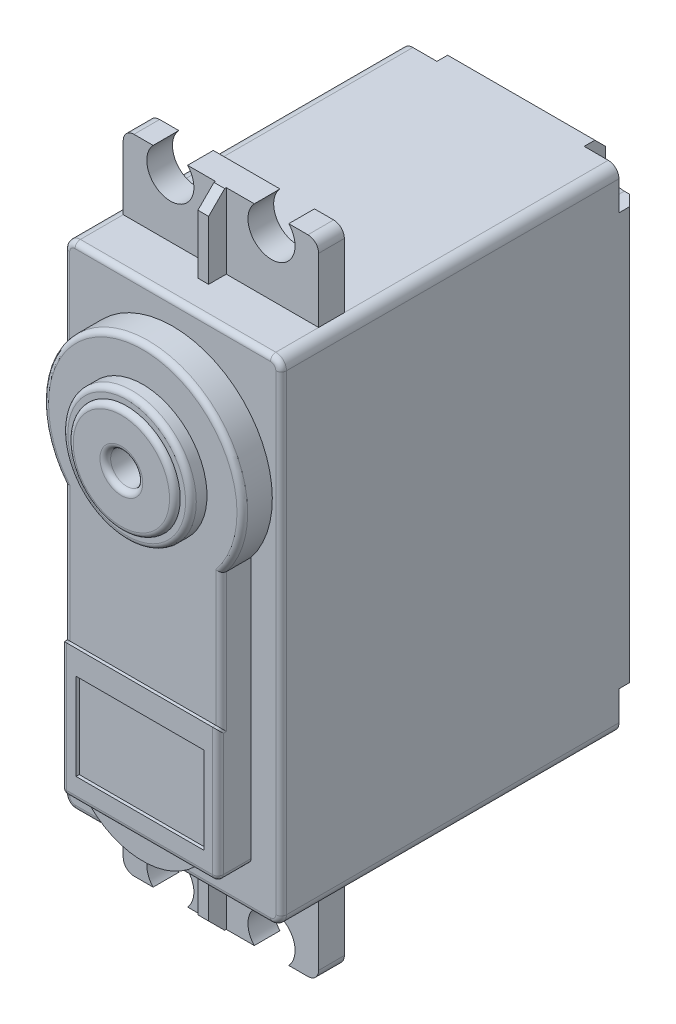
ISO-10303-21;
HEADER;
FILE_DESCRIPTION(('STEP AP214'),'2;1');
FILE_NAME('part.step','',(''),(''),'','','');
FILE_SCHEMA(('AUTOMOTIVE_DESIGN { 1 0 10303 214 1 1 1 1 }'));
ENDSEC;
DATA;
#1=APPLICATION_CONTEXT('core data for automotive mechanical design processes');
#2=APPLICATION_PROTOCOL_DEFINITION('international standard','automotive_design',2000,#1);
#3=PRODUCT_CONTEXT('',#1,'mechanical');
#4=PRODUCT('Part','Part','',(#3));
#5=PRODUCT_RELATED_PRODUCT_CATEGORY('part','',(#4));
#6=PRODUCT_DEFINITION_FORMATION('','',#4);
#7=PRODUCT_DEFINITION_CONTEXT('part definition',#1,'design');
#8=PRODUCT_DEFINITION('design','',#6,#7);
#9=PRODUCT_DEFINITION_SHAPE('','',#8);
#10=(LENGTH_UNIT() NAMED_UNIT(*) SI_UNIT(.MILLI.,.METRE.));
#11=(NAMED_UNIT(*) PLANE_ANGLE_UNIT() SI_UNIT($,.RADIAN.));
#12=(NAMED_UNIT(*) SI_UNIT($,.STERADIAN.) SOLID_ANGLE_UNIT());
#13=UNCERTAINTY_MEASURE_WITH_UNIT(LENGTH_MEASURE(1.E-05),#10,'distance_accuracy_value','');
#14=(GEOMETRIC_REPRESENTATION_CONTEXT(3) GLOBAL_UNCERTAINTY_ASSIGNED_CONTEXT((#13)) GLOBAL_UNIT_ASSIGNED_CONTEXT((#10,
#11,#12)) REPRESENTATION_CONTEXT('',''));
#15=CARTESIAN_POINT('',(0.,0.,0.));
#16=DIRECTION('',(0.,0.,1.));
#17=DIRECTION('',(1.,0.,0.));
#18=AXIS2_PLACEMENT_3D('',#15,#16,#17);
#19=CARTESIAN_POINT('',(-20.2499999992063,-14.5388888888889,31.55));
#20=DIRECTION('',(0.,1.,0.));
#21=DIRECTION('',(0.,0.,1.));
#22=AXIS2_PLACEMENT_3D('',#19,#20,#21);
#23=PLANE('',#22);
#24=DIRECTION('',(0.,0.,-1.));
#25=VECTOR('',#24,1.);
#26=CARTESIAN_POINT('',(-10.6249999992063,-14.5388888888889,28.7));
#27=LINE('',#26,#25);
#28=CARTESIAN_POINT('',(-10.6249999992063,-14.5388888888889,28.7));
#29=VERTEX_POINT('',#28);
#30=CARTESIAN_POINT('',(-10.6249999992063,-14.5388888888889,27.05));
#31=VERTEX_POINT('',#30);
#32=EDGE_CURVE('E548',#29,#31,#27,.T.);
#33=ORIENTED_EDGE('',*,*,#32,.F.);
#34=DIRECTION('',(-1.,0.,0.));
#35=VECTOR('',#34,1.);
#36=CARTESIAN_POINT('',(-10.6249999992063,-14.5388888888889,28.7));
#37=LINE('',#36,#35);
#38=CARTESIAN_POINT('',(-9.62499999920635,-14.5388888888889,28.7));
#39=VERTEX_POINT('',#38);
#40=EDGE_CURVE('E546',#39,#29,#37,.T.);
#41=ORIENTED_EDGE('',*,*,#40,.F.);
#42=DIRECTION('',(0.,0.,-1.));
#43=VECTOR('',#42,1.);
#44=CARTESIAN_POINT('',(-9.62499999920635,-14.5388888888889,28.7));
#45=LINE('',#44,#43);
#46=CARTESIAN_POINT('',(-9.62499999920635,-14.5388888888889,27.05));
#47=VERTEX_POINT('',#46);
#48=EDGE_CURVE('E544',#39,#47,#45,.T.);
#49=ORIENTED_EDGE('',*,*,#48,.T.);
#50=DIRECTION('',(-1.,0.,0.));
#51=VECTOR('',#50,1.);
#52=CARTESIAN_POINT('',(-19.2499999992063,-14.5388888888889,27.05));
#53=LINE('',#52,#51);
#54=CARTESIAN_POINT('',(-0.999999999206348,-14.5388888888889,27.05));
#55=VERTEX_POINT('',#54);
#56=EDGE_CURVE('E527',#55,#47,#53,.T.);
#57=ORIENTED_EDGE('',*,*,#56,.F.);
#58=DIRECTION('',(0.,0.,-1.));
#59=VECTOR('',#58,1.);
#60=CARTESIAN_POINT('',(-0.999999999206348,-14.5388888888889,31.55));
#61=LINE('',#60,#59);
#62=CARTESIAN_POINT('',(-0.999999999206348,-14.5388888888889,31.05));
#63=VERTEX_POINT('',#62);
#64=EDGE_CURVE('E1060',#55,#63,#61,.F.);
#65=ORIENTED_EDGE('',*,*,#64,.T.);
#66=DIRECTION('',(1.,0.,0.));
#67=VECTOR('',#66,1.);
#68=CARTESIAN_POINT('',(-19.2499999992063,-14.5388888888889,31.05));
#69=LINE('',#68,#67);
#70=CARTESIAN_POINT('',(-19.2499999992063,-14.5388888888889,31.05));
#71=VERTEX_POINT('',#70);
#72=EDGE_CURVE('E1301',#63,#71,#69,.F.);
#73=ORIENTED_EDGE('',*,*,#72,.T.);
#74=DIRECTION('',(0.,0.,-1.));
#75=VECTOR('',#74,1.);
#76=CARTESIAN_POINT('',(-19.2499999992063,-14.5388888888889,31.55));
#77=LINE('',#76,#75);
#78=CARTESIAN_POINT('',(-19.2499999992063,-14.5388888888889,27.05));
#79=VERTEX_POINT('',#78);
#80=EDGE_CURVE('E942',#71,#79,#77,.T.);
#81=ORIENTED_EDGE('',*,*,#80,.T.);
#82=EDGE_CURVE('E540',#31,#79,#53,.T.);
#83=ORIENTED_EDGE('',*,*,#82,.F.);
#84=EDGE_LOOP('',(#33,#41,#49,#57,#65,#73,#81,#83));
#85=FACE_BOUND('',#84,.T.);
#86=ADVANCED_FACE('F26',(#85),#23,.F.);
#87=CARTESIAN_POINT('',(-19.2499999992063,-21.5388888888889,27.05));
#88=DIRECTION('',(0.,0.,-1.));
#89=DIRECTION('',(-1.,0.,0.));
#90=AXIS2_PLACEMENT_3D('',#87,#88,#89);
#91=PLANE('',#90);
#92=DIRECTION('',(0.,-1.,0.));
#93=VECTOR('',#92,1.);
#94=CARTESIAN_POINT('',(-10.6249999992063,-14.5388888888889,27.05));
#95=LINE('',#94,#93);
#96=CARTESIAN_POINT('',(-10.6249999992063,-21.5388888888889,27.05));
#97=VERTEX_POINT('',#96);
#98=EDGE_CURVE('E552',#31,#97,#95,.T.);
#99=ORIENTED_EDGE('',*,*,#98,.F.);
#100=ORIENTED_EDGE('',*,*,#82,.T.);
#101=DIRECTION('',(0.,1.,0.));
#102=VECTOR('',#101,1.);
#103=CARTESIAN_POINT('',(-19.2499999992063,-21.5388888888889,27.05));
#104=LINE('',#103,#102);
#105=CARTESIAN_POINT('',(-19.2499999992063,-20.5388888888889,27.05));
#106=VERTEX_POINT('',#105);
#107=EDGE_CURVE('E628',#106,#79,#104,.T.);
#108=ORIENTED_EDGE('',*,*,#107,.F.);
#109=CARTESIAN_POINT('',(-18.2499999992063,-20.5388888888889,27.05));
#110=DIRECTION('',(0.,0.,-1.));
#111=DIRECTION('',(-1.,0.,0.));
#112=AXIS2_PLACEMENT_3D('',#109,#110,#111);
#113=CIRCLE('',#112,1.);
#114=CARTESIAN_POINT('',(-18.2499999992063,-21.5388888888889,27.05));
#115=VERTEX_POINT('',#114);
#116=EDGE_CURVE('E952',#106,#115,#113,.F.);
#117=ORIENTED_EDGE('',*,*,#116,.T.);
#118=DIRECTION('',(-1.,0.,0.));
#119=VECTOR('',#118,1.);
#120=CARTESIAN_POINT('',(-19.2499999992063,-21.5388888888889,27.05));
#121=LINE('',#120,#119);
#122=CARTESIAN_POINT('',(-16.4593476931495,-21.5388888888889,27.05));
#123=VERTEX_POINT('',#122);
#124=EDGE_CURVE('E624',#123,#115,#121,.T.);
#125=ORIENTED_EDGE('',*,*,#124,.F.);
#126=CARTESIAN_POINT('',(-14.8499999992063,-20.0388888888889,27.05));
#127=DIRECTION('',(0.,0.,-1.));
#128=DIRECTION('',(-1.,0.,0.));
#129=AXIS2_PLACEMENT_3D('',#126,#127,#128);
#130=CIRCLE('',#129,2.2);
#131=CARTESIAN_POINT('',(-13.2406523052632,-21.5388888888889,27.05));
#132=VERTEX_POINT('',#131);
#133=EDGE_CURVE('E596',#123,#132,#130,.T.);
#134=ORIENTED_EDGE('',*,*,#133,.T.);
#135=EDGE_CURVE('E630',#97,#132,#121,.T.);
#136=ORIENTED_EDGE('',*,*,#135,.F.);
#137=EDGE_LOOP('',(#99,#100,#108,#117,#125,#134,#136));
#138=FACE_BOUND('',#137,.T.);
#139=ADVANCED_FACE('F897',(#138),#91,.F.);
#140=DIRECTION('',(0.,1.,0.));
#141=VECTOR('',#140,1.);
#142=CARTESIAN_POINT('',(-9.62499999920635,-14.5388888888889,27.05));
#143=LINE('',#142,#141);
#144=CARTESIAN_POINT('',(-9.62499999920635,-21.5388888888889,27.05));
#145=VERTEX_POINT('',#144);
#146=EDGE_CURVE('E532',#145,#47,#143,.T.);
#147=ORIENTED_EDGE('',*,*,#146,.F.);
#148=CARTESIAN_POINT('',(-7.00934769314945,-21.5388888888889,27.05));
#149=VERTEX_POINT('',#148);
#150=EDGE_CURVE('E629',#149,#145,#121,.T.);
#151=ORIENTED_EDGE('',*,*,#150,.F.);
#152=CARTESIAN_POINT('',(-5.39999999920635,-20.0388888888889,27.05));
#153=DIRECTION('',(0.,0.,-1.));
#154=DIRECTION('',(-1.,0.,0.));
#155=AXIS2_PLACEMENT_3D('',#152,#153,#154);
#156=CIRCLE('',#155,2.2);
#157=CARTESIAN_POINT('',(-3.79065230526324,-21.5388888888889,27.05));
#158=VERTEX_POINT('',#157);
#159=EDGE_CURVE('E1023',#149,#158,#156,.T.);
#160=ORIENTED_EDGE('',*,*,#159,.T.);
#161=CARTESIAN_POINT('',(-1.99999999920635,-21.5388888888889,27.05));
#162=VERTEX_POINT('',#161);
#163=EDGE_CURVE('E626',#162,#158,#121,.T.);
#164=ORIENTED_EDGE('',*,*,#163,.F.);
#165=CARTESIAN_POINT('',(-1.99999999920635,-20.5388888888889,27.05));
#166=DIRECTION('',(0.,0.,-1.));
#167=DIRECTION('',(-1.,0.,0.));
#168=AXIS2_PLACEMENT_3D('',#165,#166,#167);
#169=CIRCLE('',#168,1.);
#170=CARTESIAN_POINT('',(-0.999999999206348,-20.5388888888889,27.05));
#171=VERTEX_POINT('',#170);
#172=EDGE_CURVE('E961',#162,#171,#169,.F.);
#173=ORIENTED_EDGE('',*,*,#172,.T.);
#174=DIRECTION('',(0.,1.,0.));
#175=VECTOR('',#174,1.);
#176=CARTESIAN_POINT('',(-0.999999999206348,-21.5388888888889,27.05));
#177=LINE('',#176,#175);
#178=EDGE_CURVE('E535',#171,#55,#177,.T.);
#179=ORIENTED_EDGE('',*,*,#178,.T.);
#180=ORIENTED_EDGE('',*,*,#56,.T.);
#181=EDGE_LOOP('',(#147,#151,#160,#164,#173,#179,#180));
#182=FACE_BOUND('',#181,.T.);
#183=ADVANCED_FACE('F529',(#182),#91,.F.);
#184=CARTESIAN_POINT('',(-20.2499999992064,31.4611111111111,31.55));
#185=DIRECTION('',(0.,-1.,0.));
#186=DIRECTION('',(0.,0.,-1.));
#187=AXIS2_PLACEMENT_3D('',#184,#185,#186);
#188=PLANE('',#187);
#189=DIRECTION('',(0.,0.,-1.));
#190=VECTOR('',#189,1.);
#191=CARTESIAN_POINT('',(-10.6249999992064,31.4611111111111,28.7));
#192=LINE('',#191,#190);
#193=CARTESIAN_POINT('',(-10.6249999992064,31.4611111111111,28.7));
#194=VERTEX_POINT('',#193);
#195=CARTESIAN_POINT('',(-10.6249999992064,31.4611111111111,27.05));
#196=VERTEX_POINT('',#195);
#197=EDGE_CURVE('E585',#194,#196,#192,.T.);
#198=ORIENTED_EDGE('',*,*,#197,.T.);
#199=DIRECTION('',(1.,0.,0.));
#200=VECTOR('',#199,1.);
#201=CARTESIAN_POINT('',(-0.999999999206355,31.4611111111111,27.05));
#202=LINE('',#201,#200);
#203=CARTESIAN_POINT('',(-19.2499999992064,31.4611111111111,27.05));
#204=VERTEX_POINT('',#203);
#205=EDGE_CURVE('E648',#204,#196,#202,.T.);
#206=ORIENTED_EDGE('',*,*,#205,.F.);
#207=DIRECTION('',(0.,0.,-1.));
#208=VECTOR('',#207,1.);
#209=CARTESIAN_POINT('',(-19.2499999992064,31.4611111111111,31.55));
#210=LINE('',#209,#208);
#211=CARTESIAN_POINT('',(-19.2499999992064,31.4611111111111,31.05));
#212=VERTEX_POINT('',#211);
#213=EDGE_CURVE('E1093',#204,#212,#210,.F.);
#214=ORIENTED_EDGE('',*,*,#213,.T.);
#215=DIRECTION('',(-1.,0.,0.));
#216=VECTOR('',#215,1.);
#217=CARTESIAN_POINT('',(-0.999999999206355,31.4611111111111,31.05));
#218=LINE('',#217,#216);
#219=CARTESIAN_POINT('',(-0.999999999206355,31.4611111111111,31.05));
#220=VERTEX_POINT('',#219);
#221=EDGE_CURVE('E1220',#212,#220,#218,.F.);
#222=ORIENTED_EDGE('',*,*,#221,.T.);
#223=DIRECTION('',(0.,0.,-1.));
#224=VECTOR('',#223,1.);
#225=CARTESIAN_POINT('',(-0.999999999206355,31.4611111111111,31.55));
#226=LINE('',#225,#224);
#227=CARTESIAN_POINT('',(-0.999999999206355,31.4611111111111,27.05));
#228=VERTEX_POINT('',#227);
#229=EDGE_CURVE('E1098',#220,#228,#226,.T.);
#230=ORIENTED_EDGE('',*,*,#229,.T.);
#231=CARTESIAN_POINT('',(-9.62499999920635,31.4611111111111,27.05));
#232=VERTEX_POINT('',#231);
#233=EDGE_CURVE('E647',#232,#228,#202,.T.);
#234=ORIENTED_EDGE('',*,*,#233,.F.);
#235=DIRECTION('',(0.,0.,-1.));
#236=VECTOR('',#235,1.);
#237=CARTESIAN_POINT('',(-9.62499999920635,31.4611111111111,28.7));
#238=LINE('',#237,#236);
#239=CARTESIAN_POINT('',(-9.62499999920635,31.4611111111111,28.7));
#240=VERTEX_POINT('',#239);
#241=EDGE_CURVE('E583',#240,#232,#238,.T.);
#242=ORIENTED_EDGE('',*,*,#241,.F.);
#243=DIRECTION('',(1.,0.,0.));
#244=VECTOR('',#243,1.);
#245=CARTESIAN_POINT('',(-10.6249999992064,31.4611111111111,28.7));
#246=LINE('',#245,#244);
#247=EDGE_CURVE('E574',#194,#240,#246,.T.);
#248=ORIENTED_EDGE('',*,*,#247,.F.);
#249=EDGE_LOOP('',(#198,#206,#214,#222,#230,#234,#242,#248));
#250=FACE_BOUND('',#249,.T.);
#251=ADVANCED_FACE('F917',(#250),#188,.F.);
#252=CARTESIAN_POINT('',(-0.999999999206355,38.4611111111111,27.05));
#253=DIRECTION('',(0.,0.,-1.));
#254=DIRECTION('',(-1.,0.,0.));
#255=AXIS2_PLACEMENT_3D('',#252,#253,#254);
#256=PLANE('',#255);
#257=DIRECTION('',(0.,-1.,0.));
#258=VECTOR('',#257,1.);
#259=CARTESIAN_POINT('',(-10.6249999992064,38.4611111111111,27.05));
#260=LINE('',#259,#258);
#261=CARTESIAN_POINT('',(-10.6249999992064,38.4611111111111,27.05));
#262=VERTEX_POINT('',#261);
#263=EDGE_CURVE('E567',#262,#196,#260,.T.);
#264=ORIENTED_EDGE('',*,*,#263,.F.);
#265=DIRECTION('',(1.,0.,0.));
#266=VECTOR('',#265,1.);
#267=CARTESIAN_POINT('',(-0.999999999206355,38.4611111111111,27.05));
#268=LINE('',#267,#266);
#269=CARTESIAN_POINT('',(-13.2406523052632,38.4611111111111,27.05));
#270=VERTEX_POINT('',#269);
#271=EDGE_CURVE('E659',#270,#262,#268,.T.);
#272=ORIENTED_EDGE('',*,*,#271,.F.);
#273=CARTESIAN_POINT('',(-14.8499999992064,36.9611111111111,27.05));
#274=DIRECTION('',(0.,0.,-1.));
#275=DIRECTION('',(-1.,0.,0.));
#276=AXIS2_PLACEMENT_3D('',#273,#274,#275);
#277=CIRCLE('',#276,2.2);
#278=CARTESIAN_POINT('',(-16.4593476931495,38.4611111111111,27.05));
#279=VERTEX_POINT('',#278);
#280=EDGE_CURVE('E608',#270,#279,#277,.T.);
#281=ORIENTED_EDGE('',*,*,#280,.T.);
#282=CARTESIAN_POINT('',(-18.2499999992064,38.4611111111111,27.05));
#283=VERTEX_POINT('',#282);
#284=EDGE_CURVE('E656',#283,#279,#268,.T.);
#285=ORIENTED_EDGE('',*,*,#284,.F.);
#286=CARTESIAN_POINT('',(-18.2499999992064,37.4611111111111,27.05));
#287=DIRECTION('',(0.,0.,-1.));
#288=DIRECTION('',(-1.,0.,0.));
#289=AXIS2_PLACEMENT_3D('',#286,#287,#288);
#290=CIRCLE('',#289,1.);
#291=CARTESIAN_POINT('',(-19.2499999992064,37.4611111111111,27.05));
#292=VERTEX_POINT('',#291);
#293=EDGE_CURVE('E979',#283,#292,#290,.F.);
#294=ORIENTED_EDGE('',*,*,#293,.T.);
#295=DIRECTION('',(0.,-1.,0.));
#296=VECTOR('',#295,1.);
#297=CARTESIAN_POINT('',(-19.2499999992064,38.4611111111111,27.05));
#298=LINE('',#297,#296);
#299=EDGE_CURVE('E663',#292,#204,#298,.T.);
#300=ORIENTED_EDGE('',*,*,#299,.T.);
#301=ORIENTED_EDGE('',*,*,#205,.T.);
#302=EDGE_LOOP('',(#264,#272,#281,#285,#294,#300,#301));
#303=FACE_BOUND('',#302,.T.);
#304=ADVANCED_FACE('F1563',(#303),#256,.F.);
#305=DIRECTION('',(0.,1.,0.));
#306=VECTOR('',#305,1.);
#307=CARTESIAN_POINT('',(-9.62499999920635,38.4611111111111,27.05));
#308=LINE('',#307,#306);
#309=CARTESIAN_POINT('',(-9.62499999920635,38.4611111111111,27.05));
#310=VERTEX_POINT('',#309);
#311=EDGE_CURVE('E569',#232,#310,#308,.T.);
#312=ORIENTED_EDGE('',*,*,#311,.F.);
#313=ORIENTED_EDGE('',*,*,#233,.T.);
#314=DIRECTION('',(0.,-1.,0.));
#315=VECTOR('',#314,1.);
#316=CARTESIAN_POINT('',(-0.999999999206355,38.4611111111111,27.05));
#317=LINE('',#316,#315);
#318=CARTESIAN_POINT('',(-0.999999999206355,37.4611111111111,27.05));
#319=VERTEX_POINT('',#318);
#320=EDGE_CURVE('E658',#319,#228,#317,.T.);
#321=ORIENTED_EDGE('',*,*,#320,.F.);
#322=CARTESIAN_POINT('',(-1.99999999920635,37.4611111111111,27.05));
#323=DIRECTION('',(0.,0.,-1.));
#324=DIRECTION('',(-1.,0.,0.));
#325=AXIS2_PLACEMENT_3D('',#322,#323,#324);
#326=CIRCLE('',#325,1.);
#327=CARTESIAN_POINT('',(-1.99999999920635,38.4611111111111,27.05));
#328=VERTEX_POINT('',#327);
#329=EDGE_CURVE('E981',#319,#328,#326,.F.);
#330=ORIENTED_EDGE('',*,*,#329,.T.);
#331=CARTESIAN_POINT('',(-3.79065230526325,38.4611111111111,27.05));
#332=VERTEX_POINT('',#331);
#333=EDGE_CURVE('E654',#332,#328,#268,.T.);
#334=ORIENTED_EDGE('',*,*,#333,.F.);
#335=CARTESIAN_POINT('',(-5.39999999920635,36.9611111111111,27.05));
#336=DIRECTION('',(0.,0.,-1.));
#337=DIRECTION('',(-1.,0.,0.));
#338=AXIS2_PLACEMENT_3D('',#335,#336,#337);
#339=CIRCLE('',#338,2.2);
#340=CARTESIAN_POINT('',(-7.00934769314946,38.4611111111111,27.05));
#341=VERTEX_POINT('',#340);
#342=EDGE_CURVE('E602',#332,#341,#339,.T.);
#343=ORIENTED_EDGE('',*,*,#342,.T.);
#344=EDGE_CURVE('E660',#310,#341,#268,.T.);
#345=ORIENTED_EDGE('',*,*,#344,.F.);
#346=EDGE_LOOP('',(#312,#313,#321,#330,#334,#343,#345));
#347=FACE_BOUND('',#346,.T.);
#348=ADVANCED_FACE('F1534',(#347),#256,.F.);
#349=CARTESIAN_POINT('',(-19.2499999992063,-21.5388888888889,24.65));
#350=DIRECTION('',(0.,-1.,0.));
#351=DIRECTION('',(0.,0.,-1.));
#352=AXIS2_PLACEMENT_3D('',#349,#350,#351);
#353=PLANE('',#352);
#354=DIRECTION('',(1.,0.,0.));
#355=VECTOR('',#354,1.);
#356=CARTESIAN_POINT('',(-19.2499999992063,-21.5388888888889,24.65));
#357=LINE('',#356,#355);
#358=CARTESIAN_POINT('',(-3.79065230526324,-21.5388888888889,24.65));
#359=VERTEX_POINT('',#358);
#360=CARTESIAN_POINT('',(-1.99999999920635,-21.5388888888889,24.65));
#361=VERTEX_POINT('',#360);
#362=EDGE_CURVE('E539',#359,#361,#357,.T.);
#363=ORIENTED_EDGE('',*,*,#362,.T.);
#364=DIRECTION('',(0.,0.,1.));
#365=VECTOR('',#364,1.);
#366=CARTESIAN_POINT('',(-1.99999999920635,-21.5388888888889,27.05));
#367=LINE('',#366,#365);
#368=EDGE_CURVE('E960',#361,#162,#367,.T.);
#369=ORIENTED_EDGE('',*,*,#368,.T.);
#370=ORIENTED_EDGE('',*,*,#163,.T.);
#371=DIRECTION('',(0.,0.,1.));
#372=VECTOR('',#371,1.);
#373=CARTESIAN_POINT('',(-3.79065230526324,-21.5388888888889,-2.));
#374=LINE('',#373,#372);
#375=EDGE_CURVE('E590',#359,#158,#374,.T.);
#376=ORIENTED_EDGE('',*,*,#375,.F.);
#377=EDGE_LOOP('',(#363,#369,#370,#376));
#378=FACE_BOUND('',#377,.T.);
#379=ADVANCED_FACE('F1046',(#378),#353,.T.);
#380=DIRECTION('',(0.,0.,-1.));
#381=VECTOR('',#380,1.);
#382=CARTESIAN_POINT('',(-9.62499999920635,-21.5388888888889,28.7));
#383=LINE('',#382,#381);
#384=CARTESIAN_POINT('',(-9.62499999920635,-21.5388888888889,27.2));
#385=VERTEX_POINT('',#384);
#386=EDGE_CURVE('E547',#385,#145,#383,.T.);
#387=ORIENTED_EDGE('',*,*,#386,.F.);
#388=DIRECTION('',(-1.,0.,0.));
#389=VECTOR('',#388,1.);
#390=CARTESIAN_POINT('',(-19.2499999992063,-21.5388888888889,27.2));
#391=LINE('',#390,#389);
#392=CARTESIAN_POINT('',(-10.6249999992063,-21.5388888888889,27.2));
#393=VERTEX_POINT('',#392);
#394=EDGE_CURVE('E34',#385,#393,#391,.T.);
#395=ORIENTED_EDGE('',*,*,#394,.T.);
#396=DIRECTION('',(0.,0.,-1.));
#397=VECTOR('',#396,1.);
#398=CARTESIAN_POINT('',(-10.6249999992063,-21.5388888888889,28.7));
#399=LINE('',#398,#397);
#400=EDGE_CURVE('E565',#393,#97,#399,.T.);
#401=ORIENTED_EDGE('',*,*,#400,.T.);
#402=ORIENTED_EDGE('',*,*,#135,.T.);
#403=DIRECTION('',(0.,0.,1.));
#404=VECTOR('',#403,1.);
#405=CARTESIAN_POINT('',(-13.2406523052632,-21.5388888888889,-2.));
#406=LINE('',#405,#404);
#407=CARTESIAN_POINT('',(-13.2406523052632,-21.5388888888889,24.65));
#408=VERTEX_POINT('',#407);
#409=EDGE_CURVE('E1020',#408,#132,#406,.T.);
#410=ORIENTED_EDGE('',*,*,#409,.F.);
#411=CARTESIAN_POINT('',(-7.00934769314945,-21.5388888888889,24.65));
#412=VERTEX_POINT('',#411);
#413=EDGE_CURVE('E625',#408,#412,#357,.T.);
#414=ORIENTED_EDGE('',*,*,#413,.T.);
#415=DIRECTION('',(0.,0.,1.));
#416=VECTOR('',#415,1.);
#417=CARTESIAN_POINT('',(-7.00934769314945,-21.5388888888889,-2.));
#418=LINE('',#417,#416);
#419=EDGE_CURVE('E588',#149,#412,#418,.F.);
#420=ORIENTED_EDGE('',*,*,#419,.F.);
#421=ORIENTED_EDGE('',*,*,#150,.T.);
#422=EDGE_LOOP('',(#387,#395,#401,#402,#410,#414,#420,#421));
#423=FACE_BOUND('',#422,.T.);
#424=ADVANCED_FACE('F1010',(#423),#353,.T.);
#425=CARTESIAN_POINT('',(-0.999999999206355,38.4611111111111,24.65));
#426=DIRECTION('',(0.,1.,0.));
#427=DIRECTION('',(0.,0.,1.));
#428=AXIS2_PLACEMENT_3D('',#425,#426,#427);
#429=PLANE('',#428);
#430=DIRECTION('',(0.,0.,-1.));
#431=VECTOR('',#430,1.);
#432=CARTESIAN_POINT('',(-10.6249999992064,38.4611111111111,28.7));
#433=LINE('',#432,#431);
#434=CARTESIAN_POINT('',(-10.6249999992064,38.4611111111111,27.2));
#435=VERTEX_POINT('',#434);
#436=EDGE_CURVE('E579',#435,#262,#433,.T.);
#437=ORIENTED_EDGE('',*,*,#436,.F.);
#438=DIRECTION('',(1.,0.,0.));
#439=VECTOR('',#438,1.);
#440=CARTESIAN_POINT('',(-0.999999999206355,38.4611111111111,27.2));
#441=LINE('',#440,#439);
#442=CARTESIAN_POINT('',(-9.62499999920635,38.4611111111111,27.2));
#443=VERTEX_POINT('',#442);
#444=EDGE_CURVE('E993',#435,#443,#441,.T.);
#445=ORIENTED_EDGE('',*,*,#444,.T.);
#446=DIRECTION('',(0.,0.,-1.));
#447=VECTOR('',#446,1.);
#448=CARTESIAN_POINT('',(-9.62499999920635,38.4611111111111,28.7));
#449=LINE('',#448,#447);
#450=EDGE_CURVE('E581',#443,#310,#449,.T.);
#451=ORIENTED_EDGE('',*,*,#450,.T.);
#452=ORIENTED_EDGE('',*,*,#344,.T.);
#453=DIRECTION('',(0.,0.,1.));
#454=VECTOR('',#453,1.);
#455=CARTESIAN_POINT('',(-7.00934769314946,38.4611111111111,-2.));
#456=LINE('',#455,#454);
#457=CARTESIAN_POINT('',(-7.00934769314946,38.4611111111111,24.65));
#458=VERTEX_POINT('',#457);
#459=EDGE_CURVE('E1021',#458,#341,#456,.T.);
#460=ORIENTED_EDGE('',*,*,#459,.F.);
#461=DIRECTION('',(-1.,0.,0.));
#462=VECTOR('',#461,1.);
#463=CARTESIAN_POINT('',(-0.999999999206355,38.4611111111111,24.65));
#464=LINE('',#463,#462);
#465=CARTESIAN_POINT('',(-13.2406523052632,38.4611111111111,24.65));
#466=VERTEX_POINT('',#465);
#467=EDGE_CURVE('E655',#458,#466,#464,.T.);
#468=ORIENTED_EDGE('',*,*,#467,.T.);
#469=DIRECTION('',(0.,0.,1.));
#470=VECTOR('',#469,1.);
#471=CARTESIAN_POINT('',(-13.2406523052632,38.4611111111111,-2.));
#472=LINE('',#471,#470);
#473=EDGE_CURVE('E1560',#270,#466,#472,.F.);
#474=ORIENTED_EDGE('',*,*,#473,.F.);
#475=ORIENTED_EDGE('',*,*,#271,.T.);
#476=EDGE_LOOP('',(#437,#445,#451,#452,#460,#468,#474,#475));
#477=FACE_BOUND('',#476,.T.);
#478=ADVANCED_FACE('F919',(#477),#429,.T.);
#479=CARTESIAN_POINT('',(-16.4593476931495,38.4611111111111,24.65));
#480=VERTEX_POINT('',#479);
#481=CARTESIAN_POINT('',(-18.2499999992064,38.4611111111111,24.65));
#482=VERTEX_POINT('',#481);
#483=EDGE_CURVE('E651',#480,#482,#464,.T.);
#484=ORIENTED_EDGE('',*,*,#483,.T.);
#485=DIRECTION('',(0.,0.,1.));
#486=VECTOR('',#485,1.);
#487=CARTESIAN_POINT('',(-18.2499999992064,38.4611111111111,27.05));
#488=LINE('',#487,#486);
#489=EDGE_CURVE('E983',#482,#283,#488,.T.);
#490=ORIENTED_EDGE('',*,*,#489,.T.);
#491=ORIENTED_EDGE('',*,*,#284,.T.);
#492=DIRECTION('',(0.,0.,1.));
#493=VECTOR('',#492,1.);
#494=CARTESIAN_POINT('',(-16.4593476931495,38.4611111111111,-2.));
#495=LINE('',#494,#493);
#496=EDGE_CURVE('E2134',#480,#279,#495,.T.);
#497=ORIENTED_EDGE('',*,*,#496,.F.);
#498=EDGE_LOOP('',(#484,#490,#491,#497));
#499=FACE_BOUND('',#498,.T.);
#500=ADVANCED_FACE('F908',(#499),#429,.T.);
#501=DIRECTION('',(1.,0.,0.));
#502=VECTOR('',#501,1.);
#503=CARTESIAN_POINT('',(-19.2499999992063,-14.5388888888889,24.65));
#504=LINE('',#503,#502);
#505=CARTESIAN_POINT('',(-19.2499999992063,-14.5388888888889,24.65));
#506=VERTEX_POINT('',#505);
#507=CARTESIAN_POINT('',(-0.999999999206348,-14.5388888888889,24.65));
#508=VERTEX_POINT('',#507);
#509=EDGE_CURVE('E617',#506,#508,#504,.T.);
#510=ORIENTED_EDGE('',*,*,#509,.F.);
#511=CARTESIAN_POINT('',(-19.2499999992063,-14.5388888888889,0.));
#512=VERTEX_POINT('',#511);
#513=EDGE_CURVE('E927',#506,#512,#77,.T.);
#514=ORIENTED_EDGE('',*,*,#513,.T.);
#515=DIRECTION('',(1.,0.,0.));
#516=VECTOR('',#515,1.);
#517=CARTESIAN_POINT('',(-20.2499999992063,-14.5388888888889,0.));
#518=LINE('',#517,#516);
#519=CARTESIAN_POINT('',(-16.9999999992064,-14.5388888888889,0.));
#520=VERTEX_POINT('',#519);
#521=EDGE_CURVE('E1102',#512,#520,#518,.T.);
#522=ORIENTED_EDGE('',*,*,#521,.T.);
#523=DIRECTION('',(0.,0.,1.));
#524=VECTOR('',#523,1.);
#525=CARTESIAN_POINT('',(-16.9999999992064,-14.5388888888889,-2.));
#526=LINE('',#525,#524);
#527=CARTESIAN_POINT('',(-16.9999999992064,-14.5388888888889,-0.999999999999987));
#528=VERTEX_POINT('',#527);
#529=EDGE_CURVE('E1416',#528,#520,#526,.T.);
#530=ORIENTED_EDGE('',*,*,#529,.F.);
#531=DIRECTION('',(1.,0.,0.));
#532=VECTOR('',#531,1.);
#533=CARTESIAN_POINT('',(-3.24999999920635,-14.5388888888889,-0.999999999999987));
#534=LINE('',#533,#532);
#535=CARTESIAN_POINT('',(-3.24999999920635,-14.5388888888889,-0.999999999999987));
#536=VERTEX_POINT('',#535);
#537=EDGE_CURVE('E1434',#528,#536,#534,.T.);
#538=ORIENTED_EDGE('',*,*,#537,.T.);
#539=DIRECTION('',(0.,0.,1.));
#540=VECTOR('',#539,1.);
#541=CARTESIAN_POINT('',(-3.24999999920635,-14.5388888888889,-2.));
#542=LINE('',#541,#540);
#543=CARTESIAN_POINT('',(-3.24999999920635,-14.5388888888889,0.));
#544=VERTEX_POINT('',#543);
#545=EDGE_CURVE('E1131',#536,#544,#542,.T.);
#546=ORIENTED_EDGE('',*,*,#545,.T.);
#547=CARTESIAN_POINT('',(-0.999999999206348,-14.5388888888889,0.));
#548=VERTEX_POINT('',#547);
#549=EDGE_CURVE('E1106',#544,#548,#518,.T.);
#550=ORIENTED_EDGE('',*,*,#549,.T.);
#551=EDGE_CURVE('E930',#548,#508,#61,.F.);
#552=ORIENTED_EDGE('',*,*,#551,.T.);
#553=EDGE_LOOP('',(#510,#514,#522,#530,#538,#546,#550,#552));
#554=FACE_BOUND('',#553,.T.);
#555=ADVANCED_FACE('F898',(#554),#23,.F.);
#556=DIRECTION('',(-1.,0.,0.));
#557=VECTOR('',#556,1.);
#558=CARTESIAN_POINT('',(-0.999999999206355,31.4611111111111,24.65));
#559=LINE('',#558,#557);
#560=CARTESIAN_POINT('',(-0.999999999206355,31.4611111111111,24.65));
#561=VERTEX_POINT('',#560);
#562=CARTESIAN_POINT('',(-19.2499999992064,31.4611111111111,24.65));
#563=VERTEX_POINT('',#562);
#564=EDGE_CURVE('E641',#561,#563,#559,.T.);
#565=ORIENTED_EDGE('',*,*,#564,.F.);
#566=CARTESIAN_POINT('',(-0.999999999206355,31.4611111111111,0.));
#567=VERTEX_POINT('',#566);
#568=EDGE_CURVE('E1097',#561,#567,#226,.T.);
#569=ORIENTED_EDGE('',*,*,#568,.T.);
#570=DIRECTION('',(-1.,0.,0.));
#571=VECTOR('',#570,1.);
#572=CARTESIAN_POINT('',(-20.2499999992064,31.4611111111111,0.));
#573=LINE('',#572,#571);
#574=CARTESIAN_POINT('',(-3.24999999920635,31.4611111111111,0.));
#575=VERTEX_POINT('',#574);
#576=EDGE_CURVE('E1064',#567,#575,#573,.T.);
#577=ORIENTED_EDGE('',*,*,#576,.T.);
#578=DIRECTION('',(0.,0.,1.));
#579=VECTOR('',#578,1.);
#580=CARTESIAN_POINT('',(-3.24999999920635,31.4611111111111,-2.));
#581=LINE('',#580,#579);
#582=CARTESIAN_POINT('',(-3.24999999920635,31.4611111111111,-1.));
#583=VERTEX_POINT('',#582);
#584=EDGE_CURVE('E1408',#583,#575,#581,.T.);
#585=ORIENTED_EDGE('',*,*,#584,.F.);
#586=DIRECTION('',(-1.,0.,0.));
#587=VECTOR('',#586,1.);
#588=CARTESIAN_POINT('',(-16.9999999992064,31.4611111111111,-1.));
#589=LINE('',#588,#587);
#590=CARTESIAN_POINT('',(-16.9999999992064,31.4611111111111,-1.));
#591=VERTEX_POINT('',#590);
#592=EDGE_CURVE('E1411',#583,#591,#589,.T.);
#593=ORIENTED_EDGE('',*,*,#592,.T.);
#594=DIRECTION('',(0.,0.,1.));
#595=VECTOR('',#594,1.);
#596=CARTESIAN_POINT('',(-16.9999999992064,31.4611111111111,-2.));
#597=LINE('',#596,#595);
#598=CARTESIAN_POINT('',(-16.9999999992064,31.4611111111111,0.));
#599=VERTEX_POINT('',#598);
#600=EDGE_CURVE('E1404',#591,#599,#597,.T.);
#601=ORIENTED_EDGE('',*,*,#600,.T.);
#602=CARTESIAN_POINT('',(-19.2499999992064,31.4611111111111,0.));
#603=VERTEX_POINT('',#602);
#604=EDGE_CURVE('E1067',#599,#603,#573,.T.);
#605=ORIENTED_EDGE('',*,*,#604,.T.);
#606=EDGE_CURVE('E1094',#603,#563,#210,.F.);
#607=ORIENTED_EDGE('',*,*,#606,.T.);
#608=EDGE_LOOP('',(#565,#569,#577,#585,#593,#601,#605,#607));
#609=FACE_BOUND('',#608,.T.);
#610=ADVANCED_FACE('F907',(#609),#188,.F.);
#611=CARTESIAN_POINT('',(-17.4428195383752,-10.6524468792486,34.35));
#612=DIRECTION('',(0.,1.,0.));
#613=DIRECTION('',(0.,0.,1.));
#614=AXIS2_PLACEMENT_3D('',#611,#612,#613);
#615=PLANE('',#614);
#616=DIRECTION('',(0.,0.,-1.));
#617=VECTOR('',#616,1.);
#618=CARTESIAN_POINT('',(-3.30718046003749,-10.6524468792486,34.35));
#619=LINE('',#618,#617);
#620=CARTESIAN_POINT('',(-3.30718046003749,-10.6524468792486,31.55));
#621=VERTEX_POINT('',#620);
#622=CARTESIAN_POINT('',(-3.30718046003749,-10.6524468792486,34.15));
#623=VERTEX_POINT('',#622);
#624=EDGE_CURVE('E2146',#621,#623,#619,.F.);
#625=ORIENTED_EDGE('',*,*,#624,.T.);
#626=DIRECTION('',(1.,0.,0.));
#627=VECTOR('',#626,1.);
#628=CARTESIAN_POINT('',(-17.4428195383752,-10.6524468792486,34.15));
#629=LINE('',#628,#627);
#630=CARTESIAN_POINT('',(-5.28037698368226,-10.6524468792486,34.15));
#631=VERTEX_POINT('',#630);
#632=EDGE_CURVE('E2149',#623,#631,#629,.F.);
#633=ORIENTED_EDGE('',*,*,#632,.T.);
#634=DIRECTION('',(0.,0.,-1.));
#635=VECTOR('',#634,1.);
#636=CARTESIAN_POINT('',(-5.28037698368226,-10.6524468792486,34.35));
#637=LINE('',#636,#635);
#638=CARTESIAN_POINT('',(-5.28037698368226,-10.6524468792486,31.55));
#639=VERTEX_POINT('',#638);
#640=EDGE_CURVE('E1185',#631,#639,#637,.T.);
#641=ORIENTED_EDGE('',*,*,#640,.T.);
#642=DIRECTION('',(1.,0.,0.));
#643=VECTOR('',#642,1.);
#644=CARTESIAN_POINT('',(-5.28037698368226,-10.6524468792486,31.55));
#645=LINE('',#644,#643);
#646=EDGE_CURVE('E1327',#639,#621,#645,.T.);
#647=ORIENTED_EDGE('',*,*,#646,.T.);
#648=EDGE_LOOP('',(#625,#633,#641,#647));
#649=FACE_BOUND('',#648,.T.);
#650=ADVANCED_FACE('F786',(#649),#615,.F.);
#651=CARTESIAN_POINT('',(-10.1249999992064,19.9510847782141,35.85));
#652=DIRECTION('',(0.,0.,1.));
#653=DIRECTION('',(1.,0.,0.));
#654=AXIS2_PLACEMENT_3D('',#651,#652,#653);
#655=PLANE('',#654);
#656=CARTESIAN_POINT('',(-10.1249999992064,19.9510847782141,35.85));
#657=DIRECTION('',(0.,0.,1.));
#658=DIRECTION('',(1.,0.,0.));
#659=AXIS2_PLACEMENT_3D('',#656,#657,#658);
#660=CIRCLE('',#659,5.5);
#661=CARTESIAN_POINT('',(-4.62499999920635,19.9510847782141,35.85));
#662=VERTEX_POINT('',#661);
#663=EDGE_CURVE('E1167',#662,#662,#660,.T.);
#664=ORIENTED_EDGE('',*,*,#663,.T.);
#665=EDGE_LOOP('',(#664));
#666=FACE_BOUND('',#665,.T.);
#667=CARTESIAN_POINT('',(-10.1249999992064,19.9510847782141,35.85));
#668=DIRECTION('',(0.,0.,1.));
#669=DIRECTION('',(1.,0.,0.));
#670=AXIS2_PLACEMENT_3D('',#667,#668,#669);
#671=CIRCLE('',#670,5.);
#672=CARTESIAN_POINT('',(-5.12499999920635,19.9510847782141,35.85));
#673=VERTEX_POINT('',#672);
#674=EDGE_CURVE('E1244',#673,#673,#671,.T.);
#675=ORIENTED_EDGE('',*,*,#674,.F.);
#676=EDGE_LOOP('',(#675));
#677=FACE_BOUND('',#676,.T.);
#678=ADVANCED_FACE('F782',(#666,#677),#655,.T.);
#679=CARTESIAN_POINT('',(-10.1249999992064,19.9510847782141,34.35));
#680=DIRECTION('',(0.,0.,-1.));
#681=DIRECTION('',(-1.,0.,0.));
#682=AXIS2_PLACEMENT_3D('',#679,#680,#681);
#683=PLANE('',#682);
#684=DIRECTION('',(-1.,0.,0.));
#685=VECTOR('',#684,1.);
#686=CARTESIAN_POINT('',(-17.4428195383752,1.77967100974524,34.35));
#687=LINE('',#686,#685);
#688=CARTESIAN_POINT('',(-3.3071804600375,1.77967100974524,34.35));
#689=VERTEX_POINT('',#688);
#690=CARTESIAN_POINT('',(-16.9428195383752,1.77967100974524,34.35));
#691=VERTEX_POINT('',#690);
#692=EDGE_CURVE('E1273',#689,#691,#687,.T.);
#693=ORIENTED_EDGE('',*,*,#692,.F.);
#694=DIRECTION('',(0.,1.,0.));
#695=VECTOR('',#694,1.);
#696=CARTESIAN_POINT('',(-3.3071804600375,19.9510847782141,34.35));
#697=LINE('',#696,#695);
#698=CARTESIAN_POINT('',(-3.3071804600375,14.3871530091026,34.35));
#699=VERTEX_POINT('',#698);
#700=EDGE_CURVE('E1294',#689,#699,#697,.T.);
#701=ORIENTED_EDGE('',*,*,#700,.T.);
#702=CARTESIAN_POINT('',(-10.1249999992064,19.9510847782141,34.35));
#703=DIRECTION('',(0.,0.,-1.));
#704=DIRECTION('',(-1.,0.,0.));
#705=AXIS2_PLACEMENT_3D('',#702,#703,#704);
#706=CIRCLE('',#705,8.8);
#707=CARTESIAN_POINT('',(-16.9428195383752,14.3871530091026,34.35));
#708=VERTEX_POINT('',#707);
#709=EDGE_CURVE('E1292',#699,#708,#706,.F.);
#710=ORIENTED_EDGE('',*,*,#709,.T.);
#711=DIRECTION('',(0.,-1.,0.));
#712=VECTOR('',#711,1.);
#713=CARTESIAN_POINT('',(-16.9428195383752,19.9510847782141,34.35));
#714=LINE('',#713,#712);
#715=EDGE_CURVE('E1290',#708,#691,#714,.T.);
#716=ORIENTED_EDGE('',*,*,#715,.T.);
#717=EDGE_LOOP('',(#693,#701,#710,#716));
#718=FACE_BOUND('',#717,.T.);
#719=CARTESIAN_POINT('',(-10.1249999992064,19.9510847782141,34.35));
#720=DIRECTION('',(0.,0.,-1.));
#721=DIRECTION('',(-1.,0.,0.));
#722=AXIS2_PLACEMENT_3D('',#719,#720,#721);
#723=CIRCLE('',#722,6.);
#724=CARTESIAN_POINT('',(-16.1249999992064,19.9510847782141,34.35));
#725=VERTEX_POINT('',#724);
#726=EDGE_CURVE('E1192',#725,#725,#723,.F.);
#727=ORIENTED_EDGE('',*,*,#726,.F.);
#728=EDGE_LOOP('',(#727));
#729=FACE_BOUND('',#728,.T.);
#730=ADVANCED_FACE('F785',(#718,#729),#683,.F.);
#731=CARTESIAN_POINT('',(-10.1249999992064,-5.65502573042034,34.35));
#732=DIRECTION('',(0.,0.,1.));
#733=DIRECTION('',(1.,0.,0.));
#734=AXIS2_PLACEMENT_3D('',#731,#732,#733);
#735=CIRCLE('',#734,6.9602148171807);
#736=CARTESIAN_POINT('',(-15.0123140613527,-10.6107044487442,34.35));
#737=VERTEX_POINT('',#736);
#738=CARTESIAN_POINT('',(-5.23768593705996,-10.6107044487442,34.35));
#739=VERTEX_POINT('',#738);
#740=EDGE_CURVE('E1308',#737,#739,#735,.T.);
#741=ORIENTED_EDGE('',*,*,#740,.T.);
#742=DIRECTION('',(1.,0.,0.));
#743=VECTOR('',#742,1.);
#744=CARTESIAN_POINT('',(-5.23768593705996,-10.6107044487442,34.35));
#745=LINE('',#744,#743);
#746=EDGE_CURVE('E854',#739,#737,#745,.F.);
#747=ORIENTED_EDGE('',*,*,#746,.T.);
#748=EDGE_LOOP('',(#741,#747));
#749=FACE_BOUND('',#748,.T.);
#750=ADVANCED_FACE('F822',(#749),#683,.F.);
#751=CARTESIAN_POINT('',(-20.2499999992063,-14.5388888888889,31.55));
#752=DIRECTION('',(0.,0.,1.));
#753=DIRECTION('',(1.,0.,0.));
#754=AXIS2_PLACEMENT_3D('',#751,#752,#753);
#755=PLANE('',#754);
#756=DIRECTION('',(0.,-1.,0.));
#757=VECTOR('',#756,1.);
#758=CARTESIAN_POINT('',(-19.7499999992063,-13.5388888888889,31.55));
#759=LINE('',#758,#757);
#760=CARTESIAN_POINT('',(-19.7499999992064,30.4611111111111,31.55));
#761=VERTEX_POINT('',#760);
#762=CARTESIAN_POINT('',(-19.7499999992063,-13.5388888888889,31.55));
#763=VERTEX_POINT('',#762);
#764=EDGE_CURVE('E1207',#761,#763,#759,.T.);
#765=ORIENTED_EDGE('',*,*,#764,.T.);
#766=CARTESIAN_POINT('',(-19.2499999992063,-13.5388888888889,31.55));
#767=DIRECTION('',(0.,0.,1.));
#768=DIRECTION('',(1.,0.,0.));
#769=AXIS2_PLACEMENT_3D('',#766,#767,#768);
#770=CIRCLE('',#769,0.5);
#771=CARTESIAN_POINT('',(-19.2499999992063,-14.0388888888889,31.55));
#772=VERTEX_POINT('',#771);
#773=EDGE_CURVE('E1209',#763,#772,#770,.T.);
#774=ORIENTED_EDGE('',*,*,#773,.T.);
#775=DIRECTION('',(1.,0.,0.));
#776=VECTOR('',#775,1.);
#777=CARTESIAN_POINT('',(-0.999999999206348,-14.0388888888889,31.55));
#778=LINE('',#777,#776);
#779=CARTESIAN_POINT('',(-0.999999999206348,-14.0388888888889,31.55));
#780=VERTEX_POINT('',#779);
#781=EDGE_CURVE('E1195',#772,#780,#778,.T.);
#782=ORIENTED_EDGE('',*,*,#781,.T.);
#783=CARTESIAN_POINT('',(-0.999999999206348,-13.5388888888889,31.55));
#784=DIRECTION('',(0.,0.,1.));
#785=DIRECTION('',(1.,0.,0.));
#786=AXIS2_PLACEMENT_3D('',#783,#784,#785);
#787=CIRCLE('',#786,0.5);
#788=CARTESIAN_POINT('',(-0.499999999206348,-13.5388888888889,31.55));
#789=VERTEX_POINT('',#788);
#790=EDGE_CURVE('E1198',#780,#789,#787,.T.);
#791=ORIENTED_EDGE('',*,*,#790,.T.);
#792=DIRECTION('',(0.,1.,0.));
#793=VECTOR('',#792,1.);
#794=CARTESIAN_POINT('',(-0.499999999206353,30.4611111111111,31.55));
#795=LINE('',#794,#793);
#796=CARTESIAN_POINT('',(-0.499999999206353,30.4611111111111,31.55));
#797=VERTEX_POINT('',#796);
#798=EDGE_CURVE('E1145',#789,#797,#795,.T.);
#799=ORIENTED_EDGE('',*,*,#798,.T.);
#800=CARTESIAN_POINT('',(-0.999999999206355,30.4611111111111,31.55));
#801=DIRECTION('',(0.,0.,1.));
#802=DIRECTION('',(1.,0.,0.));
#803=AXIS2_PLACEMENT_3D('',#800,#801,#802);
#804=CIRCLE('',#803,0.5);
#805=CARTESIAN_POINT('',(-0.999999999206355,30.9611111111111,31.55));
#806=VERTEX_POINT('',#805);
#807=EDGE_CURVE('E1201',#797,#806,#804,.T.);
#808=ORIENTED_EDGE('',*,*,#807,.T.);
#809=DIRECTION('',(-1.,0.,0.));
#810=VECTOR('',#809,1.);
#811=CARTESIAN_POINT('',(-19.2499999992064,30.9611111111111,31.55));
#812=LINE('',#811,#810);
#813=CARTESIAN_POINT('',(-19.2499999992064,30.9611111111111,31.55));
#814=VERTEX_POINT('',#813);
#815=EDGE_CURVE('E1203',#806,#814,#812,.T.);
#816=ORIENTED_EDGE('',*,*,#815,.T.);
#817=CARTESIAN_POINT('',(-19.2499999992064,30.4611111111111,31.55));
#818=DIRECTION('',(0.,0.,1.));
#819=DIRECTION('',(1.,0.,0.));
#820=AXIS2_PLACEMENT_3D('',#817,#818,#819);
#821=CIRCLE('',#820,0.5);
#822=EDGE_CURVE('E1205',#814,#761,#821,.T.);
#823=ORIENTED_EDGE('',*,*,#822,.T.);
#824=EDGE_LOOP('',(#765,#774,#782,#791,#799,#808,#816,#823));
#825=FACE_BOUND('',#824,.T.);
#826=DIRECTION('',(1.,0.,0.));
#827=VECTOR('',#826,1.);
#828=CARTESIAN_POINT('',(-17.4428195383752,-10.6524468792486,31.55));
#829=LINE('',#828,#827);
#830=CARTESIAN_POINT('',(-16.9428195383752,-10.6524468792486,31.55));
#831=VERTEX_POINT('',#830);
#832=CARTESIAN_POINT('',(-14.9696230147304,-10.6524468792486,31.55));
#833=VERTEX_POINT('',#832);
#834=EDGE_CURVE('E1317',#831,#833,#829,.T.);
#835=ORIENTED_EDGE('',*,*,#834,.F.);
#836=CARTESIAN_POINT('',(-16.9428195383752,-10.1524468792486,31.55));
#837=DIRECTION('',(0.,0.,1.));
#838=DIRECTION('',(1.,0.,0.));
#839=AXIS2_PLACEMENT_3D('',#836,#837,#838);
#840=CIRCLE('',#839,0.5);
#841=CARTESIAN_POINT('',(-17.4428195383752,-10.1524468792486,31.55));
#842=VERTEX_POINT('',#841);
#843=EDGE_CURVE('E2135',#831,#842,#840,.F.);
#844=ORIENTED_EDGE('',*,*,#843,.T.);
#845=DIRECTION('',(0.,-1.,0.));
#846=VECTOR('',#845,1.);
#847=CARTESIAN_POINT('',(-17.4428195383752,-10.6524468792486,31.55));
#848=LINE('',#847,#846);
#849=CARTESIAN_POINT('',(-17.4428195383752,14.2117888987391,31.55));
#850=VERTEX_POINT('',#849);
#851=EDGE_CURVE('E1322',#850,#842,#848,.T.);
#852=ORIENTED_EDGE('',*,*,#851,.F.);
#853=CARTESIAN_POINT('',(-10.1249999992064,19.9510847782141,31.55));
#854=DIRECTION('',(0.,0.,1.));
#855=DIRECTION('',(-1.,0.,0.));
#856=AXIS2_PLACEMENT_3D('',#853,#854,#855);
#857=CIRCLE('',#856,9.3);
#858=CARTESIAN_POINT('',(-2.8071804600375,14.2117888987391,31.55));
#859=VERTEX_POINT('',#858);
#860=EDGE_CURVE('E1334',#859,#850,#857,.T.);
#861=ORIENTED_EDGE('',*,*,#860,.F.);
#862=DIRECTION('',(0.,1.,0.));
#863=VECTOR('',#862,1.);
#864=CARTESIAN_POINT('',(-2.80718046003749,-10.6524468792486,31.55));
#865=LINE('',#864,#863);
#866=CARTESIAN_POINT('',(-2.80718046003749,-10.1524468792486,31.55));
#867=VERTEX_POINT('',#866);
#868=EDGE_CURVE('E1329',#867,#859,#865,.T.);
#869=ORIENTED_EDGE('',*,*,#868,.F.);
#870=CARTESIAN_POINT('',(-3.30718046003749,-10.1524468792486,31.55));
#871=DIRECTION('',(0.,0.,1.));
#872=DIRECTION('',(1.,0.,0.));
#873=AXIS2_PLACEMENT_3D('',#870,#871,#872);
#874=CIRCLE('',#873,0.5);
#875=EDGE_CURVE('E853',#867,#621,#874,.F.);
#876=ORIENTED_EDGE('',*,*,#875,.T.);
#877=ORIENTED_EDGE('',*,*,#646,.F.);
#878=CARTESIAN_POINT('',(-10.1249999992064,-5.65502573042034,31.55));
#879=DIRECTION('',(0.,0.,1.));
#880=DIRECTION('',(1.,0.,0.));
#881=AXIS2_PLACEMENT_3D('',#878,#879,#880);
#882=CIRCLE('',#881,6.9602148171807);
#883=EDGE_CURVE('E1321',#833,#639,#882,.T.);
#884=ORIENTED_EDGE('',*,*,#883,.F.);
#885=EDGE_LOOP('',(#835,#844,#852,#861,#869,#876,#877,#884));
#886=FACE_BOUND('',#885,.T.);
#887=ADVANCED_FACE('F1325',(#825,#886),#755,.T.);
#888=CARTESIAN_POINT('',(-20.2499999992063,-14.5388888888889,0.));
#889=DIRECTION('',(0.,0.,1.));
#890=DIRECTION('',(1.,0.,0.));
#891=AXIS2_PLACEMENT_3D('',#888,#889,#890);
#892=PLANE('',#891);
#893=DIRECTION('',(0.,1.,0.));
#894=VECTOR('',#893,1.);
#895=CARTESIAN_POINT('',(-16.9999999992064,31.4611111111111,0.));
#896=LINE('',#895,#894);
#897=CARTESIAN_POINT('',(-16.9999999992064,29.4611111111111,0.));
#898=VERTEX_POINT('',#897);
#899=EDGE_CURVE('E1392',#898,#599,#896,.T.);
#900=ORIENTED_EDGE('',*,*,#899,.F.);
#901=CARTESIAN_POINT('',(-18.7499999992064,29.4611111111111,0.));
#902=DIRECTION('',(0.,0.,1.));
#903=DIRECTION('',(-1.,0.,0.));
#904=AXIS2_PLACEMENT_3D('',#901,#902,#903);
#905=CIRCLE('',#904,1.75);
#906=CARTESIAN_POINT('',(-18.7499999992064,27.7111111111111,0.));
#907=VERTEX_POINT('',#906);
#908=EDGE_CURVE('E1389',#907,#898,#905,.T.);
#909=ORIENTED_EDGE('',*,*,#908,.F.);
#910=DIRECTION('',(1.,0.,0.));
#911=VECTOR('',#910,1.);
#912=CARTESIAN_POINT('',(-18.7499999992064,27.7111111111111,0.));
#913=LINE('',#912,#911);
#914=CARTESIAN_POINT('',(-20.2499999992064,27.7111111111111,0.));
#915=VERTEX_POINT('',#914);
#916=EDGE_CURVE('E1382',#915,#907,#913,.T.);
#917=ORIENTED_EDGE('',*,*,#916,.F.);
#918=DIRECTION('',(0.,-1.,0.));
#919=VECTOR('',#918,1.);
#920=CARTESIAN_POINT('',(-20.2499999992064,31.4611111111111,0.));
#921=LINE('',#920,#919);
#922=CARTESIAN_POINT('',(-20.2499999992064,30.4611111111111,0.));
#923=VERTEX_POINT('',#922);
#924=EDGE_CURVE('E1123',#923,#915,#921,.T.);
#925=ORIENTED_EDGE('',*,*,#924,.F.);
#926=CARTESIAN_POINT('',(-19.2499999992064,30.4611111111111,0.));
#927=DIRECTION('',(0.,0.,1.));
#928=DIRECTION('',(1.,0.,0.));
#929=AXIS2_PLACEMENT_3D('',#926,#927,#928);
#930=CIRCLE('',#929,1.);
#931=EDGE_CURVE('E1073',#923,#603,#930,.F.);
#932=ORIENTED_EDGE('',*,*,#931,.T.);
#933=ORIENTED_EDGE('',*,*,#604,.F.);
#934=EDGE_LOOP('',(#900,#909,#917,#925,#932,#933));
#935=FACE_BOUND('',#934,.T.);
#936=ADVANCED_FACE('F1704',(#935),#892,.F.);
#937=DIRECTION('',(-1.,0.,0.));
#938=VECTOR('',#937,1.);
#939=CARTESIAN_POINT('',(-20.2499999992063,-10.7888888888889,0.));
#940=LINE('',#939,#938);
#941=CARTESIAN_POINT('',(-18.7499999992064,-10.7888888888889,0.));
#942=VERTEX_POINT('',#941);
#943=CARTESIAN_POINT('',(-20.2499999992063,-10.7888888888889,0.));
#944=VERTEX_POINT('',#943);
#945=EDGE_CURVE('E1378',#942,#944,#940,.T.);
#946=ORIENTED_EDGE('',*,*,#945,.F.);
#947=CARTESIAN_POINT('',(-18.7499999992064,-12.5388888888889,0.));
#948=DIRECTION('',(0.,0.,1.));
#949=DIRECTION('',(-1.,0.,0.));
#950=AXIS2_PLACEMENT_3D('',#947,#948,#949);
#951=CIRCLE('',#950,1.75);
#952=CARTESIAN_POINT('',(-16.9999999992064,-12.5388888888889,0.));
#953=VERTEX_POINT('',#952);
#954=EDGE_CURVE('E1383',#953,#942,#951,.T.);
#955=ORIENTED_EDGE('',*,*,#954,.F.);
#956=DIRECTION('',(0.,1.,0.));
#957=VECTOR('',#956,1.);
#958=CARTESIAN_POINT('',(-16.9999999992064,-12.5388888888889,0.));
#959=LINE('',#958,#957);
#960=EDGE_CURVE('E1427',#520,#953,#959,.T.);
#961=ORIENTED_EDGE('',*,*,#960,.F.);
#962=ORIENTED_EDGE('',*,*,#521,.F.);
#963=CARTESIAN_POINT('',(-19.2499999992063,-13.5388888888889,0.));
#964=DIRECTION('',(0.,0.,1.));
#965=DIRECTION('',(1.,0.,0.));
#966=AXIS2_PLACEMENT_3D('',#963,#964,#965);
#967=CIRCLE('',#966,1.);
#968=CARTESIAN_POINT('',(-20.2499999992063,-13.5388888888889,0.));
#969=VERTEX_POINT('',#968);
#970=EDGE_CURVE('E940',#512,#969,#967,.F.);
#971=ORIENTED_EDGE('',*,*,#970,.T.);
#972=EDGE_CURVE('E1122',#944,#969,#921,.T.);
#973=ORIENTED_EDGE('',*,*,#972,.F.);
#974=EDGE_LOOP('',(#946,#955,#961,#962,#971,#973));
#975=FACE_BOUND('',#974,.T.);
#976=ADVANCED_FACE('F1709',(#975),#892,.F.);
#977=DIRECTION('',(0.,-1.,0.));
#978=VECTOR('',#977,1.);
#979=CARTESIAN_POINT('',(-3.24999999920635,-14.5388888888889,0.));
#980=LINE('',#979,#978);
#981=CARTESIAN_POINT('',(-3.24999999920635,-12.5388888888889,0.));
#982=VERTEX_POINT('',#981);
#983=EDGE_CURVE('E1425',#982,#544,#980,.T.);
#984=ORIENTED_EDGE('',*,*,#983,.F.);
#985=CARTESIAN_POINT('',(-1.49999999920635,-12.5388888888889,0.));
#986=DIRECTION('',(0.,0.,1.));
#987=DIRECTION('',(-1.,0.,0.));
#988=AXIS2_PLACEMENT_3D('',#985,#986,#987);
#989=CIRCLE('',#988,1.75);
#990=CARTESIAN_POINT('',(-1.49999999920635,-10.7888888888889,0.));
#991=VERTEX_POINT('',#990);
#992=EDGE_CURVE('E1346',#991,#982,#989,.T.);
#993=ORIENTED_EDGE('',*,*,#992,.F.);
#994=DIRECTION('',(-1.,0.,0.));
#995=VECTOR('',#994,1.);
#996=CARTESIAN_POINT('',(-1.49999999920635,-10.7888888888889,0.));
#997=LINE('',#996,#995);
#998=CARTESIAN_POINT('',(7.9365157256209E-10,-10.7888888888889,0.));
#999=VERTEX_POINT('',#998);
#1000=EDGE_CURVE('E1350',#999,#991,#997,.T.);
#1001=ORIENTED_EDGE('',*,*,#1000,.F.);
#1002=DIRECTION('',(0.,1.,0.));
#1003=VECTOR('',#1002,1.);
#1004=CARTESIAN_POINT('',(7.93646398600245E-10,31.4611111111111,0.));
#1005=LINE('',#1004,#1003);
#1006=CARTESIAN_POINT('',(7.93651909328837E-10,-13.5388888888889,0.));
#1007=VERTEX_POINT('',#1006);
#1008=EDGE_CURVE('E1118',#1007,#999,#1005,.T.);
#1009=ORIENTED_EDGE('',*,*,#1008,.F.);
#1010=CARTESIAN_POINT('',(-0.999999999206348,-13.5388888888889,0.));
#1011=DIRECTION('',(0.,0.,1.));
#1012=DIRECTION('',(1.,0.,0.));
#1013=AXIS2_PLACEMENT_3D('',#1010,#1011,#1012);
#1014=CIRCLE('',#1013,1.);
#1015=EDGE_CURVE('E1079',#1007,#548,#1014,.F.);
#1016=ORIENTED_EDGE('',*,*,#1015,.T.);
#1017=ORIENTED_EDGE('',*,*,#549,.F.);
#1018=EDGE_LOOP('',(#984,#993,#1001,#1009,#1016,#1017));
#1019=FACE_BOUND('',#1018,.T.);
#1020=ADVANCED_FACE('F1135',(#1019),#892,.F.);
#1021=DIRECTION('',(0.,-1.,0.));
#1022=VECTOR('',#1021,1.);
#1023=CARTESIAN_POINT('',(-3.24999999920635,29.4611111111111,0.));
#1024=LINE('',#1023,#1022);
#1025=CARTESIAN_POINT('',(-3.24999999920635,29.4611111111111,0.));
#1026=VERTEX_POINT('',#1025);
#1027=EDGE_CURVE('E1353',#575,#1026,#1024,.T.);
#1028=ORIENTED_EDGE('',*,*,#1027,.F.);
#1029=ORIENTED_EDGE('',*,*,#576,.F.);
#1030=CARTESIAN_POINT('',(-0.999999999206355,30.4611111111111,0.));
#1031=DIRECTION('',(0.,0.,1.));
#1032=DIRECTION('',(1.,0.,0.));
#1033=AXIS2_PLACEMENT_3D('',#1030,#1031,#1032);
#1034=CIRCLE('',#1033,1.);
#1035=CARTESIAN_POINT('',(7.9364652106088E-10,30.4611111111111,0.));
#1036=VERTEX_POINT('',#1035);
#1037=EDGE_CURVE('E1076',#567,#1036,#1034,.F.);
#1038=ORIENTED_EDGE('',*,*,#1037,.T.);
#1039=CARTESIAN_POINT('',(7.93646858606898E-10,27.7111111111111,0.));
#1040=VERTEX_POINT('',#1039);
#1041=EDGE_CURVE('E1105',#1040,#1036,#1005,.T.);
#1042=ORIENTED_EDGE('',*,*,#1041,.F.);
#1043=DIRECTION('',(1.,0.,0.));
#1044=VECTOR('',#1043,1.);
#1045=CARTESIAN_POINT('',(7.93646858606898E-10,27.7111111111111,0.));
#1046=LINE('',#1045,#1044);
#1047=CARTESIAN_POINT('',(-1.49999999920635,27.7111111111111,0.));
#1048=VERTEX_POINT('',#1047);
#1049=EDGE_CURVE('E1343',#1048,#1040,#1046,.T.);
#1050=ORIENTED_EDGE('',*,*,#1049,.F.);
#1051=CARTESIAN_POINT('',(-1.49999999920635,29.4611111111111,0.));
#1052=DIRECTION('',(0.,0.,1.));
#1053=DIRECTION('',(-1.,0.,0.));
#1054=AXIS2_PLACEMENT_3D('',#1051,#1052,#1053);
#1055=CIRCLE('',#1054,1.75);
#1056=EDGE_CURVE('E1184',#1026,#1048,#1055,.T.);
#1057=ORIENTED_EDGE('',*,*,#1056,.F.);
#1058=EDGE_LOOP('',(#1028,#1029,#1038,#1042,#1050,#1057));
#1059=FACE_BOUND('',#1058,.T.);
#1060=ADVANCED_FACE('F1489',(#1059),#892,.F.);
#1061=CARTESIAN_POINT('',(-20.2499999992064,31.4611111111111,31.55));
#1062=DIRECTION('',(1.,0.,0.));
#1063=DIRECTION('',(0.,1.,0.));
#1064=AXIS2_PLACEMENT_3D('',#1061,#1062,#1063);
#1065=PLANE('',#1064);
#1066=DIRECTION('',(0.,0.,-1.));
#1067=VECTOR('',#1066,1.);
#1068=CARTESIAN_POINT('',(-20.2499999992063,-13.5388888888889,31.55));
#1069=LINE('',#1068,#1067);
#1070=CARTESIAN_POINT('',(-20.2499999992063,-13.5388888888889,31.05));
#1071=VERTEX_POINT('',#1070);
#1072=EDGE_CURVE('E1085',#969,#1071,#1069,.F.);
#1073=ORIENTED_EDGE('',*,*,#1072,.T.);
#1074=DIRECTION('',(0.,-1.,0.));
#1075=VECTOR('',#1074,1.);
#1076=CARTESIAN_POINT('',(-20.2499999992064,30.4611111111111,31.05));
#1077=LINE('',#1076,#1075);
#1078=CARTESIAN_POINT('',(-20.2499999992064,30.4611111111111,31.05));
#1079=VERTEX_POINT('',#1078);
#1080=EDGE_CURVE('E1215',#1071,#1079,#1077,.F.);
#1081=ORIENTED_EDGE('',*,*,#1080,.T.);
#1082=DIRECTION('',(0.,0.,-1.));
#1083=VECTOR('',#1082,1.);
#1084=CARTESIAN_POINT('',(-20.2499999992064,30.4611111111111,31.55));
#1085=LINE('',#1084,#1083);
#1086=EDGE_CURVE('E1083',#1079,#923,#1085,.T.);
#1087=ORIENTED_EDGE('',*,*,#1086,.T.);
#1088=ORIENTED_EDGE('',*,*,#924,.T.);
#1089=DIRECTION('',(0.,0.,1.));
#1090=VECTOR('',#1089,1.);
#1091=CARTESIAN_POINT('',(-20.2499999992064,27.7111111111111,-2.));
#1092=LINE('',#1091,#1090);
#1093=CARTESIAN_POINT('',(-20.2499999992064,27.7111111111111,-0.999999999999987));
#1094=VERTEX_POINT('',#1093);
#1095=EDGE_CURVE('E1367',#1094,#915,#1092,.T.);
#1096=ORIENTED_EDGE('',*,*,#1095,.F.);
#1097=DIRECTION('',(0.,-1.,0.));
#1098=VECTOR('',#1097,1.);
#1099=CARTESIAN_POINT('',(-20.2499999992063,-10.7888888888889,-0.999999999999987));
#1100=LINE('',#1099,#1098);
#1101=CARTESIAN_POINT('',(-20.2499999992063,-10.7888888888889,-0.999999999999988));
#1102=VERTEX_POINT('',#1101);
#1103=EDGE_CURVE('E2091',#1094,#1102,#1100,.T.);
#1104=ORIENTED_EDGE('',*,*,#1103,.T.);
#1105=DIRECTION('',(0.,0.,1.));
#1106=VECTOR('',#1105,1.);
#1107=CARTESIAN_POINT('',(-20.2499999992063,-10.7888888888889,-2.));
#1108=LINE('',#1107,#1106);
#1109=EDGE_CURVE('E1370',#1102,#944,#1108,.T.);
#1110=ORIENTED_EDGE('',*,*,#1109,.T.);
#1111=ORIENTED_EDGE('',*,*,#972,.T.);
#1112=EDGE_LOOP('',(#1073,#1081,#1087,#1088,#1096,#1104,#1110,#1111));
#1113=FACE_BOUND('',#1112,.T.);
#1114=ADVANCED_FACE('F28',(#1113),#1065,.F.);
#1115=CARTESIAN_POINT('',(7.93646398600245E-10,31.4611111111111,31.55));
#1116=DIRECTION('',(-1.,0.,0.));
#1117=DIRECTION('',(0.,-1.,0.));
#1118=AXIS2_PLACEMENT_3D('',#1115,#1116,#1117);
#1119=PLANE('',#1118);
#1120=DIRECTION('',(0.,0.,-1.));
#1121=VECTOR('',#1120,1.);
#1122=CARTESIAN_POINT('',(7.9364652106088E-10,30.4611111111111,31.55));
#1123=LINE('',#1122,#1121);
#1124=CARTESIAN_POINT('',(7.9364652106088E-10,30.4611111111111,31.05));
#1125=VERTEX_POINT('',#1124);
#1126=EDGE_CURVE('E1088',#1036,#1125,#1123,.F.);
#1127=ORIENTED_EDGE('',*,*,#1126,.T.);
#1128=DIRECTION('',(0.,1.,0.));
#1129=VECTOR('',#1128,1.);
#1130=CARTESIAN_POINT('',(7.93651909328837E-10,-13.5388888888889,31.05));
#1131=LINE('',#1130,#1129);
#1132=CARTESIAN_POINT('',(7.93651909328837E-10,-13.5388888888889,31.05));
#1133=VERTEX_POINT('',#1132);
#1134=EDGE_CURVE('E1144',#1125,#1133,#1131,.F.);
#1135=ORIENTED_EDGE('',*,*,#1134,.T.);
#1136=DIRECTION('',(0.,0.,-1.));
#1137=VECTOR('',#1136,1.);
#1138=CARTESIAN_POINT('',(7.93651909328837E-10,-13.5388888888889,31.55));
#1139=LINE('',#1138,#1137);
#1140=EDGE_CURVE('E1091',#1133,#1007,#1139,.T.);
#1141=ORIENTED_EDGE('',*,*,#1140,.T.);
#1142=ORIENTED_EDGE('',*,*,#1008,.T.);
#1143=DIRECTION('',(0.,0.,1.));
#1144=VECTOR('',#1143,1.);
#1145=CARTESIAN_POINT('',(7.93651479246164E-10,-10.7888888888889,-2.));
#1146=LINE('',#1145,#1144);
#1147=CARTESIAN_POINT('',(7.93651479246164E-10,-10.7888888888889,-0.999999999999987));
#1148=VERTEX_POINT('',#1147);
#1149=EDGE_CURVE('E1359',#1148,#999,#1146,.T.);
#1150=ORIENTED_EDGE('',*,*,#1149,.F.);
#1151=DIRECTION('',(0.,1.,0.));
#1152=VECTOR('',#1151,1.);
#1153=CARTESIAN_POINT('',(7.93646857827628E-10,27.7111111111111,-0.999999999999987));
#1154=LINE('',#1153,#1152);
#1155=CARTESIAN_POINT('',(7.93646845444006E-10,27.7111111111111,-0.999999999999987));
#1156=VERTEX_POINT('',#1155);
#1157=EDGE_CURVE('E1362',#1148,#1156,#1154,.T.);
#1158=ORIENTED_EDGE('',*,*,#1157,.T.);
#1159=DIRECTION('',(0.,0.,1.));
#1160=VECTOR('',#1159,1.);
#1161=CARTESIAN_POINT('',(7.93646858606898E-10,27.7111111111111,-2.));
#1162=LINE('',#1161,#1160);
#1163=EDGE_CURVE('E1356',#1156,#1040,#1162,.T.);
#1164=ORIENTED_EDGE('',*,*,#1163,.T.);
#1165=ORIENTED_EDGE('',*,*,#1041,.T.);
#1166=EDGE_LOOP('',(#1127,#1135,#1141,#1142,#1150,#1158,#1164,#1165));
#1167=FACE_BOUND('',#1166,.T.);
#1168=ADVANCED_FACE('F1231',(#1167),#1119,.F.);
#1169=CARTESIAN_POINT('',(-19.2499999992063,-13.5388888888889,31.55));
#1170=DIRECTION('',(0.,0.,-1.));
#1171=DIRECTION('',(-1.,0.,0.));
#1172=AXIS2_PLACEMENT_3D('',#1169,#1170,#1171);
#1173=CYLINDRICAL_SURFACE('',#1172,1.);
#1174=ORIENTED_EDGE('',*,*,#80,.F.);
#1175=CARTESIAN_POINT('',(-19.2499999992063,-13.5388888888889,31.05));
#1176=DIRECTION('',(0.,0.,1.));
#1177=DIRECTION('',(1.,0.,0.));
#1178=AXIS2_PLACEMENT_3D('',#1175,#1176,#1177);
#1179=CIRCLE('',#1178,1.);
#1180=EDGE_CURVE('E1212',#71,#1071,#1179,.F.);
#1181=ORIENTED_EDGE('',*,*,#1180,.T.);
#1182=ORIENTED_EDGE('',*,*,#1072,.F.);
#1183=ORIENTED_EDGE('',*,*,#970,.F.);
#1184=ORIENTED_EDGE('',*,*,#513,.F.);
#1185=DIRECTION('',(0.,0.,-1.));
#1186=VECTOR('',#1185,1.);
#1187=CARTESIAN_POINT('',(-19.2499999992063,-14.5388888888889,27.05));
#1188=LINE('',#1187,#1186);
#1189=EDGE_CURVE('E614',#79,#506,#1188,.T.);
#1190=ORIENTED_EDGE('',*,*,#1189,.F.);
#1191=EDGE_LOOP('',(#1174,#1181,#1182,#1183,#1184,#1190));
#1192=FACE_BOUND('',#1191,.T.);
#1193=ADVANCED_FACE('F936',(#1192),#1173,.T.);
#1194=CARTESIAN_POINT('',(-0.999999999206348,-13.5388888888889,31.55));
#1195=DIRECTION('',(0.,0.,-1.));
#1196=DIRECTION('',(-1.,0.,0.));
#1197=AXIS2_PLACEMENT_3D('',#1194,#1195,#1196);
#1198=CYLINDRICAL_SURFACE('',#1197,1.);
#1199=ORIENTED_EDGE('',*,*,#1140,.F.);
#1200=CARTESIAN_POINT('',(-0.999999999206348,-13.5388888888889,31.05));
#1201=DIRECTION('',(0.,0.,1.));
#1202=DIRECTION('',(1.,0.,0.));
#1203=AXIS2_PLACEMENT_3D('',#1200,#1201,#1202);
#1204=CIRCLE('',#1203,1.);
#1205=EDGE_CURVE('E1062',#1133,#63,#1204,.F.);
#1206=ORIENTED_EDGE('',*,*,#1205,.T.);
#1207=ORIENTED_EDGE('',*,*,#64,.F.);
#1208=DIRECTION('',(0.,0.,1.));
#1209=VECTOR('',#1208,1.);
#1210=CARTESIAN_POINT('',(-0.999999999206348,-14.5388888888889,27.05));
#1211=LINE('',#1210,#1209);
#1212=EDGE_CURVE('E620',#508,#55,#1211,.T.);
#1213=ORIENTED_EDGE('',*,*,#1212,.F.);
#1214=ORIENTED_EDGE('',*,*,#551,.F.);
#1215=ORIENTED_EDGE('',*,*,#1015,.F.);
#1216=EDGE_LOOP('',(#1199,#1206,#1207,#1213,#1214,#1215));
#1217=FACE_BOUND('',#1216,.T.);
#1218=ADVANCED_FACE('F1057',(#1217),#1198,.T.);
#1219=CARTESIAN_POINT('',(-0.999999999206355,30.4611111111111,31.55));
#1220=DIRECTION('',(0.,0.,-1.));
#1221=DIRECTION('',(-1.,0.,0.));
#1222=AXIS2_PLACEMENT_3D('',#1219,#1220,#1221);
#1223=CYLINDRICAL_SURFACE('',#1222,1.);
#1224=ORIENTED_EDGE('',*,*,#229,.F.);
#1225=CARTESIAN_POINT('',(-0.999999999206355,30.4611111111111,31.05));
#1226=DIRECTION('',(0.,0.,1.));
#1227=DIRECTION('',(1.,0.,0.));
#1228=AXIS2_PLACEMENT_3D('',#1225,#1226,#1227);
#1229=CIRCLE('',#1228,1.);
#1230=EDGE_CURVE('E1158',#220,#1125,#1229,.F.);
#1231=ORIENTED_EDGE('',*,*,#1230,.T.);
#1232=ORIENTED_EDGE('',*,*,#1126,.F.);
#1233=ORIENTED_EDGE('',*,*,#1037,.F.);
#1234=ORIENTED_EDGE('',*,*,#568,.F.);
#1235=DIRECTION('',(0.,0.,-1.));
#1236=VECTOR('',#1235,1.);
#1237=CARTESIAN_POINT('',(-0.999999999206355,31.4611111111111,27.05));
#1238=LINE('',#1237,#1236);
#1239=EDGE_CURVE('E638',#228,#561,#1238,.T.);
#1240=ORIENTED_EDGE('',*,*,#1239,.F.);
#1241=EDGE_LOOP('',(#1224,#1231,#1232,#1233,#1234,#1240));
#1242=FACE_BOUND('',#1241,.T.);
#1243=ADVANCED_FACE('F1225',(#1242),#1223,.T.);
#1244=CARTESIAN_POINT('',(-19.2499999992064,30.4611111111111,31.55));
#1245=DIRECTION('',(0.,0.,-1.));
#1246=DIRECTION('',(-1.,0.,0.));
#1247=AXIS2_PLACEMENT_3D('',#1244,#1245,#1246);
#1248=CYLINDRICAL_SURFACE('',#1247,1.);
#1249=ORIENTED_EDGE('',*,*,#1086,.F.);
#1250=CARTESIAN_POINT('',(-19.2499999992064,30.4611111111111,31.05));
#1251=DIRECTION('',(0.,0.,1.));
#1252=DIRECTION('',(1.,0.,0.));
#1253=AXIS2_PLACEMENT_3D('',#1250,#1251,#1252);
#1254=CIRCLE('',#1253,1.);
#1255=EDGE_CURVE('E1217',#1079,#212,#1254,.F.);
#1256=ORIENTED_EDGE('',*,*,#1255,.T.);
#1257=ORIENTED_EDGE('',*,*,#213,.F.);
#1258=DIRECTION('',(0.,0.,1.));
#1259=VECTOR('',#1258,1.);
#1260=CARTESIAN_POINT('',(-19.2499999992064,31.4611111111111,27.05));
#1261=LINE('',#1260,#1259);
#1262=EDGE_CURVE('E644',#563,#204,#1261,.T.);
#1263=ORIENTED_EDGE('',*,*,#1262,.F.);
#1264=ORIENTED_EDGE('',*,*,#606,.F.);
#1265=ORIENTED_EDGE('',*,*,#931,.F.);
#1266=EDGE_LOOP('',(#1249,#1256,#1257,#1263,#1264,#1265));
#1267=FACE_BOUND('',#1266,.T.);
#1268=ADVANCED_FACE('F1730',(#1267),#1248,.T.);
#1269=CARTESIAN_POINT('',(-1.49999999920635,29.4611111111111,-2.));
#1270=DIRECTION('',(0.,0.,1.));
#1271=DIRECTION('',(1.,0.,0.));
#1272=AXIS2_PLACEMENT_3D('',#1269,#1270,#1271);
#1273=CYLINDRICAL_SURFACE('',#1272,1.75);
#1274=ORIENTED_EDGE('',*,*,#1056,.T.);
#1275=DIRECTION('',(0.,0.,1.));
#1276=VECTOR('',#1275,1.);
#1277=CARTESIAN_POINT('',(-1.49999999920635,27.7111111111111,-2.));
#1278=LINE('',#1277,#1276);
#1279=CARTESIAN_POINT('',(-1.49999999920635,27.7111111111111,-2.));
#1280=VERTEX_POINT('',#1279);
#1281=EDGE_CURVE('E1124',#1280,#1048,#1278,.T.);
#1282=ORIENTED_EDGE('',*,*,#1281,.F.);
#1283=CARTESIAN_POINT('',(-1.49999999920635,29.4611111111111,-2.));
#1284=DIRECTION('',(0.,0.,1.));
#1285=DIRECTION('',(-1.,0.,0.));
#1286=AXIS2_PLACEMENT_3D('',#1283,#1284,#1285);
#1287=CIRCLE('',#1286,1.75);
#1288=CARTESIAN_POINT('',(-3.24999999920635,29.4611111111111,-2.));
#1289=VERTEX_POINT('',#1288);
#1290=EDGE_CURVE('E1395',#1289,#1280,#1287,.T.);
#1291=ORIENTED_EDGE('',*,*,#1290,.F.);
#1292=DIRECTION('',(0.,0.,1.));
#1293=VECTOR('',#1292,1.);
#1294=CARTESIAN_POINT('',(-3.24999999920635,29.4611111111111,-2.));
#1295=LINE('',#1294,#1293);
#1296=EDGE_CURVE('E1452',#1289,#1026,#1295,.T.);
#1297=ORIENTED_EDGE('',*,*,#1296,.T.);
#1298=EDGE_LOOP('',(#1274,#1282,#1291,#1297));
#1299=FACE_BOUND('',#1298,.T.);
#1300=ADVANCED_FACE('F1487',(#1299),#1273,.F.);
#1301=CARTESIAN_POINT('',(7.93646858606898E-10,27.7111111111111,-2.));
#1302=DIRECTION('',(0.,-1.,0.));
#1303=DIRECTION('',(0.,0.,-1.));
#1304=AXIS2_PLACEMENT_3D('',#1301,#1302,#1303);
#1305=PLANE('',#1304);
#1306=ORIENTED_EDGE('',*,*,#1163,.F.);
#1307=DIRECTION('',(-0.707106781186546,0.,-0.707106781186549));
#1308=VECTOR('',#1307,1.);
#1309=CARTESIAN_POINT('',(-0.999999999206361,27.7111111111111,-2.));
#1310=LINE('',#1309,#1308);
#1311=CARTESIAN_POINT('',(-0.999999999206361,27.7111111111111,-2.));
#1312=VERTEX_POINT('',#1311);
#1313=EDGE_CURVE('E1364',#1156,#1312,#1310,.T.);
#1314=ORIENTED_EDGE('',*,*,#1313,.T.);
#1315=DIRECTION('',(1.,0.,0.));
#1316=VECTOR('',#1315,1.);
#1317=CARTESIAN_POINT('',(7.93646858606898E-10,27.7111111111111,-2.));
#1318=LINE('',#1317,#1316);
#1319=EDGE_CURVE('E1485',#1280,#1312,#1318,.T.);
#1320=ORIENTED_EDGE('',*,*,#1319,.F.);
#1321=ORIENTED_EDGE('',*,*,#1281,.T.);
#1322=ORIENTED_EDGE('',*,*,#1049,.T.);
#1323=EDGE_LOOP('',(#1306,#1314,#1320,#1321,#1322));
#1324=FACE_BOUND('',#1323,.T.);
#1325=ADVANCED_FACE('F1483',(#1324),#1305,.F.);
#1326=CARTESIAN_POINT('',(-1.49999999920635,-10.7888888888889,-2.));
#1327=DIRECTION('',(0.,1.,0.));
#1328=DIRECTION('',(0.,0.,1.));
#1329=AXIS2_PLACEMENT_3D('',#1326,#1327,#1328);
#1330=PLANE('',#1329);
#1331=DIRECTION('',(-1.,0.,0.));
#1332=VECTOR('',#1331,1.);
#1333=CARTESIAN_POINT('',(-1.49999999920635,-10.7888888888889,-2.));
#1334=LINE('',#1333,#1332);
#1335=CARTESIAN_POINT('',(-0.999999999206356,-10.7888888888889,-2.));
#1336=VERTEX_POINT('',#1335);
#1337=CARTESIAN_POINT('',(-1.49999999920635,-10.7888888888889,-2.));
#1338=VERTEX_POINT('',#1337);
#1339=EDGE_CURVE('E1494',#1336,#1338,#1334,.T.);
#1340=ORIENTED_EDGE('',*,*,#1339,.F.);
#1341=DIRECTION('',(0.707106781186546,0.,0.707106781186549));
#1342=VECTOR('',#1341,1.);
#1343=CARTESIAN_POINT('',(-0.999999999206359,-10.7888888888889,-2.));
#1344=LINE('',#1343,#1342);
#1345=EDGE_CURVE('E1360',#1336,#1148,#1344,.T.);
#1346=ORIENTED_EDGE('',*,*,#1345,.T.);
#1347=ORIENTED_EDGE('',*,*,#1149,.T.);
#1348=ORIENTED_EDGE('',*,*,#1000,.T.);
#1349=DIRECTION('',(0.,0.,1.));
#1350=VECTOR('',#1349,1.);
#1351=CARTESIAN_POINT('',(-1.49999999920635,-10.7888888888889,-2.));
#1352=LINE('',#1351,#1350);
#1353=EDGE_CURVE('E1438',#1338,#991,#1352,.T.);
#1354=ORIENTED_EDGE('',*,*,#1353,.F.);
#1355=EDGE_LOOP('',(#1340,#1346,#1347,#1348,#1354));
#1356=FACE_BOUND('',#1355,.T.);
#1357=ADVANCED_FACE('F2032',(#1356),#1330,.F.);
#1358=CARTESIAN_POINT('',(-1.49999999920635,-12.5388888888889,-2.));
#1359=DIRECTION('',(0.,0.,1.));
#1360=DIRECTION('',(1.,0.,0.));
#1361=AXIS2_PLACEMENT_3D('',#1358,#1359,#1360);
#1362=CYLINDRICAL_SURFACE('',#1361,1.75);
#1363=ORIENTED_EDGE('',*,*,#992,.T.);
#1364=DIRECTION('',(0.,0.,1.));
#1365=VECTOR('',#1364,1.);
#1366=CARTESIAN_POINT('',(-3.24999999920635,-12.5388888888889,-2.));
#1367=LINE('',#1366,#1365);
#1368=CARTESIAN_POINT('',(-3.24999999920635,-12.5388888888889,-2.));
#1369=VERTEX_POINT('',#1368);
#1370=EDGE_CURVE('E1433',#1369,#982,#1367,.T.);
#1371=ORIENTED_EDGE('',*,*,#1370,.F.);
#1372=CARTESIAN_POINT('',(-1.49999999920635,-12.5388888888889,-2.));
#1373=DIRECTION('',(0.,0.,1.));
#1374=DIRECTION('',(-1.,0.,0.));
#1375=AXIS2_PLACEMENT_3D('',#1372,#1373,#1374);
#1376=CIRCLE('',#1375,1.75);
#1377=EDGE_CURVE('E1496',#1338,#1369,#1376,.T.);
#1378=ORIENTED_EDGE('',*,*,#1377,.F.);
#1379=ORIENTED_EDGE('',*,*,#1353,.T.);
#1380=EDGE_LOOP('',(#1363,#1371,#1378,#1379));
#1381=FACE_BOUND('',#1380,.T.);
#1382=ADVANCED_FACE('F2026',(#1381),#1362,.F.);
#1383=CARTESIAN_POINT('',(-3.24999999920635,-14.5388888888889,-2.));
#1384=DIRECTION('',(-1.,0.,0.));
#1385=DIRECTION('',(0.,-1.,0.));
#1386=AXIS2_PLACEMENT_3D('',#1383,#1384,#1385);
#1387=PLANE('',#1386);
#1388=ORIENTED_EDGE('',*,*,#545,.F.);
#1389=DIRECTION('',(0.,0.707106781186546,-0.707106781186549));
#1390=VECTOR('',#1389,1.);
#1391=CARTESIAN_POINT('',(-3.24999999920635,-13.5388888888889,-2.));
#1392=LINE('',#1391,#1390);
#1393=CARTESIAN_POINT('',(-3.24999999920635,-13.5388888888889,-2.));
#1394=VERTEX_POINT('',#1393);
#1395=EDGE_CURVE('E1436',#536,#1394,#1392,.T.);
#1396=ORIENTED_EDGE('',*,*,#1395,.T.);
#1397=DIRECTION('',(0.,-1.,0.));
#1398=VECTOR('',#1397,1.);
#1399=CARTESIAN_POINT('',(-3.24999999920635,-14.5388888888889,-2.));
#1400=LINE('',#1399,#1398);
#1401=EDGE_CURVE('E1500',#1369,#1394,#1400,.T.);
#1402=ORIENTED_EDGE('',*,*,#1401,.F.);
#1403=ORIENTED_EDGE('',*,*,#1370,.T.);
#1404=ORIENTED_EDGE('',*,*,#983,.T.);
#1405=EDGE_LOOP('',(#1388,#1396,#1402,#1403,#1404));
#1406=FACE_BOUND('',#1405,.T.);
#1407=ADVANCED_FACE('F2018',(#1406),#1387,.F.);
#1408=CARTESIAN_POINT('',(-16.9999999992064,-12.5388888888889,-2.));
#1409=DIRECTION('',(1.,0.,0.));
#1410=DIRECTION('',(0.,0.,-1.));
#1411=AXIS2_PLACEMENT_3D('',#1408,#1409,#1410);
#1412=PLANE('',#1411);
#1413=DIRECTION('',(0.,1.,0.));
#1414=VECTOR('',#1413,1.);
#1415=CARTESIAN_POINT('',(-16.9999999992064,-12.5388888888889,-2.));
#1416=LINE('',#1415,#1414);
#1417=CARTESIAN_POINT('',(-16.9999999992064,-13.5388888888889,-2.));
#1418=VERTEX_POINT('',#1417);
#1419=CARTESIAN_POINT('',(-16.9999999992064,-12.5388888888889,-2.));
#1420=VERTEX_POINT('',#1419);
#1421=EDGE_CURVE('E1503',#1418,#1420,#1416,.T.);
#1422=ORIENTED_EDGE('',*,*,#1421,.F.);
#1423=DIRECTION('',(0.,-0.707106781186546,0.707106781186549));
#1424=VECTOR('',#1423,1.);
#1425=CARTESIAN_POINT('',(-16.9999999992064,-13.5388888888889,-2.));
#1426=LINE('',#1425,#1424);
#1427=EDGE_CURVE('E1415',#1418,#528,#1426,.T.);
#1428=ORIENTED_EDGE('',*,*,#1427,.T.);
#1429=ORIENTED_EDGE('',*,*,#529,.T.);
#1430=ORIENTED_EDGE('',*,*,#960,.T.);
#1431=DIRECTION('',(0.,0.,1.));
#1432=VECTOR('',#1431,1.);
#1433=CARTESIAN_POINT('',(-16.9999999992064,-12.5388888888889,-2.));
#1434=LINE('',#1433,#1432);
#1435=EDGE_CURVE('E1419',#1420,#953,#1434,.T.);
#1436=ORIENTED_EDGE('',*,*,#1435,.F.);
#1437=EDGE_LOOP('',(#1422,#1428,#1429,#1430,#1436));
#1438=FACE_BOUND('',#1437,.T.);
#1439=ADVANCED_FACE('F2014',(#1438),#1412,.F.);
#1440=CARTESIAN_POINT('',(-18.7499999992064,-12.5388888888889,-2.));
#1441=DIRECTION('',(0.,0.,1.));
#1442=DIRECTION('',(1.,0.,0.));
#1443=AXIS2_PLACEMENT_3D('',#1440,#1441,#1442);
#1444=CYLINDRICAL_SURFACE('',#1443,1.75);
#1445=ORIENTED_EDGE('',*,*,#954,.T.);
#1446=DIRECTION('',(0.,0.,1.));
#1447=VECTOR('',#1446,1.);
#1448=CARTESIAN_POINT('',(-18.7499999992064,-10.7888888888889,-2.));
#1449=LINE('',#1448,#1447);
#1450=CARTESIAN_POINT('',(-18.7499999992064,-10.7888888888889,-2.));
#1451=VERTEX_POINT('',#1450);
#1452=EDGE_CURVE('E1471',#1451,#942,#1449,.T.);
#1453=ORIENTED_EDGE('',*,*,#1452,.F.);
#1454=CARTESIAN_POINT('',(-18.7499999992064,-12.5388888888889,-2.));
#1455=DIRECTION('',(0.,0.,1.));
#1456=DIRECTION('',(-1.,0.,0.));
#1457=AXIS2_PLACEMENT_3D('',#1454,#1455,#1456);
#1458=CIRCLE('',#1457,1.75);
#1459=EDGE_CURVE('E1505',#1420,#1451,#1458,.T.);
#1460=ORIENTED_EDGE('',*,*,#1459,.F.);
#1461=ORIENTED_EDGE('',*,*,#1435,.T.);
#1462=EDGE_LOOP('',(#1445,#1453,#1460,#1461));
#1463=FACE_BOUND('',#1462,.T.);
#1464=ADVANCED_FACE('F2008',(#1463),#1444,.F.);
#1465=CARTESIAN_POINT('',(-20.2499999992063,-10.7888888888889,-2.));
#1466=DIRECTION('',(0.,1.,0.));
#1467=DIRECTION('',(-1.,0.,0.));
#1468=AXIS2_PLACEMENT_3D('',#1465,#1466,#1467);
#1469=PLANE('',#1468);
#1470=ORIENTED_EDGE('',*,*,#1109,.F.);
#1471=DIRECTION('',(0.707106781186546,0.,-0.707106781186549));
#1472=VECTOR('',#1471,1.);
#1473=CARTESIAN_POINT('',(-19.2499999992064,-10.7888888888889,-1.99999999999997));
#1474=LINE('',#1473,#1472);
#1475=CARTESIAN_POINT('',(-19.2499999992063,-10.7888888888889,-2.));
#1476=VERTEX_POINT('',#1475);
#1477=EDGE_CURVE('E1196',#1102,#1476,#1474,.T.);
#1478=ORIENTED_EDGE('',*,*,#1477,.T.);
#1479=DIRECTION('',(-1.,0.,0.));
#1480=VECTOR('',#1479,1.);
#1481=CARTESIAN_POINT('',(-20.2499999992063,-10.7888888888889,-2.));
#1482=LINE('',#1481,#1480);
#1483=EDGE_CURVE('E1507',#1451,#1476,#1482,.T.);
#1484=ORIENTED_EDGE('',*,*,#1483,.F.);
#1485=ORIENTED_EDGE('',*,*,#1452,.T.);
#1486=ORIENTED_EDGE('',*,*,#945,.T.);
#1487=EDGE_LOOP('',(#1470,#1478,#1484,#1485,#1486));
#1488=FACE_BOUND('',#1487,.T.);
#1489=ADVANCED_FACE('F2000',(#1488),#1469,.F.);
#1490=CARTESIAN_POINT('',(-18.7499999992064,27.7111111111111,-2.));
#1491=DIRECTION('',(0.,-1.,0.));
#1492=DIRECTION('',(0.,0.,-1.));
#1493=AXIS2_PLACEMENT_3D('',#1490,#1491,#1492);
#1494=PLANE('',#1493);
#1495=DIRECTION('',(1.,0.,0.));
#1496=VECTOR('',#1495,1.);
#1497=CARTESIAN_POINT('',(-18.7499999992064,27.7111111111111,-2.));
#1498=LINE('',#1497,#1496);
#1499=CARTESIAN_POINT('',(-19.2499999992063,27.7111111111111,-2.));
#1500=VERTEX_POINT('',#1499);
#1501=CARTESIAN_POINT('',(-18.7499999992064,27.7111111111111,-2.));
#1502=VERTEX_POINT('',#1501);
#1503=EDGE_CURVE('E1510',#1500,#1502,#1498,.T.);
#1504=ORIENTED_EDGE('',*,*,#1503,.F.);
#1505=DIRECTION('',(-0.707106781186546,0.,0.707106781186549));
#1506=VECTOR('',#1505,1.);
#1507=CARTESIAN_POINT('',(-19.2499999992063,27.7111111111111,-2.));
#1508=LINE('',#1507,#1506);
#1509=EDGE_CURVE('E1366',#1500,#1094,#1508,.T.);
#1510=ORIENTED_EDGE('',*,*,#1509,.T.);
#1511=ORIENTED_EDGE('',*,*,#1095,.T.);
#1512=ORIENTED_EDGE('',*,*,#916,.T.);
#1513=DIRECTION('',(0.,0.,1.));
#1514=VECTOR('',#1513,1.);
#1515=CARTESIAN_POINT('',(-18.7499999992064,27.7111111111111,-2.));
#1516=LINE('',#1515,#1514);
#1517=EDGE_CURVE('E1371',#1502,#907,#1516,.T.);
#1518=ORIENTED_EDGE('',*,*,#1517,.F.);
#1519=EDGE_LOOP('',(#1504,#1510,#1511,#1512,#1518));
#1520=FACE_BOUND('',#1519,.T.);
#1521=ADVANCED_FACE('F1996',(#1520),#1494,.F.);
#1522=CARTESIAN_POINT('',(-18.7499999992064,29.4611111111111,-2.));
#1523=DIRECTION('',(0.,0.,1.));
#1524=DIRECTION('',(1.,0.,0.));
#1525=AXIS2_PLACEMENT_3D('',#1522,#1523,#1524);
#1526=CYLINDRICAL_SURFACE('',#1525,1.75);
#1527=ORIENTED_EDGE('',*,*,#908,.T.);
#1528=DIRECTION('',(0.,0.,1.));
#1529=VECTOR('',#1528,1.);
#1530=CARTESIAN_POINT('',(-16.9999999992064,29.4611111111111,-2.));
#1531=LINE('',#1530,#1529);
#1532=CARTESIAN_POINT('',(-16.9999999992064,29.4611111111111,-2.));
#1533=VERTEX_POINT('',#1532);
#1534=EDGE_CURVE('E1407',#1533,#898,#1531,.T.);
#1535=ORIENTED_EDGE('',*,*,#1534,.F.);
#1536=CARTESIAN_POINT('',(-18.7499999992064,29.4611111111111,-2.));
#1537=DIRECTION('',(0.,0.,1.));
#1538=DIRECTION('',(-1.,0.,0.));
#1539=AXIS2_PLACEMENT_3D('',#1536,#1537,#1538);
#1540=CIRCLE('',#1539,1.75);
#1541=EDGE_CURVE('E1512',#1502,#1533,#1540,.T.);
#1542=ORIENTED_EDGE('',*,*,#1541,.F.);
#1543=ORIENTED_EDGE('',*,*,#1517,.T.);
#1544=EDGE_LOOP('',(#1527,#1535,#1542,#1543));
#1545=FACE_BOUND('',#1544,.T.);
#1546=ADVANCED_FACE('F1991',(#1545),#1526,.F.);
#1547=CARTESIAN_POINT('',(-16.9999999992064,31.4611111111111,-2.));
#1548=DIRECTION('',(1.,0.,0.));
#1549=DIRECTION('',(0.,0.,-1.));
#1550=AXIS2_PLACEMENT_3D('',#1547,#1548,#1549);
#1551=PLANE('',#1550);
#1552=ORIENTED_EDGE('',*,*,#600,.F.);
#1553=DIRECTION('',(0.,-0.707106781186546,-0.707106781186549));
#1554=VECTOR('',#1553,1.);
#1555=CARTESIAN_POINT('',(-16.9999999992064,30.4611111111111,-2.));
#1556=LINE('',#1555,#1554);
#1557=CARTESIAN_POINT('',(-16.9999999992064,30.4611111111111,-2.));
#1558=VERTEX_POINT('',#1557);
#1559=EDGE_CURVE('E1413',#591,#1558,#1556,.T.);
#1560=ORIENTED_EDGE('',*,*,#1559,.T.);
#1561=DIRECTION('',(0.,1.,0.));
#1562=VECTOR('',#1561,1.);
#1563=CARTESIAN_POINT('',(-16.9999999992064,31.4611111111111,-2.));
#1564=LINE('',#1563,#1562);
#1565=EDGE_CURVE('E1463',#1533,#1558,#1564,.T.);
#1566=ORIENTED_EDGE('',*,*,#1565,.F.);
#1567=ORIENTED_EDGE('',*,*,#1534,.T.);
#1568=ORIENTED_EDGE('',*,*,#899,.T.);
#1569=EDGE_LOOP('',(#1552,#1560,#1566,#1567,#1568));
#1570=FACE_BOUND('',#1569,.T.);
#1571=ADVANCED_FACE('F1984',(#1570),#1551,.F.);
#1572=CARTESIAN_POINT('',(-3.24999999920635,29.4611111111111,-2.));
#1573=DIRECTION('',(-1.,0.,0.));
#1574=DIRECTION('',(0.,0.,1.));
#1575=AXIS2_PLACEMENT_3D('',#1572,#1573,#1574);
#1576=PLANE('',#1575);
#1577=DIRECTION('',(0.,-1.,0.));
#1578=VECTOR('',#1577,1.);
#1579=CARTESIAN_POINT('',(-3.24999999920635,29.4611111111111,-2.));
#1580=LINE('',#1579,#1578);
#1581=CARTESIAN_POINT('',(-3.24999999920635,30.4611111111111,-2.));
#1582=VERTEX_POINT('',#1581);
#1583=EDGE_CURVE('E1458',#1582,#1289,#1580,.T.);
#1584=ORIENTED_EDGE('',*,*,#1583,.F.);
#1585=DIRECTION('',(0.,0.707106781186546,0.707106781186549));
#1586=VECTOR('',#1585,1.);
#1587=CARTESIAN_POINT('',(-3.24999999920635,30.4611111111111,-2.));
#1588=LINE('',#1587,#1586);
#1589=EDGE_CURVE('E1409',#1582,#583,#1588,.T.);
#1590=ORIENTED_EDGE('',*,*,#1589,.T.);
#1591=ORIENTED_EDGE('',*,*,#584,.T.);
#1592=ORIENTED_EDGE('',*,*,#1027,.T.);
#1593=ORIENTED_EDGE('',*,*,#1296,.F.);
#1594=EDGE_LOOP('',(#1584,#1590,#1591,#1592,#1593));
#1595=FACE_BOUND('',#1594,.T.);
#1596=ADVANCED_FACE('F1492',(#1595),#1576,.F.);
#1597=CARTESIAN_POINT('',(-1.49999999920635,29.4611111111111,-2.));
#1598=DIRECTION('',(0.,0.,-1.));
#1599=DIRECTION('',(-1.,0.,0.));
#1600=AXIS2_PLACEMENT_3D('',#1597,#1598,#1599);
#1601=PLANE('',#1600);
#1602=ORIENTED_EDGE('',*,*,#1565,.T.);
#1603=DIRECTION('',(1.,0.,0.));
#1604=VECTOR('',#1603,1.);
#1605=CARTESIAN_POINT('',(-3.24999999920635,30.4611111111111,-2.));
#1606=LINE('',#1605,#1604);
#1607=EDGE_CURVE('E1450',#1558,#1582,#1606,.T.);
#1608=ORIENTED_EDGE('',*,*,#1607,.T.);
#1609=ORIENTED_EDGE('',*,*,#1583,.T.);
#1610=ORIENTED_EDGE('',*,*,#1290,.T.);
#1611=ORIENTED_EDGE('',*,*,#1319,.T.);
#1612=DIRECTION('',(0.,-1.,0.));
#1613=VECTOR('',#1612,1.);
#1614=CARTESIAN_POINT('',(-0.999999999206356,-10.7888888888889,-2.));
#1615=LINE('',#1614,#1613);
#1616=EDGE_CURVE('E1444',#1312,#1336,#1615,.T.);
#1617=ORIENTED_EDGE('',*,*,#1616,.T.);
#1618=ORIENTED_EDGE('',*,*,#1339,.T.);
#1619=ORIENTED_EDGE('',*,*,#1377,.T.);
#1620=ORIENTED_EDGE('',*,*,#1401,.T.);
#1621=DIRECTION('',(-1.,0.,0.));
#1622=VECTOR('',#1621,1.);
#1623=CARTESIAN_POINT('',(-16.9999999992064,-13.5388888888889,-2.));
#1624=LINE('',#1623,#1622);
#1625=EDGE_CURVE('E1447',#1394,#1418,#1624,.T.);
#1626=ORIENTED_EDGE('',*,*,#1625,.T.);
#1627=ORIENTED_EDGE('',*,*,#1421,.T.);
#1628=ORIENTED_EDGE('',*,*,#1459,.T.);
#1629=ORIENTED_EDGE('',*,*,#1483,.T.);
#1630=DIRECTION('',(0.,1.,0.));
#1631=VECTOR('',#1630,1.);
#1632=CARTESIAN_POINT('',(-19.2499999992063,27.7111111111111,-2.));
#1633=LINE('',#1632,#1631);
#1634=EDGE_CURVE('E1101',#1476,#1500,#1633,.T.);
#1635=ORIENTED_EDGE('',*,*,#1634,.T.);
#1636=ORIENTED_EDGE('',*,*,#1503,.T.);
#1637=ORIENTED_EDGE('',*,*,#1541,.T.);
#1638=EDGE_LOOP('',(#1602,#1608,#1609,#1610,#1611,#1617,#1618,#1619,#1620,#1626,#1627,#1628,
#1629,#1635,#1636,#1637));
#1639=FACE_BOUND('',#1638,.T.);
#1640=ADVANCED_FACE('F1516',(#1639),#1601,.T.);
#1641=CARTESIAN_POINT('',(-1.49999999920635,30.4611111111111,-2.));
#1642=DIRECTION('',(0.,0.707106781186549,-0.707106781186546));
#1643=DIRECTION('',(0.,0.707106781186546,0.707106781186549));
#1644=AXIS2_PLACEMENT_3D('',#1641,#1642,#1643);
#1645=PLANE('',#1644);
#1646=ORIENTED_EDGE('',*,*,#1559,.F.);
#1647=ORIENTED_EDGE('',*,*,#592,.F.);
#1648=ORIENTED_EDGE('',*,*,#1589,.F.);
#1649=ORIENTED_EDGE('',*,*,#1607,.F.);
#1650=EDGE_LOOP('',(#1646,#1647,#1648,#1649));
#1651=FACE_BOUND('',#1650,.T.);
#1652=ADVANCED_FACE('F1522',(#1651),#1645,.T.);
#1653=CARTESIAN_POINT('',(-1.49999999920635,-13.5388888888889,-2.));
#1654=DIRECTION('',(0.,-0.707106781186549,-0.707106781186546));
#1655=DIRECTION('',(0.,0.707106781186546,-0.707106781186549));
#1656=AXIS2_PLACEMENT_3D('',#1653,#1654,#1655);
#1657=PLANE('',#1656);
#1658=ORIENTED_EDGE('',*,*,#1395,.F.);
#1659=ORIENTED_EDGE('',*,*,#537,.F.);
#1660=ORIENTED_EDGE('',*,*,#1427,.F.);
#1661=ORIENTED_EDGE('',*,*,#1625,.F.);
#1662=EDGE_LOOP('',(#1658,#1659,#1660,#1661));
#1663=FACE_BOUND('',#1662,.T.);
#1664=ADVANCED_FACE('F1957',(#1663),#1657,.T.);
#1665=CARTESIAN_POINT('',(-0.999999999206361,29.4611111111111,-2.));
#1666=DIRECTION('',(0.707106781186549,0.,-0.707106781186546));
#1667=DIRECTION('',(-0.707106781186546,0.,-0.707106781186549));
#1668=AXIS2_PLACEMENT_3D('',#1665,#1666,#1667);
#1669=PLANE('',#1668);
#1670=ORIENTED_EDGE('',*,*,#1313,.F.);
#1671=ORIENTED_EDGE('',*,*,#1157,.F.);
#1672=ORIENTED_EDGE('',*,*,#1345,.F.);
#1673=ORIENTED_EDGE('',*,*,#1616,.F.);
#1674=EDGE_LOOP('',(#1670,#1671,#1672,#1673));
#1675=FACE_BOUND('',#1674,.T.);
#1676=ADVANCED_FACE('F1952',(#1675),#1669,.T.);
#1677=CARTESIAN_POINT('',(-19.2499999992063,29.4611111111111,-2.));
#1678=DIRECTION('',(-0.707106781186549,0.,-0.707106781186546));
#1679=DIRECTION('',(-0.707106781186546,0.,0.707106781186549));
#1680=AXIS2_PLACEMENT_3D('',#1677,#1678,#1679);
#1681=PLANE('',#1680);
#1682=ORIENTED_EDGE('',*,*,#1477,.F.);
#1683=ORIENTED_EDGE('',*,*,#1103,.F.);
#1684=ORIENTED_EDGE('',*,*,#1509,.F.);
#1685=ORIENTED_EDGE('',*,*,#1634,.F.);
#1686=EDGE_LOOP('',(#1682,#1683,#1684,#1685));
#1687=FACE_BOUND('',#1686,.T.);
#1688=ADVANCED_FACE('F1875',(#1687),#1681,.T.);
#1689=CARTESIAN_POINT('',(-17.4428195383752,-10.6524468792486,34.35));
#1690=DIRECTION('',(1.,0.,0.));
#1691=DIRECTION('',(0.,0.,-1.));
#1692=AXIS2_PLACEMENT_3D('',#1689,#1690,#1691);
#1693=PLANE('',#1692);
#1694=DIRECTION('',(0.,0.,-1.));
#1695=VECTOR('',#1694,1.);
#1696=CARTESIAN_POINT('',(-17.4428195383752,1.27967100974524,34.35));
#1697=LINE('',#1696,#1695);
#1698=CARTESIAN_POINT('',(-17.4428195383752,1.27967100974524,34.15));
#1699=VERTEX_POINT('',#1698);
#1700=CARTESIAN_POINT('',(-17.4428195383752,1.27967100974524,33.85));
#1701=VERTEX_POINT('',#1700);
#1702=EDGE_CURVE('E2165',#1699,#1701,#1697,.T.);
#1703=ORIENTED_EDGE('',*,*,#1702,.T.);
#1704=DIRECTION('',(0.,-1.,0.));
#1705=VECTOR('',#1704,1.);
#1706=CARTESIAN_POINT('',(-17.4428195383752,-10.6524468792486,33.85));
#1707=LINE('',#1706,#1705);
#1708=CARTESIAN_POINT('',(-17.4428195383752,14.2117888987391,33.85));
#1709=VERTEX_POINT('',#1708);
#1710=EDGE_CURVE('E1288',#1701,#1709,#1707,.F.);
#1711=ORIENTED_EDGE('',*,*,#1710,.T.);
#1712=DIRECTION('',(0.,0.,-1.));
#1713=VECTOR('',#1712,1.);
#1714=CARTESIAN_POINT('',(-17.4428195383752,14.2117888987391,34.35));
#1715=LINE('',#1714,#1713);
#1716=EDGE_CURVE('E1337',#1709,#850,#1715,.T.);
#1717=ORIENTED_EDGE('',*,*,#1716,.T.);
#1718=ORIENTED_EDGE('',*,*,#851,.T.);
#1719=DIRECTION('',(0.,0.,-1.));
#1720=VECTOR('',#1719,1.);
#1721=CARTESIAN_POINT('',(-17.4428195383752,-10.1524468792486,34.35));
#1722=LINE('',#1721,#1720);
#1723=CARTESIAN_POINT('',(-17.4428195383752,-10.1524468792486,34.15));
#1724=VERTEX_POINT('',#1723);
#1725=EDGE_CURVE('E2162',#842,#1724,#1722,.F.);
#1726=ORIENTED_EDGE('',*,*,#1725,.T.);
#1727=DIRECTION('',(0.,-1.,0.));
#1728=VECTOR('',#1727,1.);
#1729=CARTESIAN_POINT('',(-17.4428195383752,-10.6524468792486,34.15));
#1730=LINE('',#1729,#1728);
#1731=EDGE_CURVE('E2164',#1724,#1699,#1730,.F.);
#1732=ORIENTED_EDGE('',*,*,#1731,.T.);
#1733=EDGE_LOOP('',(#1703,#1711,#1717,#1718,#1726,#1732));
#1734=FACE_BOUND('',#1733,.T.);
#1735=ADVANCED_FACE('F1880',(#1734),#1693,.F.);
#1736=DIRECTION('',(0.,0.,-1.));
#1737=VECTOR('',#1736,1.);
#1738=CARTESIAN_POINT('',(-14.9696230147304,-10.6524468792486,34.35));
#1739=LINE('',#1738,#1737);
#1740=CARTESIAN_POINT('',(-14.9696230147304,-10.6524468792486,34.15));
#1741=VERTEX_POINT('',#1740);
#1742=EDGE_CURVE('E1181',#1741,#833,#1739,.T.);
#1743=ORIENTED_EDGE('',*,*,#1742,.F.);
#1744=DIRECTION('',(1.,0.,0.));
#1745=VECTOR('',#1744,1.);
#1746=CARTESIAN_POINT('',(-17.4428195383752,-10.6524468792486,34.15));
#1747=LINE('',#1746,#1745);
#1748=CARTESIAN_POINT('',(-16.9428195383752,-10.6524468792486,34.15));
#1749=VERTEX_POINT('',#1748);
#1750=EDGE_CURVE('E1310',#1741,#1749,#1747,.F.);
#1751=ORIENTED_EDGE('',*,*,#1750,.T.);
#1752=DIRECTION('',(0.,0.,-1.));
#1753=VECTOR('',#1752,1.);
#1754=CARTESIAN_POINT('',(-16.9428195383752,-10.6524468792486,34.35));
#1755=LINE('',#1754,#1753);
#1756=EDGE_CURVE('E1180',#1749,#831,#1755,.T.);
#1757=ORIENTED_EDGE('',*,*,#1756,.T.);
#1758=ORIENTED_EDGE('',*,*,#834,.T.);
#1759=EDGE_LOOP('',(#1743,#1751,#1757,#1758));
#1760=FACE_BOUND('',#1759,.T.);
#1761=ADVANCED_FACE('F835',(#1760),#615,.F.);
#1762=CARTESIAN_POINT('',(-10.1249999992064,-5.65502573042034,34.35));
#1763=DIRECTION('',(0.,0.,-1.));
#1764=DIRECTION('',(-1.,0.,0.));
#1765=AXIS2_PLACEMENT_3D('',#1762,#1763,#1764);
#1766=CYLINDRICAL_SURFACE('',#1765,6.9602148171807);
#1767=ORIENTED_EDGE('',*,*,#883,.T.);
#1768=ORIENTED_EDGE('',*,*,#640,.F.);
#1769=CARTESIAN_POINT('',(-5.28037698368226,-10.6524468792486,34.15));
#1770=CARTESIAN_POINT('',(-5.28041764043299,-10.6524823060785,34.1716322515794));
#1771=CARTESIAN_POINT('',(-5.27893093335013,-10.6510452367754,34.1932199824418));
#1772=CARTESIAN_POINT('',(-5.27328869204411,-10.6455680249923,34.2352055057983));
#1773=CARTESIAN_POINT('',(-5.26919458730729,-10.6415877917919,34.2556191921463));
#1774=CARTESIAN_POINT('',(-5.26051558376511,-10.6331179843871,34.288332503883));
#1775=CARTESIAN_POINT('',(-5.25659316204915,-10.6292836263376,34.3009911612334));
#1776=CARTESIAN_POINT('',(-5.24781341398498,-10.6206757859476,34.325889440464));
#1777=CARTESIAN_POINT('',(-5.24294280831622,-10.6158889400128,34.3381197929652));
#1778=CARTESIAN_POINT('',(-5.23768593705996,-10.6107044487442,34.35));
#1779=B_SPLINE_CURVE_WITH_KNOTS('',3,(#1769,#1770,#1771,#1772,#1773,#1774,#1775,#1776,#1777,
#1778),.UNSPECIFIED.,.F.,.F.,(4,2,2,2,4),(0.,0.064731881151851,0.127992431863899,
0.169316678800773,0.211267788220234),.UNSPECIFIED.);
#1780=EDGE_CURVE('E840',#631,#739,#1779,.T.);
#1781=ORIENTED_EDGE('',*,*,#1780,.T.);
#1782=ORIENTED_EDGE('',*,*,#740,.F.);
#1783=CARTESIAN_POINT('',(-15.0123140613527,-10.6107044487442,34.35));
#1784=CARTESIAN_POINT('',(-15.0041710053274,-10.6187338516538,34.331666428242));
#1785=CARTESIAN_POINT('',(-14.9969685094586,-10.6257983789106,34.3124112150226));
#1786=CARTESIAN_POINT('',(-14.9850024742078,-10.6374988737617,34.2730065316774));
#1787=CARTESIAN_POINT('',(-14.9801852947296,-10.6421883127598,34.2528889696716));
#1788=CARTESIAN_POINT('',(-14.9743587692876,-10.6478525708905,34.2189753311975));
#1789=CARTESIAN_POINT('',(-14.972607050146,-10.6495527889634,34.2054264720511));
#1790=CARTESIAN_POINT('',(-14.9702270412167,-10.6518613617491,34.1779233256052));
#1791=CARTESIAN_POINT('',(-14.9696168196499,-10.6524521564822,34.1639660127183));
#1792=CARTESIAN_POINT('',(-14.9696230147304,-10.6524468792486,34.15));
#1793=B_SPLINE_CURVE_WITH_KNOTS('',3,(#1783,#1784,#1785,#1786,#1787,#1788,#1789,#1790,#1791,
#1792),.UNSPECIFIED.,.F.,.F.,(4,2,2,2,4),(0.,0.0648760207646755,0.128218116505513,
0.16942860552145,0.211286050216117),.UNSPECIFIED.);
#1794=EDGE_CURVE('E848',#737,#1741,#1793,.T.);
#1795=ORIENTED_EDGE('',*,*,#1794,.T.);
#1796=ORIENTED_EDGE('',*,*,#1742,.T.);
#1797=EDGE_LOOP('',(#1767,#1768,#1781,#1782,#1795,#1796));
#1798=FACE_BOUND('',#1797,.T.);
#1799=ADVANCED_FACE('F830',(#1798),#1766,.T.);
#1800=CARTESIAN_POINT('',(-2.80718046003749,-10.6524468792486,34.35));
#1801=DIRECTION('',(-1.,0.,0.));
#1802=DIRECTION('',(0.,-1.,0.));
#1803=AXIS2_PLACEMENT_3D('',#1800,#1801,#1802);
#1804=PLANE('',#1803);
#1805=DIRECTION('',(0.,0.,-1.));
#1806=VECTOR('',#1805,1.);
#1807=CARTESIAN_POINT('',(-2.8071804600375,14.2117888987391,34.35));
#1808=LINE('',#1807,#1806);
#1809=CARTESIAN_POINT('',(-2.8071804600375,14.2117888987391,33.85));
#1810=VERTEX_POINT('',#1809);
#1811=EDGE_CURVE('E1339',#1810,#859,#1808,.T.);
#1812=ORIENTED_EDGE('',*,*,#1811,.F.);
#1813=DIRECTION('',(0.,1.,0.));
#1814=VECTOR('',#1813,1.);
#1815=CARTESIAN_POINT('',(-2.80718046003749,-10.6524468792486,33.85));
#1816=LINE('',#1815,#1814);
#1817=CARTESIAN_POINT('',(-2.80718046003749,1.27967100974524,33.85));
#1818=VERTEX_POINT('',#1817);
#1819=EDGE_CURVE('E2160',#1810,#1818,#1816,.F.);
#1820=ORIENTED_EDGE('',*,*,#1819,.T.);
#1821=DIRECTION('',(0.,0.,-1.));
#1822=VECTOR('',#1821,1.);
#1823=CARTESIAN_POINT('',(-2.80718046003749,1.27967100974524,34.35));
#1824=LINE('',#1823,#1822);
#1825=CARTESIAN_POINT('',(-2.80718046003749,1.27967100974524,34.15));
#1826=VERTEX_POINT('',#1825);
#1827=EDGE_CURVE('E2158',#1818,#1826,#1824,.F.);
#1828=ORIENTED_EDGE('',*,*,#1827,.T.);
#1829=DIRECTION('',(0.,1.,0.));
#1830=VECTOR('',#1829,1.);
#1831=CARTESIAN_POINT('',(-2.80718046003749,-10.6524468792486,34.15));
#1832=LINE('',#1831,#1830);
#1833=CARTESIAN_POINT('',(-2.80718046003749,-10.1524468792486,34.15));
#1834=VERTEX_POINT('',#1833);
#1835=EDGE_CURVE('E2156',#1826,#1834,#1832,.F.);
#1836=ORIENTED_EDGE('',*,*,#1835,.T.);
#1837=DIRECTION('',(0.,0.,-1.));
#1838=VECTOR('',#1837,1.);
#1839=CARTESIAN_POINT('',(-2.80718046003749,-10.1524468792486,34.35));
#1840=LINE('',#1839,#1838);
#1841=EDGE_CURVE('E2151',#1834,#867,#1840,.T.);
#1842=ORIENTED_EDGE('',*,*,#1841,.T.);
#1843=ORIENTED_EDGE('',*,*,#868,.T.);
#1844=EDGE_LOOP('',(#1812,#1820,#1828,#1836,#1842,#1843));
#1845=FACE_BOUND('',#1844,.T.);
#1846=ADVANCED_FACE('F826',(#1845),#1804,.F.);
#1847=CARTESIAN_POINT('',(-10.1249999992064,19.9510847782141,34.35));
#1848=DIRECTION('',(0.,0.,-1.));
#1849=DIRECTION('',(-1.,0.,0.));
#1850=AXIS2_PLACEMENT_3D('',#1847,#1848,#1849);
#1851=CYLINDRICAL_SURFACE('',#1850,9.3);
#1852=ORIENTED_EDGE('',*,*,#1716,.F.);
#1853=CARTESIAN_POINT('',(-10.1249999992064,19.9510847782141,33.85));
#1854=DIRECTION('',(0.,0.,-1.));
#1855=DIRECTION('',(-1.,0.,0.));
#1856=AXIS2_PLACEMENT_3D('',#1853,#1854,#1855);
#1857=CIRCLE('',#1856,9.3);
#1858=EDGE_CURVE('E1296',#1709,#1810,#1857,.T.);
#1859=ORIENTED_EDGE('',*,*,#1858,.T.);
#1860=ORIENTED_EDGE('',*,*,#1811,.T.);
#1861=ORIENTED_EDGE('',*,*,#860,.T.);
#1862=EDGE_LOOP('',(#1852,#1859,#1860,#1861));
#1863=FACE_BOUND('',#1862,.T.);
#1864=ADVANCED_FACE('F818',(#1863),#1851,.T.);
#1865=CARTESIAN_POINT('',(-17.4428195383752,1.77967100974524,34.65));
#1866=DIRECTION('',(0.,-1.,0.));
#1867=DIRECTION('',(1.,0.,0.));
#1868=AXIS2_PLACEMENT_3D('',#1865,#1866,#1867);
#1869=PLANE('',#1868);
#1870=ORIENTED_EDGE('',*,*,#692,.T.);
#1871=DIRECTION('',(0.,0.,-1.));
#1872=VECTOR('',#1871,1.);
#1873=CARTESIAN_POINT('',(-16.9428195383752,1.77967100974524,34.65));
#1874=LINE('',#1873,#1872);
#1875=CARTESIAN_POINT('',(-16.9428195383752,1.77967100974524,34.65));
#1876=VERTEX_POINT('',#1875);
#1877=EDGE_CURVE('E1300',#691,#1876,#1874,.F.);
#1878=ORIENTED_EDGE('',*,*,#1877,.T.);
#1879=DIRECTION('',(-1.,0.,0.));
#1880=VECTOR('',#1879,1.);
#1881=CARTESIAN_POINT('',(-17.4428195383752,1.77967100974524,34.65));
#1882=LINE('',#1881,#1880);
#1883=CARTESIAN_POINT('',(-3.3071804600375,1.77967100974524,34.65));
#1884=VERTEX_POINT('',#1883);
#1885=EDGE_CURVE('E1282',#1884,#1876,#1882,.T.);
#1886=ORIENTED_EDGE('',*,*,#1885,.F.);
#1887=DIRECTION('',(0.,0.,-1.));
#1888=VECTOR('',#1887,1.);
#1889=CARTESIAN_POINT('',(-3.30718046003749,1.77967100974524,34.65));
#1890=LINE('',#1889,#1888);
#1891=EDGE_CURVE('E1298',#1884,#689,#1890,.T.);
#1892=ORIENTED_EDGE('',*,*,#1891,.T.);
#1893=EDGE_LOOP('',(#1870,#1878,#1886,#1892));
#1894=FACE_BOUND('',#1893,.T.);
#1895=ADVANCED_FACE('F814',(#1894),#1869,.F.);
#1896=CARTESIAN_POINT('',(-17.4428195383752,-10.6524468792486,34.65));
#1897=DIRECTION('',(0.,0.,-1.));
#1898=DIRECTION('',(-1.,0.,0.));
#1899=AXIS2_PLACEMENT_3D('',#1896,#1897,#1898);
#1900=PLANE('',#1899);
#1901=DIRECTION('',(1.,0.,0.));
#1902=VECTOR('',#1901,1.);
#1903=CARTESIAN_POINT('',(-16.0571100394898,-8.58210920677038,34.65));
#1904=LINE('',#1903,#1902);
#1905=CARTESIAN_POINT('',(-16.0571100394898,-8.58210920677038,34.65));
#1906=VERTEX_POINT('',#1905);
#1907=CARTESIAN_POINT('',(-4.09385728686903,-8.58210920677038,34.65));
#1908=VERTEX_POINT('',#1907);
#1909=EDGE_CURVE('E1249',#1906,#1908,#1904,.T.);
#1910=ORIENTED_EDGE('',*,*,#1909,.F.);
#1911=DIRECTION('',(0.,-1.,0.));
#1912=VECTOR('',#1911,1.);
#1913=CARTESIAN_POINT('',(-16.0571100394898,-0.474780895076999,34.65));
#1914=LINE('',#1913,#1912);
#1915=CARTESIAN_POINT('',(-16.0571100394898,-0.474780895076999,34.65));
#1916=VERTEX_POINT('',#1915);
#1917=EDGE_CURVE('E1247',#1916,#1906,#1914,.T.);
#1918=ORIENTED_EDGE('',*,*,#1917,.F.);
#1919=DIRECTION('',(-1.,0.,0.));
#1920=VECTOR('',#1919,1.);
#1921=CARTESIAN_POINT('',(-16.0571100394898,-0.474780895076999,34.65));
#1922=LINE('',#1921,#1920);
#1923=CARTESIAN_POINT('',(-4.09385728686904,-0.474780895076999,34.65));
#1924=VERTEX_POINT('',#1923);
#1925=EDGE_CURVE('E1255',#1924,#1916,#1922,.T.);
#1926=ORIENTED_EDGE('',*,*,#1925,.F.);
#1927=DIRECTION('',(0.,1.,0.));
#1928=VECTOR('',#1927,1.);
#1929=CARTESIAN_POINT('',(-4.09385728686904,-0.474780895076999,34.65));
#1930=LINE('',#1929,#1928);
#1931=EDGE_CURVE('E1252',#1908,#1924,#1930,.T.);
#1932=ORIENTED_EDGE('',*,*,#1931,.F.);
#1933=EDGE_LOOP('',(#1910,#1918,#1926,#1932));
#1934=FACE_BOUND('',#1933,.T.);
#1935=DIRECTION('',(1.,0.,0.));
#1936=VECTOR('',#1935,1.);
#1937=CARTESIAN_POINT('',(-17.4428195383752,-10.1524468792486,34.65));
#1938=LINE('',#1937,#1936);
#1939=CARTESIAN_POINT('',(-16.9428195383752,-10.1524468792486,34.65));
#1940=VERTEX_POINT('',#1939);
#1941=CARTESIAN_POINT('',(-3.30718046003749,-10.1524468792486,34.65));
#1942=VERTEX_POINT('',#1941);
#1943=EDGE_CURVE('E1175',#1940,#1942,#1938,.T.);
#1944=ORIENTED_EDGE('',*,*,#1943,.T.);
#1945=DIRECTION('',(0.,1.,0.));
#1946=VECTOR('',#1945,1.);
#1947=CARTESIAN_POINT('',(-3.30718046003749,-10.6524468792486,34.65));
#1948=LINE('',#1947,#1946);
#1949=EDGE_CURVE('E1178',#1942,#1884,#1948,.T.);
#1950=ORIENTED_EDGE('',*,*,#1949,.T.);
#1951=ORIENTED_EDGE('',*,*,#1885,.T.);
#1952=DIRECTION('',(0.,-1.,0.));
#1953=VECTOR('',#1952,1.);
#1954=CARTESIAN_POINT('',(-16.9428195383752,-10.6524468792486,34.65));
#1955=LINE('',#1954,#1953);
#1956=EDGE_CURVE('E1173',#1876,#1940,#1955,.T.);
#1957=ORIENTED_EDGE('',*,*,#1956,.T.);
#1958=EDGE_LOOP('',(#1944,#1950,#1951,#1957));
#1959=FACE_BOUND('',#1958,.T.);
#1960=ADVANCED_FACE('F810',(#1934,#1959),#1900,.F.);
#1961=CARTESIAN_POINT('',(-16.0571100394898,-0.474780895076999,34.35));
#1962=DIRECTION('',(-1.,0.,0.));
#1963=DIRECTION('',(0.,0.,1.));
#1964=AXIS2_PLACEMENT_3D('',#1961,#1962,#1963);
#1965=PLANE('',#1964);
#1966=ORIENTED_EDGE('',*,*,#1917,.T.);
#1967=DIRECTION('',(0.,0.,1.));
#1968=VECTOR('',#1967,1.);
#1969=CARTESIAN_POINT('',(-16.0571100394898,-8.58210920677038,34.35));
#1970=LINE('',#1969,#1968);
#1971=CARTESIAN_POINT('',(-16.0571100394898,-8.58210920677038,34.35));
#1972=VERTEX_POINT('',#1971);
#1973=EDGE_CURVE('E1270',#1972,#1906,#1970,.T.);
#1974=ORIENTED_EDGE('',*,*,#1973,.F.);
#1975=DIRECTION('',(0.,-1.,0.));
#1976=VECTOR('',#1975,1.);
#1977=CARTESIAN_POINT('',(-16.0571100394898,-0.474780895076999,34.35));
#1978=LINE('',#1977,#1976);
#1979=CARTESIAN_POINT('',(-16.0571100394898,-0.474780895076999,34.35));
#1980=VERTEX_POINT('',#1979);
#1981=EDGE_CURVE('E1258',#1980,#1972,#1978,.T.);
#1982=ORIENTED_EDGE('',*,*,#1981,.F.);
#1983=DIRECTION('',(0.,0.,1.));
#1984=VECTOR('',#1983,1.);
#1985=CARTESIAN_POINT('',(-16.0571100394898,-0.474780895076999,34.35));
#1986=LINE('',#1985,#1984);
#1987=EDGE_CURVE('E1271',#1980,#1916,#1986,.T.);
#1988=ORIENTED_EDGE('',*,*,#1987,.T.);
#1989=EDGE_LOOP('',(#1966,#1974,#1982,#1988));
#1990=FACE_BOUND('',#1989,.T.);
#1991=ADVANCED_FACE('F800',(#1990),#1965,.F.);
#1992=CARTESIAN_POINT('',(-16.0571100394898,-0.474780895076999,34.35));
#1993=DIRECTION('',(0.,1.,0.));
#1994=DIRECTION('',(0.,0.,1.));
#1995=AXIS2_PLACEMENT_3D('',#1992,#1993,#1994);
#1996=PLANE('',#1995);
#1997=ORIENTED_EDGE('',*,*,#1925,.T.);
#1998=ORIENTED_EDGE('',*,*,#1987,.F.);
#1999=DIRECTION('',(-1.,0.,0.));
#2000=VECTOR('',#1999,1.);
#2001=CARTESIAN_POINT('',(-16.0571100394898,-0.474780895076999,34.35));
#2002=LINE('',#2001,#2000);
#2003=CARTESIAN_POINT('',(-4.09385728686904,-0.474780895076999,34.35));
#2004=VERTEX_POINT('',#2003);
#2005=EDGE_CURVE('E1267',#2004,#1980,#2002,.T.);
#2006=ORIENTED_EDGE('',*,*,#2005,.F.);
#2007=DIRECTION('',(0.,0.,1.));
#2008=VECTOR('',#2007,1.);
#2009=CARTESIAN_POINT('',(-4.09385728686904,-0.474780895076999,34.35));
#2010=LINE('',#2009,#2008);
#2011=EDGE_CURVE('E1274',#2004,#1924,#2010,.T.);
#2012=ORIENTED_EDGE('',*,*,#2011,.T.);
#2013=EDGE_LOOP('',(#1997,#1998,#2006,#2012));
#2014=FACE_BOUND('',#2013,.T.);
#2015=ADVANCED_FACE('F796',(#2014),#1996,.F.);
#2016=CARTESIAN_POINT('',(-4.09385728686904,-0.474780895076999,34.35));
#2017=DIRECTION('',(1.,0.,0.));
#2018=DIRECTION('',(0.,1.,0.));
#2019=AXIS2_PLACEMENT_3D('',#2016,#2017,#2018);
#2020=PLANE('',#2019);
#2021=ORIENTED_EDGE('',*,*,#1931,.T.);
#2022=ORIENTED_EDGE('',*,*,#2011,.F.);
#2023=DIRECTION('',(0.,1.,0.));
#2024=VECTOR('',#2023,1.);
#2025=CARTESIAN_POINT('',(-4.09385728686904,-0.474780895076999,34.35));
#2026=LINE('',#2025,#2024);
#2027=CARTESIAN_POINT('',(-4.09385728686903,-8.58210920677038,34.35));
#2028=VERTEX_POINT('',#2027);
#2029=EDGE_CURVE('E1264',#2028,#2004,#2026,.T.);
#2030=ORIENTED_EDGE('',*,*,#2029,.F.);
#2031=DIRECTION('',(0.,0.,1.));
#2032=VECTOR('',#2031,1.);
#2033=CARTESIAN_POINT('',(-4.09385728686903,-8.58210920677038,34.35));
#2034=LINE('',#2033,#2032);
#2035=EDGE_CURVE('E1276',#2028,#1908,#2034,.T.);
#2036=ORIENTED_EDGE('',*,*,#2035,.T.);
#2037=EDGE_LOOP('',(#2021,#2022,#2030,#2036));
#2038=FACE_BOUND('',#2037,.T.);
#2039=ADVANCED_FACE('F799',(#2038),#2020,.F.);
#2040=CARTESIAN_POINT('',(-16.0571100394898,-8.58210920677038,34.35));
#2041=DIRECTION('',(0.,-1.,0.));
#2042=DIRECTION('',(0.,0.,-1.));
#2043=AXIS2_PLACEMENT_3D('',#2040,#2041,#2042);
#2044=PLANE('',#2043);
#2045=ORIENTED_EDGE('',*,*,#1909,.T.);
#2046=ORIENTED_EDGE('',*,*,#2035,.F.);
#2047=DIRECTION('',(1.,0.,0.));
#2048=VECTOR('',#2047,1.);
#2049=CARTESIAN_POINT('',(-16.0571100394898,-8.58210920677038,34.35));
#2050=LINE('',#2049,#2048);
#2051=EDGE_CURVE('E1261',#1972,#2028,#2050,.T.);
#2052=ORIENTED_EDGE('',*,*,#2051,.F.);
#2053=ORIENTED_EDGE('',*,*,#1973,.T.);
#2054=EDGE_LOOP('',(#2045,#2046,#2052,#2053));
#2055=FACE_BOUND('',#2054,.T.);
#2056=ADVANCED_FACE('F794',(#2055),#2044,.F.);
#2057=CARTESIAN_POINT('',(-16.0571100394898,-8.58210920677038,34.35));
#2058=DIRECTION('',(0.,0.,1.));
#2059=DIRECTION('',(1.,0.,0.));
#2060=AXIS2_PLACEMENT_3D('',#2057,#2058,#2059);
#2061=PLANE('',#2060);
#2062=ORIENTED_EDGE('',*,*,#1981,.T.);
#2063=ORIENTED_EDGE('',*,*,#2051,.T.);
#2064=ORIENTED_EDGE('',*,*,#2029,.T.);
#2065=ORIENTED_EDGE('',*,*,#2005,.T.);
#2066=EDGE_LOOP('',(#2062,#2063,#2064,#2065));
#2067=FACE_BOUND('',#2066,.T.);
#2068=ADVANCED_FACE('F790',(#2067),#2061,.T.);
#2069=CARTESIAN_POINT('',(-10.1249999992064,19.9510847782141,35.85));
#2070=DIRECTION('',(0.,0.,-1.));
#2071=DIRECTION('',(-1.,0.,0.));
#2072=AXIS2_PLACEMENT_3D('',#2069,#2070,#2071);
#2073=CYLINDRICAL_SURFACE('',#2072,6.);
#2074=CARTESIAN_POINT('',(-10.1249999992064,19.9510847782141,35.35));
#2075=DIRECTION('',(0.,0.,1.));
#2076=DIRECTION('',(1.,0.,0.));
#2077=AXIS2_PLACEMENT_3D('',#2074,#2075,#2076);
#2078=CIRCLE('',#2077,6.);
#2079=CARTESIAN_POINT('',(-4.12499999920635,19.9510847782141,35.35));
#2080=VERTEX_POINT('',#2079);
#2081=EDGE_CURVE('E1170',#2080,#2080,#2078,.F.);
#2082=ORIENTED_EDGE('',*,*,#2081,.T.);
#2083=EDGE_LOOP('',(#2082));
#2084=FACE_BOUND('',#2083,.T.);
#2085=ORIENTED_EDGE('',*,*,#726,.T.);
#2086=EDGE_LOOP('',(#2085));
#2087=FACE_BOUND('',#2086,.T.);
#2088=ADVANCED_FACE('F780',(#2084,#2087),#2073,.T.);
#2089=CARTESIAN_POINT('',(-10.1249999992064,19.9510847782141,36.35));
#2090=DIRECTION('',(0.,0.,1.));
#2091=DIRECTION('',(1.,0.,0.));
#2092=AXIS2_PLACEMENT_3D('',#2089,#2090,#2091);
#2093=PLANE('',#2092);
#2094=CARTESIAN_POINT('',(-10.1249999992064,19.9510847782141,36.35));
#2095=DIRECTION('',(0.,0.,1.));
#2096=DIRECTION('',(1.,0.,0.));
#2097=AXIS2_PLACEMENT_3D('',#2094,#2095,#2096);
#2098=CIRCLE('',#2097,2.);
#2099=CARTESIAN_POINT('',(-8.12499999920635,19.9510847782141,36.35));
#2100=VERTEX_POINT('',#2099);
#2101=EDGE_CURVE('E1164',#2100,#2100,#2098,.F.);
#2102=ORIENTED_EDGE('',*,*,#2101,.T.);
#2103=EDGE_LOOP('',(#2102));
#2104=FACE_BOUND('',#2103,.T.);
#2105=CARTESIAN_POINT('',(-10.1249999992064,19.9510847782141,36.35));
#2106=DIRECTION('',(0.,0.,1.));
#2107=DIRECTION('',(1.,0.,0.));
#2108=AXIS2_PLACEMENT_3D('',#2105,#2106,#2107);
#2109=CIRCLE('',#2108,4.5);
#2110=CARTESIAN_POINT('',(-5.62499999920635,19.9510847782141,36.35));
#2111=VERTEX_POINT('',#2110);
#2112=EDGE_CURVE('E1156',#2111,#2111,#2109,.T.);
#2113=ORIENTED_EDGE('',*,*,#2112,.T.);
#2114=EDGE_LOOP('',(#2113));
#2115=FACE_BOUND('',#2114,.T.);
#2116=ADVANCED_FACE('F776',(#2104,#2115),#2093,.T.);
#2117=CARTESIAN_POINT('',(-10.1249999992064,19.9510847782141,26.35));
#2118=DIRECTION('',(0.,0.,1.));
#2119=DIRECTION('',(1.,0.,0.));
#2120=AXIS2_PLACEMENT_3D('',#2117,#2118,#2119);
#2121=CYLINDRICAL_SURFACE('',#2120,1.5);
#2122=CARTESIAN_POINT('',(-10.1249999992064,19.9510847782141,35.85));
#2123=DIRECTION('',(0.,0.,1.));
#2124=DIRECTION('',(1.,0.,0.));
#2125=AXIS2_PLACEMENT_3D('',#2122,#2123,#2124);
#2126=CIRCLE('',#2125,1.5);
#2127=CARTESIAN_POINT('',(-8.62499999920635,19.9510847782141,35.85));
#2128=VERTEX_POINT('',#2127);
#2129=EDGE_CURVE('E1153',#2128,#2128,#2126,.T.);
#2130=ORIENTED_EDGE('',*,*,#2129,.T.);
#2131=EDGE_LOOP('',(#2130));
#2132=FACE_BOUND('',#2131,.T.);
#2133=CARTESIAN_POINT('',(-10.1249999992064,19.9510847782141,26.35));
#2134=DIRECTION('',(0.,0.,1.));
#2135=DIRECTION('',(1.,0.,0.));
#2136=AXIS2_PLACEMENT_3D('',#2133,#2134,#2135);
#2137=CIRCLE('',#2136,1.5);
#2138=CARTESIAN_POINT('',(-8.62499999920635,19.9510847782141,26.35));
#2139=VERTEX_POINT('',#2138);
#2140=EDGE_CURVE('E1237',#2139,#2139,#2137,.T.);
#2141=ORIENTED_EDGE('',*,*,#2140,.F.);
#2142=EDGE_LOOP('',(#2141));
#2143=FACE_BOUND('',#2142,.T.);
#2144=ADVANCED_FACE('F772',(#2132,#2143),#2121,.F.);
#2145=CARTESIAN_POINT('',(-10.1249999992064,19.9510847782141,26.35));
#2146=DIRECTION('',(0.,0.,1.));
#2147=DIRECTION('',(1.,0.,0.));
#2148=AXIS2_PLACEMENT_3D('',#2145,#2146,#2147);
#2149=PLANE('',#2148);
#2150=ORIENTED_EDGE('',*,*,#2140,.T.);
#2151=EDGE_LOOP('',(#2150));
#2152=FACE_BOUND('',#2151,.T.);
#2153=ADVANCED_FACE('F768',(#2152),#2149,.T.);
#2154=CARTESIAN_POINT('',(-0.999999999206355,30.4611111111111,31.05));
#2155=DIRECTION('',(0.,0.,1.));
#2156=DIRECTION('',(1.,0.,0.));
#2157=AXIS2_PLACEMENT_3D('',#2154,#2155,#2156);
#2158=DEGENERATE_TOROIDAL_SURFACE('',#2157,0.5,0.5,.T.);
#2159=CARTESIAN_POINT('',(-0.499999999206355,30.4611111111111,31.05));
#2160=DIRECTION('',(0.,-1.,0.));
#2161=DIRECTION('',(0.,0.,-1.));
#2162=AXIS2_PLACEMENT_3D('',#2159,#2160,#2161);
#2163=CIRCLE('',#2162,0.5);
#2164=EDGE_CURVE('E1234',#1125,#797,#2163,.T.);
#2165=ORIENTED_EDGE('',*,*,#2164,.F.);
#2166=ORIENTED_EDGE('',*,*,#1230,.F.);
#2167=CARTESIAN_POINT('',(-0.999999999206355,30.9611111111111,31.05));
#2168=DIRECTION('',(-1.,0.,0.));
#2169=DIRECTION('',(0.,0.,1.));
#2170=AXIS2_PLACEMENT_3D('',#2167,#2168,#2169);
#2171=CIRCLE('',#2170,0.5);
#2172=EDGE_CURVE('E1235',#806,#220,#2171,.T.);
#2173=ORIENTED_EDGE('',*,*,#2172,.F.);
#2174=ORIENTED_EDGE('',*,*,#807,.F.);
#2175=EDGE_LOOP('',(#2165,#2166,#2173,#2174));
#2176=FACE_BOUND('',#2175,.T.);
#2177=ADVANCED_FACE('F764',(#2176),#2158,.T.);
#2178=CARTESIAN_POINT('',(-20.2499999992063,30.9611111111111,31.05));
#2179=DIRECTION('',(1.,0.,0.));
#2180=DIRECTION('',(0.,0.,-1.));
#2181=AXIS2_PLACEMENT_3D('',#2178,#2179,#2180);
#2182=CYLINDRICAL_SURFACE('',#2181,0.5);
#2183=ORIENTED_EDGE('',*,*,#2172,.T.);
#2184=ORIENTED_EDGE('',*,*,#221,.F.);
#2185=CARTESIAN_POINT('',(-19.2499999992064,30.9611111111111,31.05));
#2186=DIRECTION('',(-1.,0.,0.));
#2187=DIRECTION('',(0.,0.,1.));
#2188=AXIS2_PLACEMENT_3D('',#2185,#2186,#2187);
#2189=CIRCLE('',#2188,0.5);
#2190=EDGE_CURVE('E1147',#814,#212,#2189,.T.);
#2191=ORIENTED_EDGE('',*,*,#2190,.F.);
#2192=ORIENTED_EDGE('',*,*,#815,.F.);
#2193=EDGE_LOOP('',(#2183,#2184,#2191,#2192));
#2194=FACE_BOUND('',#2193,.T.);
#2195=ADVANCED_FACE('F760',(#2194),#2182,.T.);
#2196=CARTESIAN_POINT('',(-0.499999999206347,-14.5388888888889,31.05));
#2197=DIRECTION('',(0.,-1.,0.));
#2198=DIRECTION('',(1.,0.,0.));
#2199=AXIS2_PLACEMENT_3D('',#2196,#2197,#2198);
#2200=CYLINDRICAL_SURFACE('',#2199,0.5);
#2201=ORIENTED_EDGE('',*,*,#2164,.T.);
#2202=ORIENTED_EDGE('',*,*,#798,.F.);
#2203=CARTESIAN_POINT('',(-0.499999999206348,-13.5388888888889,31.05));
#2204=DIRECTION('',(0.,-1.,0.));
#2205=DIRECTION('',(0.,0.,-1.));
#2206=AXIS2_PLACEMENT_3D('',#2203,#2204,#2205);
#2207=CIRCLE('',#2206,0.5);
#2208=EDGE_CURVE('E1142',#1133,#789,#2207,.T.);
#2209=ORIENTED_EDGE('',*,*,#2208,.F.);
#2210=ORIENTED_EDGE('',*,*,#1134,.F.);
#2211=EDGE_LOOP('',(#2201,#2202,#2209,#2210));
#2212=FACE_BOUND('',#2211,.T.);
#2213=ADVANCED_FACE('F756',(#2212),#2200,.T.);
#2214=CARTESIAN_POINT('',(-19.2499999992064,30.4611111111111,31.05));
#2215=DIRECTION('',(0.,0.,1.));
#2216=DIRECTION('',(1.,0.,0.));
#2217=AXIS2_PLACEMENT_3D('',#2214,#2215,#2216);
#2218=DEGENERATE_TOROIDAL_SURFACE('',#2217,0.5,0.5,.T.);
#2219=ORIENTED_EDGE('',*,*,#2190,.T.);
#2220=ORIENTED_EDGE('',*,*,#1255,.F.);
#2221=CARTESIAN_POINT('',(-19.7499999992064,30.4611111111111,31.05));
#2222=DIRECTION('',(0.,-1.,0.));
#2223=DIRECTION('',(0.,0.,-1.));
#2224=AXIS2_PLACEMENT_3D('',#2221,#2222,#2223);
#2225=CIRCLE('',#2224,0.5);
#2226=EDGE_CURVE('E1148',#761,#1079,#2225,.T.);
#2227=ORIENTED_EDGE('',*,*,#2226,.F.);
#2228=ORIENTED_EDGE('',*,*,#822,.F.);
#2229=EDGE_LOOP('',(#2219,#2220,#2227,#2228));
#2230=FACE_BOUND('',#2229,.T.);
#2231=ADVANCED_FACE('F752',(#2230),#2218,.T.);
#2232=CARTESIAN_POINT('',(-0.999999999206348,-13.5388888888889,31.05));
#2233=DIRECTION('',(0.,0.,1.));
#2234=DIRECTION('',(1.,0.,0.));
#2235=AXIS2_PLACEMENT_3D('',#2232,#2233,#2234);
#2236=DEGENERATE_TOROIDAL_SURFACE('',#2235,0.5,0.5,.T.);
#2237=ORIENTED_EDGE('',*,*,#2208,.T.);
#2238=ORIENTED_EDGE('',*,*,#790,.F.);
#2239=CARTESIAN_POINT('',(-0.999999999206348,-14.0388888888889,31.05));
#2240=DIRECTION('',(-1.,0.,0.));
#2241=DIRECTION('',(0.,-1.,0.));
#2242=AXIS2_PLACEMENT_3D('',#2239,#2240,#2241);
#2243=CIRCLE('',#2242,0.5);
#2244=EDGE_CURVE('E1151',#63,#780,#2243,.T.);
#2245=ORIENTED_EDGE('',*,*,#2244,.F.);
#2246=ORIENTED_EDGE('',*,*,#1205,.F.);
#2247=EDGE_LOOP('',(#2237,#2238,#2245,#2246));
#2248=FACE_BOUND('',#2247,.T.);
#2249=ADVANCED_FACE('F748',(#2248),#2236,.T.);
#2250=CARTESIAN_POINT('',(-19.7499999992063,-14.5388888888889,31.05));
#2251=DIRECTION('',(0.,1.,0.));
#2252=DIRECTION('',(-1.,0.,0.));
#2253=AXIS2_PLACEMENT_3D('',#2250,#2251,#2252);
#2254=CYLINDRICAL_SURFACE('',#2253,0.5);
#2255=ORIENTED_EDGE('',*,*,#2226,.T.);
#2256=ORIENTED_EDGE('',*,*,#1080,.F.);
#2257=CARTESIAN_POINT('',(-19.7499999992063,-13.5388888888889,31.05));
#2258=DIRECTION('',(0.,-1.,0.));
#2259=DIRECTION('',(0.,0.,-1.));
#2260=AXIS2_PLACEMENT_3D('',#2257,#2258,#2259);
#2261=CIRCLE('',#2260,0.5);
#2262=EDGE_CURVE('E2104',#763,#1071,#2261,.T.);
#2263=ORIENTED_EDGE('',*,*,#2262,.F.);
#2264=ORIENTED_EDGE('',*,*,#764,.F.);
#2265=EDGE_LOOP('',(#2255,#2256,#2263,#2264));
#2266=FACE_BOUND('',#2265,.T.);
#2267=ADVANCED_FACE('F744',(#2266),#2254,.T.);
#2268=CARTESIAN_POINT('',(-20.2499999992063,-14.0388888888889,31.05));
#2269=DIRECTION('',(-1.,0.,0.));
#2270=DIRECTION('',(0.,0.,1.));
#2271=AXIS2_PLACEMENT_3D('',#2268,#2269,#2270);
#2272=CYLINDRICAL_SURFACE('',#2271,0.5);
#2273=ORIENTED_EDGE('',*,*,#2244,.T.);
#2274=ORIENTED_EDGE('',*,*,#781,.F.);
#2275=CARTESIAN_POINT('',(-19.2499999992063,-14.0388888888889,31.05));
#2276=DIRECTION('',(-1.,0.,0.));
#2277=DIRECTION('',(0.,0.,1.));
#2278=AXIS2_PLACEMENT_3D('',#2275,#2276,#2277);
#2279=CIRCLE('',#2278,0.5);
#2280=EDGE_CURVE('E2101',#71,#772,#2279,.T.);
#2281=ORIENTED_EDGE('',*,*,#2280,.F.);
#2282=ORIENTED_EDGE('',*,*,#72,.F.);
#2283=EDGE_LOOP('',(#2273,#2274,#2281,#2282));
#2284=FACE_BOUND('',#2283,.T.);
#2285=ADVANCED_FACE('F740',(#2284),#2272,.T.);
#2286=CARTESIAN_POINT('',(-19.2499999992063,-13.5388888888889,31.05));
#2287=DIRECTION('',(0.,0.,1.));
#2288=DIRECTION('',(1.,0.,0.));
#2289=AXIS2_PLACEMENT_3D('',#2286,#2287,#2288);
#2290=DEGENERATE_TOROIDAL_SURFACE('',#2289,0.5,0.5,.T.);
#2291=ORIENTED_EDGE('',*,*,#2262,.T.);
#2292=ORIENTED_EDGE('',*,*,#1180,.F.);
#2293=ORIENTED_EDGE('',*,*,#2280,.T.);
#2294=ORIENTED_EDGE('',*,*,#773,.F.);
#2295=EDGE_LOOP('',(#2291,#2292,#2293,#2294));
#2296=FACE_BOUND('',#2295,.T.);
#2297=ADVANCED_FACE('F736',(#2296),#2290,.T.);
#2298=CARTESIAN_POINT('',(-10.1249999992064,19.9510847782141,35.85));
#2299=DIRECTION('',(0.,0.,1.));
#2300=DIRECTION('',(1.,0.,0.));
#2301=AXIS2_PLACEMENT_3D('',#2298,#2299,#2300);
#2302=TOROIDAL_SURFACE('',#2301,2.,0.5);
#2303=ORIENTED_EDGE('',*,*,#2101,.F.);
#2304=EDGE_LOOP('',(#2303));
#2305=FACE_BOUND('',#2304,.T.);
#2306=ORIENTED_EDGE('',*,*,#2129,.F.);
#2307=EDGE_LOOP('',(#2306));
#2308=FACE_BOUND('',#2307,.T.);
#2309=ADVANCED_FACE('F732',(#2305,#2308),#2302,.T.);
#2310=CARTESIAN_POINT('',(-10.1249999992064,19.9510847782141,35.85));
#2311=DIRECTION('',(0.,0.,1.));
#2312=DIRECTION('',(1.,0.,0.));
#2313=AXIS2_PLACEMENT_3D('',#2310,#2311,#2312);
#2314=TOROIDAL_SURFACE('',#2313,4.5,0.5);
#2315=ORIENTED_EDGE('',*,*,#674,.T.);
#2316=EDGE_LOOP('',(#2315));
#2317=FACE_BOUND('',#2316,.T.);
#2318=ORIENTED_EDGE('',*,*,#2112,.F.);
#2319=EDGE_LOOP('',(#2318));
#2320=FACE_BOUND('',#2319,.T.);
#2321=ADVANCED_FACE('F728',(#2317,#2320),#2314,.T.);
#2322=CARTESIAN_POINT('',(-10.1249999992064,19.9510847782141,35.35));
#2323=DIRECTION('',(0.,0.,1.));
#2324=DIRECTION('',(1.,0.,0.));
#2325=AXIS2_PLACEMENT_3D('',#2322,#2323,#2324);
#2326=TOROIDAL_SURFACE('',#2325,5.5,0.5);
#2327=ORIENTED_EDGE('',*,*,#2081,.F.);
#2328=EDGE_LOOP('',(#2327));
#2329=FACE_BOUND('',#2328,.T.);
#2330=ORIENTED_EDGE('',*,*,#663,.F.);
#2331=EDGE_LOOP('',(#2330));
#2332=FACE_BOUND('',#2331,.T.);
#2333=ADVANCED_FACE('F725',(#2329,#2332),#2326,.T.);
#2334=CARTESIAN_POINT('',(-10.1249999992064,19.9510847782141,33.85));
#2335=DIRECTION('',(0.,0.,-1.));
#2336=DIRECTION('',(-1.,0.,0.));
#2337=AXIS2_PLACEMENT_3D('',#2334,#2335,#2336);
#2338=TOROIDAL_SURFACE('',#2337,8.8,0.5);
#2339=CARTESIAN_POINT('',(-2.8071804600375,14.2117888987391,33.85));
#2340=CARTESIAN_POINT('',(-2.80715198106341,14.2117796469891,33.8770097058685));
#2341=CARTESIAN_POINT('',(-2.80936710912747,14.2125441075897,33.9040035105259));
#2342=CARTESIAN_POINT('',(-2.81806460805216,14.2155488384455,33.9571510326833));
#2343=CARTESIAN_POINT('',(-2.82453750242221,14.2177858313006,33.9833064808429));
#2344=CARTESIAN_POINT('',(-2.84153190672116,14.2236644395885,34.0340942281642));
#2345=CARTESIAN_POINT('',(-2.85205321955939,14.2273059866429,34.0587266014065));
#2346=CARTESIAN_POINT('',(-2.87676531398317,14.2358703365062,34.1058319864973));
#2347=CARTESIAN_POINT('',(-2.89095682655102,14.2407933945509,34.1283045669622));
#2348=CARTESIAN_POINT('',(-2.92290467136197,14.2518939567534,34.1710292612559));
#2349=CARTESIAN_POINT('',(-2.94073425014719,14.258097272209,34.1912197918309));
#2350=CARTESIAN_POINT('',(-2.97919477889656,14.2715042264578,34.2283386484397));
#2351=CARTESIAN_POINT('',(-2.99982667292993,14.278708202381,34.2452658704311));
#2352=CARTESIAN_POINT('',(-3.04443875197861,14.2943185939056,34.2763137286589));
#2353=CARTESIAN_POINT('',(-3.06853733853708,14.3027680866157,34.2902423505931));
#2354=CARTESIAN_POINT('',(-3.11850547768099,14.3203308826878,34.313858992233));
#2355=CARTESIAN_POINT('',(-3.14437509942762,14.3294442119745,34.3235468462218));
#2356=CARTESIAN_POINT('',(-3.19217133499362,14.3463250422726,34.3371018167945));
#2357=CARTESIAN_POINT('',(-3.21391441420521,14.3540196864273,34.3417247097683));
#2358=CARTESIAN_POINT('',(-3.25773751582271,14.3695611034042,34.3480399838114));
#2359=CARTESIAN_POINT('',(-3.27981682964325,14.3774075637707,34.3497378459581));
#2360=CARTESIAN_POINT('',(-3.30364845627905,14.3858948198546,34.3499906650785));
#2361=CARTESIAN_POINT('',(-3.30541455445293,14.3865238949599,34.3500000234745));
#2362=CARTESIAN_POINT('',(-3.3071804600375,14.3871530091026,34.35));
#2363=B_SPLINE_CURVE_WITH_KNOTS('',3,(#2339,#2340,#2341,#2342,#2343,#2344,#2345,#2346,#2347,
#2348,#2349,#2350,#2351,#2352,#2353,#2354,#2355,#2356,#2357,#2358,#2359,#2360,#2361,#2362),
.UNSPECIFIED.,.F.,.F.,(4,2,2,2,2,2,2,2,2,2,2,4),(0.,0.0809032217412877,0.161626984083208,
0.242346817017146,0.323082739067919,0.405641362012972,0.488227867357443,0.575114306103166,
0.662004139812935,0.732402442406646,0.802668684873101,0.808293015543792),.UNSPECIFIED.);
#2364=EDGE_CURVE('E698',#1810,#699,#2363,.T.);
#2365=ORIENTED_EDGE('',*,*,#2364,.F.);
#2366=ORIENTED_EDGE('',*,*,#1858,.F.);
#2367=CARTESIAN_POINT('',(-17.4428195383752,14.2117888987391,33.85));
#2368=CARTESIAN_POINT('',(-17.4428480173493,14.2117796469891,33.8770097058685));
#2369=CARTESIAN_POINT('',(-17.4406328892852,14.2125441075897,33.9040035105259));
#2370=CARTESIAN_POINT('',(-17.4319353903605,14.2155488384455,33.9571510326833));
#2371=CARTESIAN_POINT('',(-17.4254624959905,14.2177858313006,33.9833064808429));
#2372=CARTESIAN_POINT('',(-17.4084680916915,14.2236644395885,34.0340942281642));
#2373=CARTESIAN_POINT('',(-17.3979467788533,14.2273059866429,34.0587266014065));
#2374=CARTESIAN_POINT('',(-17.3732346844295,14.2358703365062,34.1058319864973));
#2375=CARTESIAN_POINT('',(-17.3590431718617,14.2407933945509,34.1283045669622));
#2376=CARTESIAN_POINT('',(-17.3270953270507,14.2518939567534,34.1710292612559));
#2377=CARTESIAN_POINT('',(-17.3092657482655,14.258097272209,34.1912197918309));
#2378=CARTESIAN_POINT('',(-17.2708052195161,14.2715042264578,34.2283386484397));
#2379=CARTESIAN_POINT('',(-17.2501733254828,14.278708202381,34.2452658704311));
#2380=CARTESIAN_POINT('',(-17.2055612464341,14.2943185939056,34.2763137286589));
#2381=CARTESIAN_POINT('',(-17.1814626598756,14.3027680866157,34.2902423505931));
#2382=CARTESIAN_POINT('',(-17.1314945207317,14.3203308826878,34.313858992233));
#2383=CARTESIAN_POINT('',(-17.1056248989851,14.3294442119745,34.3235468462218));
#2384=CARTESIAN_POINT('',(-17.0578286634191,14.3463250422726,34.3371018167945));
#2385=CARTESIAN_POINT('',(-17.0360855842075,14.3540196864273,34.3417247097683));
#2386=CARTESIAN_POINT('',(-16.99226248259,14.3695611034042,34.3480399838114));
#2387=CARTESIAN_POINT('',(-16.9701831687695,14.3774075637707,34.3497378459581));
#2388=CARTESIAN_POINT('',(-16.9463515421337,14.3858948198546,34.3499906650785));
#2389=CARTESIAN_POINT('',(-16.9445854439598,14.3865238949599,34.3500000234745));
#2390=CARTESIAN_POINT('',(-16.9428195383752,14.3871530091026,34.35));
#2391=B_SPLINE_CURVE_WITH_KNOTS('',3,(#2367,#2368,#2369,#2370,#2371,#2372,#2373,#2374,#2375,
#2376,#2377,#2378,#2379,#2380,#2381,#2382,#2383,#2384,#2385,#2386,#2387,#2388,#2389,#2390),
.UNSPECIFIED.,.F.,.F.,(4,2,2,2,2,2,2,2,2,2,2,4),(0.,0.0809032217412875,0.161626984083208,
0.242346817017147,0.323082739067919,0.405641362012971,0.488227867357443,0.575114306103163,
0.662004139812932,0.732402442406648,0.802668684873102,0.808293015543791),.UNSPECIFIED.);
#2392=EDGE_CURVE('E706',#708,#1709,#2391,.F.);
#2393=ORIENTED_EDGE('',*,*,#2392,.F.);
#2394=ORIENTED_EDGE('',*,*,#709,.F.);
#2395=EDGE_LOOP('',(#2365,#2366,#2393,#2394));
#2396=FACE_BOUND('',#2395,.T.);
#2397=ADVANCED_FACE('F712',(#2396),#2338,.T.);
#2398=CARTESIAN_POINT('',(-16.9428195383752,19.9510847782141,33.85));
#2399=DIRECTION('',(0.,-1.,0.));
#2400=DIRECTION('',(0.,0.,-1.));
#2401=AXIS2_PLACEMENT_3D('',#2398,#2399,#2400);
#2402=CYLINDRICAL_SURFACE('',#2401,0.5);
#2403=ORIENTED_EDGE('',*,*,#2392,.T.);
#2404=ORIENTED_EDGE('',*,*,#1710,.F.);
#2405=CARTESIAN_POINT('',(-16.9428195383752,1.27967100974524,33.85));
#2406=DIRECTION('',(0.,-0.707106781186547,0.707106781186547));
#2407=DIRECTION('',(0.,-0.707106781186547,-0.707106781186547));
#2408=AXIS2_PLACEMENT_3D('',#2405,#2406,#2407);
#2409=ELLIPSE('',#2408,0.707106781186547,0.5);
#2410=EDGE_CURVE('E695',#691,#1701,#2409,.T.);
#2411=ORIENTED_EDGE('',*,*,#2410,.F.);
#2412=ORIENTED_EDGE('',*,*,#715,.F.);
#2413=EDGE_LOOP('',(#2403,#2404,#2411,#2412));
#2414=FACE_BOUND('',#2413,.T.);
#2415=ADVANCED_FACE('F719',(#2414),#2402,.T.);
#2416=CARTESIAN_POINT('',(-3.3071804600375,19.9510847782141,33.85));
#2417=DIRECTION('',(0.,1.,0.));
#2418=DIRECTION('',(-1.,0.,0.));
#2419=AXIS2_PLACEMENT_3D('',#2416,#2417,#2418);
#2420=CYLINDRICAL_SURFACE('',#2419,0.5);
#2421=ORIENTED_EDGE('',*,*,#2364,.T.);
#2422=ORIENTED_EDGE('',*,*,#700,.F.);
#2423=CARTESIAN_POINT('',(-3.30718046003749,1.27967100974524,33.85));
#2424=DIRECTION('',(0.,0.707106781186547,-0.707106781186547));
#2425=DIRECTION('',(0.,0.707106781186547,0.707106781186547));
#2426=AXIS2_PLACEMENT_3D('',#2423,#2424,#2425);
#2427=ELLIPSE('',#2426,0.707106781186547,0.5);
#2428=EDGE_CURVE('E692',#1818,#689,#2427,.F.);
#2429=ORIENTED_EDGE('',*,*,#2428,.F.);
#2430=ORIENTED_EDGE('',*,*,#1819,.F.);
#2431=EDGE_LOOP('',(#2421,#2422,#2429,#2430));
#2432=FACE_BOUND('',#2431,.T.);
#2433=ADVANCED_FACE('F715',(#2432),#2420,.T.);
#2434=CARTESIAN_POINT('',(-16.9428195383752,1.27967100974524,34.35));
#2435=DIRECTION('',(0.,0.,-1.));
#2436=DIRECTION('',(-1.,0.,0.));
#2437=AXIS2_PLACEMENT_3D('',#2434,#2435,#2436);
#2438=CYLINDRICAL_SURFACE('',#2437,0.5);
#2439=ORIENTED_EDGE('',*,*,#2410,.T.);
#2440=ORIENTED_EDGE('',*,*,#1702,.F.);
#2441=CARTESIAN_POINT('',(-16.9428195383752,1.27967100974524,34.15));
#2442=DIRECTION('',(0.,0.707106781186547,-0.707106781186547));
#2443=DIRECTION('',(0.,-0.707106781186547,-0.707106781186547));
#2444=AXIS2_PLACEMENT_3D('',#2441,#2442,#2443);
#2445=ELLIPSE('',#2444,0.707106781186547,0.5);
#2446=EDGE_CURVE('E689',#1876,#1699,#2445,.F.);
#2447=ORIENTED_EDGE('',*,*,#2446,.F.);
#2448=ORIENTED_EDGE('',*,*,#1877,.F.);
#2449=EDGE_LOOP('',(#2439,#2440,#2447,#2448));
#2450=FACE_BOUND('',#2449,.T.);
#2451=ADVANCED_FACE('F718',(#2450),#2438,.T.);
#2452=CARTESIAN_POINT('',(-3.30718046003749,1.27967100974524,34.65));
#2453=DIRECTION('',(0.,0.,-1.));
#2454=DIRECTION('',(-1.,0.,0.));
#2455=AXIS2_PLACEMENT_3D('',#2452,#2453,#2454);
#2456=CYLINDRICAL_SURFACE('',#2455,0.5);
#2457=ORIENTED_EDGE('',*,*,#2428,.T.);
#2458=ORIENTED_EDGE('',*,*,#1891,.F.);
#2459=CARTESIAN_POINT('',(-3.30718046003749,1.27967100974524,34.15));
#2460=DIRECTION('',(0.,0.707106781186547,-0.707106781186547));
#2461=DIRECTION('',(0.,-0.707106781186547,-0.707106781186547));
#2462=AXIS2_PLACEMENT_3D('',#2459,#2460,#2461);
#2463=ELLIPSE('',#2462,0.707106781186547,0.5);
#2464=EDGE_CURVE('E686',#1826,#1884,#2463,.F.);
#2465=ORIENTED_EDGE('',*,*,#2464,.F.);
#2466=ORIENTED_EDGE('',*,*,#1827,.F.);
#2467=EDGE_LOOP('',(#2457,#2458,#2465,#2466));
#2468=FACE_BOUND('',#2467,.T.);
#2469=ADVANCED_FACE('F888',(#2468),#2456,.T.);
#2470=CARTESIAN_POINT('',(-16.9428195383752,-10.1524468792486,34.35));
#2471=DIRECTION('',(0.,0.,-1.));
#2472=DIRECTION('',(-1.,0.,0.));
#2473=AXIS2_PLACEMENT_3D('',#2470,#2471,#2472);
#2474=CYLINDRICAL_SURFACE('',#2473,0.5);
#2475=ORIENTED_EDGE('',*,*,#843,.F.);
#2476=ORIENTED_EDGE('',*,*,#1756,.F.);
#2477=CARTESIAN_POINT('',(-16.9428195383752,-10.1524468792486,34.15));
#2478=DIRECTION('',(0.,0.,1.));
#2479=DIRECTION('',(1.,0.,0.));
#2480=AXIS2_PLACEMENT_3D('',#2477,#2478,#2479);
#2481=CIRCLE('',#2480,0.5);
#2482=EDGE_CURVE('E683',#1724,#1749,#2481,.T.);
#2483=ORIENTED_EDGE('',*,*,#2482,.F.);
#2484=ORIENTED_EDGE('',*,*,#1725,.F.);
#2485=EDGE_LOOP('',(#2475,#2476,#2483,#2484));
#2486=FACE_BOUND('',#2485,.T.);
#2487=ADVANCED_FACE('F884',(#2486),#2474,.T.);
#2488=CARTESIAN_POINT('',(-16.9428195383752,-10.6524468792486,34.15));
#2489=DIRECTION('',(0.,-1.,0.));
#2490=DIRECTION('',(0.,0.,-1.));
#2491=AXIS2_PLACEMENT_3D('',#2488,#2489,#2490);
#2492=CYLINDRICAL_SURFACE('',#2491,0.5);
#2493=ORIENTED_EDGE('',*,*,#2446,.T.);
#2494=ORIENTED_EDGE('',*,*,#1731,.F.);
#2495=CARTESIAN_POINT('',(-16.9428195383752,-10.1524468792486,34.15));
#2496=DIRECTION('',(0.,-1.,0.));
#2497=DIRECTION('',(0.,0.,-1.));
#2498=AXIS2_PLACEMENT_3D('',#2495,#2496,#2497);
#2499=CIRCLE('',#2498,0.5);
#2500=EDGE_CURVE('E680',#1940,#1724,#2499,.T.);
#2501=ORIENTED_EDGE('',*,*,#2500,.F.);
#2502=ORIENTED_EDGE('',*,*,#1956,.F.);
#2503=EDGE_LOOP('',(#2493,#2494,#2501,#2502));
#2504=FACE_BOUND('',#2503,.T.);
#2505=ADVANCED_FACE('F880',(#2504),#2492,.T.);
#2506=CARTESIAN_POINT('',(-3.30718046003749,-10.6524468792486,34.15));
#2507=DIRECTION('',(0.,1.,0.));
#2508=DIRECTION('',(-1.,0.,0.));
#2509=AXIS2_PLACEMENT_3D('',#2506,#2507,#2508);
#2510=CYLINDRICAL_SURFACE('',#2509,0.5);
#2511=ORIENTED_EDGE('',*,*,#2464,.T.);
#2512=ORIENTED_EDGE('',*,*,#1949,.F.);
#2513=CARTESIAN_POINT('',(-3.30718046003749,-10.1524468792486,34.15));
#2514=DIRECTION('',(0.,-1.,0.));
#2515=DIRECTION('',(0.,0.,-1.));
#2516=AXIS2_PLACEMENT_3D('',#2513,#2514,#2515);
#2517=CIRCLE('',#2516,0.5);
#2518=EDGE_CURVE('E677',#1834,#1942,#2517,.T.);
#2519=ORIENTED_EDGE('',*,*,#2518,.F.);
#2520=ORIENTED_EDGE('',*,*,#1835,.F.);
#2521=EDGE_LOOP('',(#2511,#2512,#2519,#2520));
#2522=FACE_BOUND('',#2521,.T.);
#2523=ADVANCED_FACE('F876',(#2522),#2510,.T.);
#2524=CARTESIAN_POINT('',(-3.30718046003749,-10.1524468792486,34.35));
#2525=DIRECTION('',(0.,0.,-1.));
#2526=DIRECTION('',(-1.,0.,0.));
#2527=AXIS2_PLACEMENT_3D('',#2524,#2525,#2526);
#2528=CYLINDRICAL_SURFACE('',#2527,0.5);
#2529=ORIENTED_EDGE('',*,*,#875,.F.);
#2530=ORIENTED_EDGE('',*,*,#1841,.F.);
#2531=CARTESIAN_POINT('',(-3.30718046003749,-10.1524468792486,34.15));
#2532=DIRECTION('',(0.,0.,1.));
#2533=DIRECTION('',(1.,0.,0.));
#2534=AXIS2_PLACEMENT_3D('',#2531,#2532,#2533);
#2535=CIRCLE('',#2534,0.5);
#2536=EDGE_CURVE('E674',#623,#1834,#2535,.T.);
#2537=ORIENTED_EDGE('',*,*,#2536,.F.);
#2538=ORIENTED_EDGE('',*,*,#624,.F.);
#2539=EDGE_LOOP('',(#2529,#2530,#2537,#2538));
#2540=FACE_BOUND('',#2539,.T.);
#2541=ADVANCED_FACE('F872',(#2540),#2528,.T.);
#2542=CARTESIAN_POINT('',(-16.9428195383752,-10.1524468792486,34.15));
#2543=DIRECTION('',(0.,0.,1.));
#2544=DIRECTION('',(1.,0.,0.));
#2545=AXIS2_PLACEMENT_3D('',#2542,#2543,#2544);
#2546=SPHERICAL_SURFACE('',#2545,0.5);
#2547=ORIENTED_EDGE('',*,*,#2500,.T.);
#2548=ORIENTED_EDGE('',*,*,#2482,.T.);
#2549=CARTESIAN_POINT('',(-16.9428195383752,-10.1524468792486,34.15));
#2550=DIRECTION('',(-1.,0.,0.));
#2551=DIRECTION('',(0.,0.,1.));
#2552=AXIS2_PLACEMENT_3D('',#2549,#2550,#2551);
#2553=CIRCLE('',#2552,0.5);
#2554=EDGE_CURVE('E671',#1940,#1749,#2553,.F.);
#2555=ORIENTED_EDGE('',*,*,#2554,.F.);
#2556=EDGE_LOOP('',(#2547,#2548,#2555));
#2557=FACE_BOUND('',#2556,.T.);
#2558=ADVANCED_FACE('F868',(#2557),#2546,.T.);
#2559=CARTESIAN_POINT('',(-3.30718046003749,-10.1524468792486,34.15));
#2560=DIRECTION('',(0.,0.,1.));
#2561=DIRECTION('',(1.,0.,0.));
#2562=AXIS2_PLACEMENT_3D('',#2559,#2560,#2561);
#2563=SPHERICAL_SURFACE('',#2562,0.5);
#2564=ORIENTED_EDGE('',*,*,#2536,.T.);
#2565=ORIENTED_EDGE('',*,*,#2518,.T.);
#2566=CARTESIAN_POINT('',(-3.30718046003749,-10.1524468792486,34.15));
#2567=DIRECTION('',(1.,0.,0.));
#2568=DIRECTION('',(0.,1.,0.));
#2569=AXIS2_PLACEMENT_3D('',#2566,#2567,#2568);
#2570=CIRCLE('',#2569,0.5);
#2571=EDGE_CURVE('E669',#623,#1942,#2570,.F.);
#2572=ORIENTED_EDGE('',*,*,#2571,.F.);
#2573=EDGE_LOOP('',(#2564,#2565,#2572));
#2574=FACE_BOUND('',#2573,.T.);
#2575=ADVANCED_FACE('F862',(#2574),#2563,.T.);
#2576=CARTESIAN_POINT('',(-17.4428195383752,-10.1524468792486,34.15));
#2577=DIRECTION('',(1.,0.,0.));
#2578=DIRECTION('',(0.,0.,-1.));
#2579=AXIS2_PLACEMENT_3D('',#2576,#2577,#2578);
#2580=CYLINDRICAL_SURFACE('',#2579,0.5);
#2581=ORIENTED_EDGE('',*,*,#1780,.F.);
#2582=ORIENTED_EDGE('',*,*,#632,.F.);
#2583=ORIENTED_EDGE('',*,*,#2571,.T.);
#2584=ORIENTED_EDGE('',*,*,#1943,.F.);
#2585=ORIENTED_EDGE('',*,*,#2554,.T.);
#2586=ORIENTED_EDGE('',*,*,#1750,.F.);
#2587=ORIENTED_EDGE('',*,*,#1794,.F.);
#2588=ORIENTED_EDGE('',*,*,#746,.F.);
#2589=EDGE_LOOP('',(#2581,#2582,#2583,#2584,#2585,#2586,#2587,#2588));
#2590=FACE_BOUND('',#2589,.T.);
#2591=ADVANCED_FACE('F856',(#2590),#2580,.T.);
#2592=CARTESIAN_POINT('',(-0.999999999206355,38.4611111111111,27.05));
#2593=DIRECTION('',(-1.,0.,0.));
#2594=DIRECTION('',(0.,0.,1.));
#2595=AXIS2_PLACEMENT_3D('',#2592,#2593,#2594);
#2596=PLANE('',#2595);
#2597=DIRECTION('',(0.,-1.,0.));
#2598=VECTOR('',#2597,1.);
#2599=CARTESIAN_POINT('',(-0.999999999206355,38.4611111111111,24.65));
#2600=LINE('',#2599,#2598);
#2601=CARTESIAN_POINT('',(-0.999999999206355,37.4611111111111,24.65));
#2602=VERTEX_POINT('',#2601);
#2603=EDGE_CURVE('E667',#2602,#561,#2600,.T.);
#2604=ORIENTED_EDGE('',*,*,#2603,.F.);
#2605=DIRECTION('',(0.,0.,-1.));
#2606=VECTOR('',#2605,1.);
#2607=CARTESIAN_POINT('',(-0.999999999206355,37.4611111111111,27.05));
#2608=LINE('',#2607,#2606);
#2609=EDGE_CURVE('E977',#2602,#319,#2608,.F.);
#2610=ORIENTED_EDGE('',*,*,#2609,.T.);
#2611=ORIENTED_EDGE('',*,*,#320,.T.);
#2612=ORIENTED_EDGE('',*,*,#1239,.T.);
#2613=EDGE_LOOP('',(#2604,#2610,#2611,#2612));
#2614=FACE_BOUND('',#2613,.T.);
#2615=ADVANCED_FACE('F861',(#2614),#2596,.F.);
#2616=CARTESIAN_POINT('',(-0.999999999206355,38.4611111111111,24.65));
#2617=DIRECTION('',(0.,0.,1.));
#2618=DIRECTION('',(1.,0.,0.));
#2619=AXIS2_PLACEMENT_3D('',#2616,#2617,#2618);
#2620=PLANE('',#2619);
#2621=CARTESIAN_POINT('',(-1.99999999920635,38.4611111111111,24.65));
#2622=VERTEX_POINT('',#2621);
#2623=CARTESIAN_POINT('',(-3.79065230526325,38.4611111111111,24.65));
#2624=VERTEX_POINT('',#2623);
#2625=EDGE_CURVE('E652',#2622,#2624,#464,.T.);
#2626=ORIENTED_EDGE('',*,*,#2625,.F.);
#2627=CARTESIAN_POINT('',(-1.99999999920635,37.4611111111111,24.65));
#2628=DIRECTION('',(0.,0.,1.));
#2629=DIRECTION('',(1.,0.,0.));
#2630=AXIS2_PLACEMENT_3D('',#2627,#2628,#2629);
#2631=CIRCLE('',#2630,1.);
#2632=EDGE_CURVE('E975',#2622,#2602,#2631,.F.);
#2633=ORIENTED_EDGE('',*,*,#2632,.T.);
#2634=ORIENTED_EDGE('',*,*,#2603,.T.);
#2635=ORIENTED_EDGE('',*,*,#564,.T.);
#2636=DIRECTION('',(0.,-1.,0.));
#2637=VECTOR('',#2636,1.);
#2638=CARTESIAN_POINT('',(-19.2499999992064,38.4611111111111,24.65));
#2639=LINE('',#2638,#2637);
#2640=CARTESIAN_POINT('',(-19.2499999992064,37.4611111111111,24.65));
#2641=VERTEX_POINT('',#2640);
#2642=EDGE_CURVE('E665',#2641,#563,#2639,.T.);
#2643=ORIENTED_EDGE('',*,*,#2642,.F.);
#2644=CARTESIAN_POINT('',(-18.2499999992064,37.4611111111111,24.65));
#2645=DIRECTION('',(0.,0.,1.));
#2646=DIRECTION('',(1.,0.,0.));
#2647=AXIS2_PLACEMENT_3D('',#2644,#2645,#2646);
#2648=CIRCLE('',#2647,1.);
#2649=EDGE_CURVE('E973',#2641,#482,#2648,.F.);
#2650=ORIENTED_EDGE('',*,*,#2649,.T.);
#2651=ORIENTED_EDGE('',*,*,#483,.F.);
#2652=CARTESIAN_POINT('',(-14.8499999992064,36.9611111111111,24.65));
#2653=DIRECTION('',(0.,0.,1.));
#2654=DIRECTION('',(1.,0.,0.));
#2655=AXIS2_PLACEMENT_3D('',#2652,#2653,#2654);
#2656=CIRCLE('',#2655,2.2);
#2657=EDGE_CURVE('E611',#480,#466,#2656,.T.);
#2658=ORIENTED_EDGE('',*,*,#2657,.T.);
#2659=ORIENTED_EDGE('',*,*,#467,.F.);
#2660=CARTESIAN_POINT('',(-5.39999999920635,36.9611111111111,24.65));
#2661=DIRECTION('',(0.,0.,1.));
#2662=DIRECTION('',(1.,0.,0.));
#2663=AXIS2_PLACEMENT_3D('',#2660,#2661,#2662);
#2664=CIRCLE('',#2663,2.2);
#2665=EDGE_CURVE('E605',#458,#2624,#2664,.T.);
#2666=ORIENTED_EDGE('',*,*,#2665,.T.);
#2667=EDGE_LOOP('',(#2626,#2633,#2634,#2635,#2643,#2650,#2651,#2658,#2659,#2666));
#2668=FACE_BOUND('',#2667,.T.);
#2669=ADVANCED_FACE('F1546',(#2668),#2620,.F.);
#2670=CARTESIAN_POINT('',(-19.2499999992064,38.4611111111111,27.05));
#2671=DIRECTION('',(1.,0.,0.));
#2672=DIRECTION('',(0.,0.,-1.));
#2673=AXIS2_PLACEMENT_3D('',#2670,#2671,#2672);
#2674=PLANE('',#2673);
#2675=ORIENTED_EDGE('',*,*,#299,.F.);
#2676=DIRECTION('',(0.,0.,1.));
#2677=VECTOR('',#2676,1.);
#2678=CARTESIAN_POINT('',(-19.2499999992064,37.4611111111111,24.65));
#2679=LINE('',#2678,#2677);
#2680=EDGE_CURVE('E986',#292,#2641,#2679,.F.);
#2681=ORIENTED_EDGE('',*,*,#2680,.T.);
#2682=ORIENTED_EDGE('',*,*,#2642,.T.);
#2683=ORIENTED_EDGE('',*,*,#1262,.T.);
#2684=EDGE_LOOP('',(#2675,#2681,#2682,#2683));
#2685=FACE_BOUND('',#2684,.T.);
#2686=ADVANCED_FACE('F1631',(#2685),#2674,.F.);
#2687=ORIENTED_EDGE('',*,*,#333,.T.);
#2688=DIRECTION('',(0.,0.,-1.));
#2689=VECTOR('',#2688,1.);
#2690=CARTESIAN_POINT('',(-1.99999999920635,38.4611111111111,24.65));
#2691=LINE('',#2690,#2689);
#2692=EDGE_CURVE('E970',#328,#2622,#2691,.T.);
#2693=ORIENTED_EDGE('',*,*,#2692,.T.);
#2694=ORIENTED_EDGE('',*,*,#2625,.T.);
#2695=DIRECTION('',(0.,0.,1.));
#2696=VECTOR('',#2695,1.);
#2697=CARTESIAN_POINT('',(-3.79065230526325,38.4611111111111,-2.));
#2698=LINE('',#2697,#2696);
#2699=EDGE_CURVE('E1026',#332,#2624,#2698,.F.);
#2700=ORIENTED_EDGE('',*,*,#2699,.F.);
#2701=EDGE_LOOP('',(#2687,#2693,#2694,#2700));
#2702=FACE_BOUND('',#2701,.T.);
#2703=ADVANCED_FACE('F922',(#2702),#429,.T.);
#2704=CARTESIAN_POINT('',(-19.2499999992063,-21.5388888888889,27.05));
#2705=DIRECTION('',(1.,0.,0.));
#2706=DIRECTION('',(0.,0.,-1.));
#2707=AXIS2_PLACEMENT_3D('',#2704,#2705,#2706);
#2708=PLANE('',#2707);
#2709=DIRECTION('',(0.,1.,0.));
#2710=VECTOR('',#2709,1.);
#2711=CARTESIAN_POINT('',(-19.2499999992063,-21.5388888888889,24.65));
#2712=LINE('',#2711,#2710);
#2713=CARTESIAN_POINT('',(-19.2499999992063,-20.5388888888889,24.65));
#2714=VERTEX_POINT('',#2713);
#2715=EDGE_CURVE('E636',#2714,#506,#2712,.T.);
#2716=ORIENTED_EDGE('',*,*,#2715,.F.);
#2717=DIRECTION('',(0.,0.,-1.));
#2718=VECTOR('',#2717,1.);
#2719=CARTESIAN_POINT('',(-19.2499999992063,-20.5388888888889,27.05));
#2720=LINE('',#2719,#2718);
#2721=EDGE_CURVE('E949',#2714,#106,#2720,.F.);
#2722=ORIENTED_EDGE('',*,*,#2721,.T.);
#2723=ORIENTED_EDGE('',*,*,#107,.T.);
#2724=ORIENTED_EDGE('',*,*,#1189,.T.);
#2725=EDGE_LOOP('',(#2716,#2722,#2723,#2724));
#2726=FACE_BOUND('',#2725,.T.);
#2727=ADVANCED_FACE('F946',(#2726),#2708,.F.);
#2728=CARTESIAN_POINT('',(-19.2499999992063,-21.5388888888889,24.65));
#2729=DIRECTION('',(0.,0.,1.));
#2730=DIRECTION('',(1.,0.,0.));
#2731=AXIS2_PLACEMENT_3D('',#2728,#2729,#2730);
#2732=PLANE('',#2731);
#2733=CARTESIAN_POINT('',(-18.2499999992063,-21.5388888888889,24.65));
#2734=VERTEX_POINT('',#2733);
#2735=CARTESIAN_POINT('',(-16.4593476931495,-21.5388888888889,24.65));
#2736=VERTEX_POINT('',#2735);
#2737=EDGE_CURVE('E622',#2734,#2736,#357,.T.);
#2738=ORIENTED_EDGE('',*,*,#2737,.F.);
#2739=CARTESIAN_POINT('',(-18.2499999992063,-20.5388888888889,24.65));
#2740=DIRECTION('',(0.,0.,1.));
#2741=DIRECTION('',(1.,0.,0.));
#2742=AXIS2_PLACEMENT_3D('',#2739,#2740,#2741);
#2743=CIRCLE('',#2742,1.);
#2744=EDGE_CURVE('E1035',#2734,#2714,#2743,.F.);
#2745=ORIENTED_EDGE('',*,*,#2744,.T.);
#2746=ORIENTED_EDGE('',*,*,#2715,.T.);
#2747=ORIENTED_EDGE('',*,*,#509,.T.);
#2748=DIRECTION('',(0.,1.,0.));
#2749=VECTOR('',#2748,1.);
#2750=CARTESIAN_POINT('',(-0.999999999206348,-21.5388888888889,24.65));
#2751=LINE('',#2750,#2749);
#2752=CARTESIAN_POINT('',(-0.999999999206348,-20.5388888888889,24.65));
#2753=VERTEX_POINT('',#2752);
#2754=EDGE_CURVE('E634',#2753,#508,#2751,.T.);
#2755=ORIENTED_EDGE('',*,*,#2754,.F.);
#2756=CARTESIAN_POINT('',(-1.99999999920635,-20.5388888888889,24.65));
#2757=DIRECTION('',(0.,0.,1.));
#2758=DIRECTION('',(1.,0.,0.));
#2759=AXIS2_PLACEMENT_3D('',#2756,#2757,#2758);
#2760=CIRCLE('',#2759,1.);
#2761=EDGE_CURVE('E1033',#2753,#361,#2760,.F.);
#2762=ORIENTED_EDGE('',*,*,#2761,.T.);
#2763=ORIENTED_EDGE('',*,*,#362,.F.);
#2764=CARTESIAN_POINT('',(-5.39999999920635,-20.0388888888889,24.65));
#2765=DIRECTION('',(0.,0.,1.));
#2766=DIRECTION('',(1.,0.,0.));
#2767=AXIS2_PLACEMENT_3D('',#2764,#2765,#2766);
#2768=CIRCLE('',#2767,2.2);
#2769=EDGE_CURVE('E593',#359,#412,#2768,.T.);
#2770=ORIENTED_EDGE('',*,*,#2769,.T.);
#2771=ORIENTED_EDGE('',*,*,#413,.F.);
#2772=CARTESIAN_POINT('',(-14.8499999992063,-20.0388888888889,24.65));
#2773=DIRECTION('',(0.,0.,1.));
#2774=DIRECTION('',(1.,0.,0.));
#2775=AXIS2_PLACEMENT_3D('',#2772,#2773,#2774);
#2776=CIRCLE('',#2775,2.2);
#2777=EDGE_CURVE('E599',#408,#2736,#2776,.T.);
#2778=ORIENTED_EDGE('',*,*,#2777,.T.);
#2779=EDGE_LOOP('',(#2738,#2745,#2746,#2747,#2755,#2762,#2763,#2770,#2771,#2778));
#2780=FACE_BOUND('',#2779,.T.);
#2781=ADVANCED_FACE('F1036',(#2780),#2732,.F.);
#2782=CARTESIAN_POINT('',(-0.999999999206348,-21.5388888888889,27.05));
#2783=DIRECTION('',(-1.,0.,0.));
#2784=DIRECTION('',(0.,0.,1.));
#2785=AXIS2_PLACEMENT_3D('',#2782,#2783,#2784);
#2786=PLANE('',#2785);
#2787=ORIENTED_EDGE('',*,*,#178,.F.);
#2788=DIRECTION('',(0.,0.,1.));
#2789=VECTOR('',#2788,1.);
#2790=CARTESIAN_POINT('',(-0.999999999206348,-20.5388888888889,24.65));
#2791=LINE('',#2790,#2789);
#2792=EDGE_CURVE('E964',#171,#2753,#2791,.F.);
#2793=ORIENTED_EDGE('',*,*,#2792,.T.);
#2794=ORIENTED_EDGE('',*,*,#2754,.T.);
#2795=ORIENTED_EDGE('',*,*,#1212,.T.);
#2796=EDGE_LOOP('',(#2787,#2793,#2794,#2795));
#2797=FACE_BOUND('',#2796,.T.);
#2798=ADVANCED_FACE('F1053',(#2797),#2786,.F.);
#2799=ORIENTED_EDGE('',*,*,#124,.T.);
#2800=DIRECTION('',(0.,0.,-1.));
#2801=VECTOR('',#2800,1.);
#2802=CARTESIAN_POINT('',(-18.2499999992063,-21.5388888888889,24.65));
#2803=LINE('',#2802,#2801);
#2804=EDGE_CURVE('E959',#115,#2734,#2803,.T.);
#2805=ORIENTED_EDGE('',*,*,#2804,.T.);
#2806=ORIENTED_EDGE('',*,*,#2737,.T.);
#2807=DIRECTION('',(0.,0.,1.));
#2808=VECTOR('',#2807,1.);
#2809=CARTESIAN_POINT('',(-16.4593476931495,-21.5388888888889,-2.));
#2810=LINE('',#2809,#2808);
#2811=EDGE_CURVE('E1018',#123,#2736,#2810,.F.);
#2812=ORIENTED_EDGE('',*,*,#2811,.F.);
#2813=EDGE_LOOP('',(#2799,#2805,#2806,#2812));
#2814=FACE_BOUND('',#2813,.T.);
#2815=ADVANCED_FACE('F1015',(#2814),#353,.T.);
#2816=CARTESIAN_POINT('',(-14.8499999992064,36.9611111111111,-2.));
#2817=DIRECTION('',(0.,0.,1.));
#2818=DIRECTION('',(1.,0.,0.));
#2819=AXIS2_PLACEMENT_3D('',#2816,#2817,#2818);
#2820=CYLINDRICAL_SURFACE('',#2819,2.2);
#2821=ORIENTED_EDGE('',*,*,#496,.T.);
#2822=ORIENTED_EDGE('',*,*,#280,.F.);
#2823=ORIENTED_EDGE('',*,*,#473,.T.);
#2824=ORIENTED_EDGE('',*,*,#2657,.F.);
#2825=EDGE_LOOP('',(#2821,#2822,#2823,#2824));
#2826=FACE_BOUND('',#2825,.T.);
#2827=ADVANCED_FACE('F1618',(#2826),#2820,.F.);
#2828=CARTESIAN_POINT('',(-5.39999999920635,36.9611111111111,-2.));
#2829=DIRECTION('',(0.,0.,1.));
#2830=DIRECTION('',(1.,0.,0.));
#2831=AXIS2_PLACEMENT_3D('',#2828,#2829,#2830);
#2832=CYLINDRICAL_SURFACE('',#2831,2.2);
#2833=ORIENTED_EDGE('',*,*,#459,.T.);
#2834=ORIENTED_EDGE('',*,*,#342,.F.);
#2835=ORIENTED_EDGE('',*,*,#2699,.T.);
#2836=ORIENTED_EDGE('',*,*,#2665,.F.);
#2837=EDGE_LOOP('',(#2833,#2834,#2835,#2836));
#2838=FACE_BOUND('',#2837,.T.);
#2839=ADVANCED_FACE('F1550',(#2838),#2832,.F.);
#2840=CARTESIAN_POINT('',(-14.8499999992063,-20.0388888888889,-2.));
#2841=DIRECTION('',(0.,0.,1.));
#2842=DIRECTION('',(1.,0.,0.));
#2843=AXIS2_PLACEMENT_3D('',#2840,#2841,#2842);
#2844=CYLINDRICAL_SURFACE('',#2843,2.2);
#2845=ORIENTED_EDGE('',*,*,#409,.T.);
#2846=ORIENTED_EDGE('',*,*,#133,.F.);
#2847=ORIENTED_EDGE('',*,*,#2811,.T.);
#2848=ORIENTED_EDGE('',*,*,#2777,.F.);
#2849=EDGE_LOOP('',(#2845,#2846,#2847,#2848));
#2850=FACE_BOUND('',#2849,.T.);
#2851=ADVANCED_FACE('F1039',(#2850),#2844,.F.);
#2852=CARTESIAN_POINT('',(-5.39999999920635,-20.0388888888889,-2.));
#2853=DIRECTION('',(0.,0.,1.));
#2854=DIRECTION('',(1.,0.,0.));
#2855=AXIS2_PLACEMENT_3D('',#2852,#2853,#2854);
#2856=CYLINDRICAL_SURFACE('',#2855,2.2);
#2857=ORIENTED_EDGE('',*,*,#375,.T.);
#2858=ORIENTED_EDGE('',*,*,#159,.F.);
#2859=ORIENTED_EDGE('',*,*,#419,.T.);
#2860=ORIENTED_EDGE('',*,*,#2769,.F.);
#2861=EDGE_LOOP('',(#2857,#2858,#2859,#2860));
#2862=FACE_BOUND('',#2861,.T.);
#2863=ADVANCED_FACE('F1610',(#2862),#2856,.F.);
#2864=CARTESIAN_POINT('',(-18.2499999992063,-20.5388888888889,24.65));
#2865=DIRECTION('',(0.,0.,1.));
#2866=DIRECTION('',(1.,0.,0.));
#2867=AXIS2_PLACEMENT_3D('',#2864,#2865,#2866);
#2868=CYLINDRICAL_SURFACE('',#2867,1.);
#2869=ORIENTED_EDGE('',*,*,#116,.F.);
#2870=ORIENTED_EDGE('',*,*,#2721,.F.);
#2871=ORIENTED_EDGE('',*,*,#2744,.F.);
#2872=ORIENTED_EDGE('',*,*,#2804,.F.);
#2873=EDGE_LOOP('',(#2869,#2870,#2871,#2872));
#2874=FACE_BOUND('',#2873,.T.);
#2875=ADVANCED_FACE('F957',(#2874),#2868,.T.);
#2876=CARTESIAN_POINT('',(-1.99999999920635,-20.5388888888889,24.65));
#2877=DIRECTION('',(0.,0.,-1.));
#2878=DIRECTION('',(-1.,0.,0.));
#2879=AXIS2_PLACEMENT_3D('',#2876,#2877,#2878);
#2880=CYLINDRICAL_SURFACE('',#2879,1.);
#2881=ORIENTED_EDGE('',*,*,#2761,.F.);
#2882=ORIENTED_EDGE('',*,*,#2792,.F.);
#2883=ORIENTED_EDGE('',*,*,#172,.F.);
#2884=ORIENTED_EDGE('',*,*,#368,.F.);
#2885=EDGE_LOOP('',(#2881,#2882,#2883,#2884));
#2886=FACE_BOUND('',#2885,.T.);
#2887=ADVANCED_FACE('F1050',(#2886),#2880,.T.);
#2888=CARTESIAN_POINT('',(-1.99999999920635,37.4611111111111,24.65));
#2889=DIRECTION('',(0.,0.,1.));
#2890=DIRECTION('',(1.,0.,0.));
#2891=AXIS2_PLACEMENT_3D('',#2888,#2889,#2890);
#2892=CYLINDRICAL_SURFACE('',#2891,1.);
#2893=ORIENTED_EDGE('',*,*,#329,.F.);
#2894=ORIENTED_EDGE('',*,*,#2609,.F.);
#2895=ORIENTED_EDGE('',*,*,#2632,.F.);
#2896=ORIENTED_EDGE('',*,*,#2692,.F.);
#2897=EDGE_LOOP('',(#2893,#2894,#2895,#2896));
#2898=FACE_BOUND('',#2897,.T.);
#2899=ADVANCED_FACE('F1540',(#2898),#2892,.T.);
#2900=CARTESIAN_POINT('',(-18.2499999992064,37.4611111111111,24.65));
#2901=DIRECTION('',(0.,0.,-1.));
#2902=DIRECTION('',(-1.,0.,0.));
#2903=AXIS2_PLACEMENT_3D('',#2900,#2901,#2902);
#2904=CYLINDRICAL_SURFACE('',#2903,1.);
#2905=ORIENTED_EDGE('',*,*,#2649,.F.);
#2906=ORIENTED_EDGE('',*,*,#2680,.F.);
#2907=ORIENTED_EDGE('',*,*,#293,.F.);
#2908=ORIENTED_EDGE('',*,*,#489,.F.);
#2909=EDGE_LOOP('',(#2905,#2906,#2907,#2908));
#2910=FACE_BOUND('',#2909,.T.);
#2911=ADVANCED_FACE('F1601',(#2910),#2904,.T.);
#2912=CARTESIAN_POINT('',(-10.6249999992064,38.4611111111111,28.7));
#2913=DIRECTION('',(1.,0.,0.));
#2914=DIRECTION('',(0.,1.,0.));
#2915=AXIS2_PLACEMENT_3D('',#2912,#2913,#2914);
#2916=PLANE('',#2915);
#2917=DIRECTION('',(0.,-1.,0.));
#2918=VECTOR('',#2917,1.);
#2919=CARTESIAN_POINT('',(-10.6249999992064,38.4611111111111,28.7));
#2920=LINE('',#2919,#2918);
#2921=CARTESIAN_POINT('',(-10.6249999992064,36.9611111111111,28.7));
#2922=VERTEX_POINT('',#2921);
#2923=EDGE_CURVE('E572',#2922,#194,#2920,.T.);
#2924=ORIENTED_EDGE('',*,*,#2923,.F.);
#2925=DIRECTION('',(0.,-0.707106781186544,0.707106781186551));
#2926=VECTOR('',#2925,1.);
#2927=CARTESIAN_POINT('',(-10.6249999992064,36.9611111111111,28.7));
#2928=LINE('',#2927,#2926);
#2929=EDGE_CURVE('E991',#2922,#435,#2928,.F.);
#2930=ORIENTED_EDGE('',*,*,#2929,.T.);
#2931=ORIENTED_EDGE('',*,*,#436,.T.);
#2932=ORIENTED_EDGE('',*,*,#263,.T.);
#2933=ORIENTED_EDGE('',*,*,#197,.F.);
#2934=EDGE_LOOP('',(#2924,#2930,#2931,#2932,#2933));
#2935=FACE_BOUND('',#2934,.T.);
#2936=ADVANCED_FACE('F1569',(#2935),#2916,.F.);
#2937=CARTESIAN_POINT('',(-9.62499999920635,38.4611111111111,28.7));
#2938=DIRECTION('',(-1.,0.,0.));
#2939=DIRECTION('',(0.,0.,1.));
#2940=AXIS2_PLACEMENT_3D('',#2937,#2938,#2939);
#2941=PLANE('',#2940);
#2942=ORIENTED_EDGE('',*,*,#450,.F.);
#2943=DIRECTION('',(0.,0.707106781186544,-0.707106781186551));
#2944=VECTOR('',#2943,1.);
#2945=CARTESIAN_POINT('',(-9.62499999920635,36.9611111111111,28.7));
#2946=LINE('',#2945,#2944);
#2947=CARTESIAN_POINT('',(-9.62499999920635,36.9611111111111,28.7));
#2948=VERTEX_POINT('',#2947);
#2949=EDGE_CURVE('E995',#443,#2948,#2946,.F.);
#2950=ORIENTED_EDGE('',*,*,#2949,.T.);
#2951=DIRECTION('',(0.,1.,0.));
#2952=VECTOR('',#2951,1.);
#2953=CARTESIAN_POINT('',(-9.62499999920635,38.4611111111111,28.7));
#2954=LINE('',#2953,#2952);
#2955=EDGE_CURVE('E576',#240,#2948,#2954,.T.);
#2956=ORIENTED_EDGE('',*,*,#2955,.F.);
#2957=ORIENTED_EDGE('',*,*,#241,.T.);
#2958=ORIENTED_EDGE('',*,*,#311,.T.);
#2959=EDGE_LOOP('',(#2942,#2950,#2956,#2957,#2958));
#2960=FACE_BOUND('',#2959,.T.);
#2961=ADVANCED_FACE('F1578',(#2960),#2941,.F.);
#2962=CARTESIAN_POINT('',(-10.6249999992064,31.4611111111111,28.7));
#2963=DIRECTION('',(0.,0.,1.));
#2964=DIRECTION('',(1.,0.,0.));
#2965=AXIS2_PLACEMENT_3D('',#2962,#2963,#2964);
#2966=PLANE('',#2965);
#2967=ORIENTED_EDGE('',*,*,#2955,.T.);
#2968=DIRECTION('',(-1.,0.,0.));
#2969=VECTOR('',#2968,1.);
#2970=CARTESIAN_POINT('',(-10.6249999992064,36.9611111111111,28.7));
#2971=LINE('',#2970,#2969);
#2972=EDGE_CURVE('E988',#2948,#2922,#2971,.T.);
#2973=ORIENTED_EDGE('',*,*,#2972,.T.);
#2974=ORIENTED_EDGE('',*,*,#2923,.T.);
#2975=ORIENTED_EDGE('',*,*,#247,.T.);
#2976=EDGE_LOOP('',(#2967,#2973,#2974,#2975));
#2977=FACE_BOUND('',#2976,.T.);
#2978=ADVANCED_FACE('F1575',(#2977),#2966,.T.);
#2979=CARTESIAN_POINT('',(-10.6249999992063,-14.5388888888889,28.7));
#2980=DIRECTION('',(1.,0.,0.));
#2981=DIRECTION('',(0.,0.,-1.));
#2982=AXIS2_PLACEMENT_3D('',#2979,#2980,#2981);
#2983=PLANE('',#2982);
#2984=ORIENTED_EDGE('',*,*,#400,.F.);
#2985=DIRECTION('',(0.,-0.707106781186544,-0.707106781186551));
#2986=VECTOR('',#2985,1.);
#2987=CARTESIAN_POINT('',(-10.6249999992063,-20.0388888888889,28.7));
#2988=LINE('',#2987,#2986);
#2989=CARTESIAN_POINT('',(-10.6249999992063,-20.0388888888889,28.7));
#2990=VERTEX_POINT('',#2989);
#2991=EDGE_CURVE('E11',#393,#2990,#2988,.F.);
#2992=ORIENTED_EDGE('',*,*,#2991,.T.);
#2993=DIRECTION('',(0.,-1.,0.));
#2994=VECTOR('',#2993,1.);
#2995=CARTESIAN_POINT('',(-10.6249999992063,-14.5388888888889,28.7));
#2996=LINE('',#2995,#2994);
#2997=EDGE_CURVE('E551',#29,#2990,#2996,.T.);
#2998=ORIENTED_EDGE('',*,*,#2997,.F.);
#2999=ORIENTED_EDGE('',*,*,#32,.T.);
#3000=ORIENTED_EDGE('',*,*,#98,.T.);
#3001=EDGE_LOOP('',(#2984,#2992,#2998,#2999,#3000));
#3002=FACE_BOUND('',#3001,.T.);
#3003=ADVANCED_FACE('F1008',(#3002),#2983,.F.);
#3004=CARTESIAN_POINT('',(-9.62499999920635,-14.5388888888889,28.7));
#3005=DIRECTION('',(-1.,0.,0.));
#3006=DIRECTION('',(0.,0.,1.));
#3007=AXIS2_PLACEMENT_3D('',#3004,#3005,#3006);
#3008=PLANE('',#3007);
#3009=DIRECTION('',(0.,1.,0.));
#3010=VECTOR('',#3009,1.);
#3011=CARTESIAN_POINT('',(-9.62499999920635,-14.5388888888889,28.7));
#3012=LINE('',#3011,#3010);
#3013=CARTESIAN_POINT('',(-9.62499999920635,-20.0388888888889,28.7));
#3014=VERTEX_POINT('',#3013);
#3015=EDGE_CURVE('E555',#3014,#39,#3012,.T.);
#3016=ORIENTED_EDGE('',*,*,#3015,.F.);
#3017=DIRECTION('',(0.,0.707106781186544,0.707106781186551));
#3018=VECTOR('',#3017,1.);
#3019=CARTESIAN_POINT('',(-9.62499999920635,-20.0388888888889,28.7));
#3020=LINE('',#3019,#3018);
#3021=EDGE_CURVE('E48',#3014,#385,#3020,.F.);
#3022=ORIENTED_EDGE('',*,*,#3021,.T.);
#3023=ORIENTED_EDGE('',*,*,#386,.T.);
#3024=ORIENTED_EDGE('',*,*,#146,.T.);
#3025=ORIENTED_EDGE('',*,*,#48,.F.);
#3026=EDGE_LOOP('',(#3016,#3022,#3023,#3024,#3025));
#3027=FACE_BOUND('',#3026,.T.);
#3028=ADVANCED_FACE('F550',(#3027),#3008,.F.);
#3029=CARTESIAN_POINT('',(-10.6249999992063,-21.5388888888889,28.7));
#3030=DIRECTION('',(0.,0.,1.));
#3031=DIRECTION('',(1.,0.,0.));
#3032=AXIS2_PLACEMENT_3D('',#3029,#3030,#3031);
#3033=PLANE('',#3032);
#3034=ORIENTED_EDGE('',*,*,#2997,.T.);
#3035=DIRECTION('',(1.,0.,0.));
#3036=VECTOR('',#3035,1.);
#3037=CARTESIAN_POINT('',(-10.6249999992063,-20.0388888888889,28.7));
#3038=LINE('',#3037,#3036);
#3039=EDGE_CURVE('E997',#2990,#3014,#3038,.T.);
#3040=ORIENTED_EDGE('',*,*,#3039,.T.);
#3041=ORIENTED_EDGE('',*,*,#3015,.T.);
#3042=ORIENTED_EDGE('',*,*,#40,.T.);
#3043=EDGE_LOOP('',(#3034,#3040,#3041,#3042));
#3044=FACE_BOUND('',#3043,.T.);
#3045=ADVANCED_FACE('F1002',(#3044),#3033,.T.);
#3046=CARTESIAN_POINT('',(-10.6249999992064,36.9611111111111,28.7));
#3047=DIRECTION('',(0.,-0.707106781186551,-0.707106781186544));
#3048=DIRECTION('',(0.,0.707106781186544,-0.707106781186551));
#3049=AXIS2_PLACEMENT_3D('',#3046,#3047,#3048);
#3050=PLANE('',#3049);
#3051=ORIENTED_EDGE('',*,*,#2949,.F.);
#3052=ORIENTED_EDGE('',*,*,#444,.F.);
#3053=ORIENTED_EDGE('',*,*,#2929,.F.);
#3054=ORIENTED_EDGE('',*,*,#2972,.F.);
#3055=EDGE_LOOP('',(#3051,#3052,#3053,#3054));
#3056=FACE_BOUND('',#3055,.T.);
#3057=ADVANCED_FACE('F1581',(#3056),#3050,.F.);
#3058=CARTESIAN_POINT('',(-10.6249999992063,-20.0388888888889,28.7));
#3059=DIRECTION('',(0.,0.707106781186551,-0.707106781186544));
#3060=DIRECTION('',(0.,0.707106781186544,0.707106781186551));
#3061=AXIS2_PLACEMENT_3D('',#3058,#3059,#3060);
#3062=PLANE('',#3061);
#3063=ORIENTED_EDGE('',*,*,#2991,.F.);
#3064=ORIENTED_EDGE('',*,*,#394,.F.);
#3065=ORIENTED_EDGE('',*,*,#3021,.F.);
#3066=ORIENTED_EDGE('',*,*,#3039,.F.);
#3067=EDGE_LOOP('',(#3063,#3064,#3065,#3066));
#3068=FACE_BOUND('',#3067,.T.);
#3069=ADVANCED_FACE('F1006',(#3068),#3062,.F.);
#3070=CLOSED_SHELL('',(#86,#139,#183,#251,#304,#348,#379,#424,#478,#500,#555,#610,#650,#678,
#730,#750,#887,#936,#976,#1020,#1060,#1114,#1168,#1193,#1218,#1243,#1268,#1300,#1325,#1357,
#1382,#1407,#1439,#1464,#1489,#1521,#1546,#1571,#1596,#1640,#1652,#1664,#1676,#1688,#1735,#1761,
#1799,#1846,#1864,#1895,#1960,#1991,#2015,#2039,#2056,#2068,#2088,#2116,#2144,#2153,#2177,#2195,
#2213,#2231,#2249,#2267,#2285,#2297,#2309,#2321,#2333,#2397,#2415,#2433,#2451,#2469,#2487,#2505,
#2523,#2541,#2558,#2575,#2591,#2615,#2669,#2686,#2703,#2727,#2781,#2798,#2815,#2827,#2839,#2851,
#2863,#2875,#2887,#2899,#2911,#2936,#2961,#2978,#3003,#3028,#3045,#3057,#3069));
#3071=MANIFOLD_SOLID_BREP('B2',#3070);
#3072=ADVANCED_BREP_SHAPE_REPRESENTATION('',(#18,#3071),#14);
#3073=SHAPE_DEFINITION_REPRESENTATION(#9,#3072);
ENDSEC;
END-ISO-10303-21;
